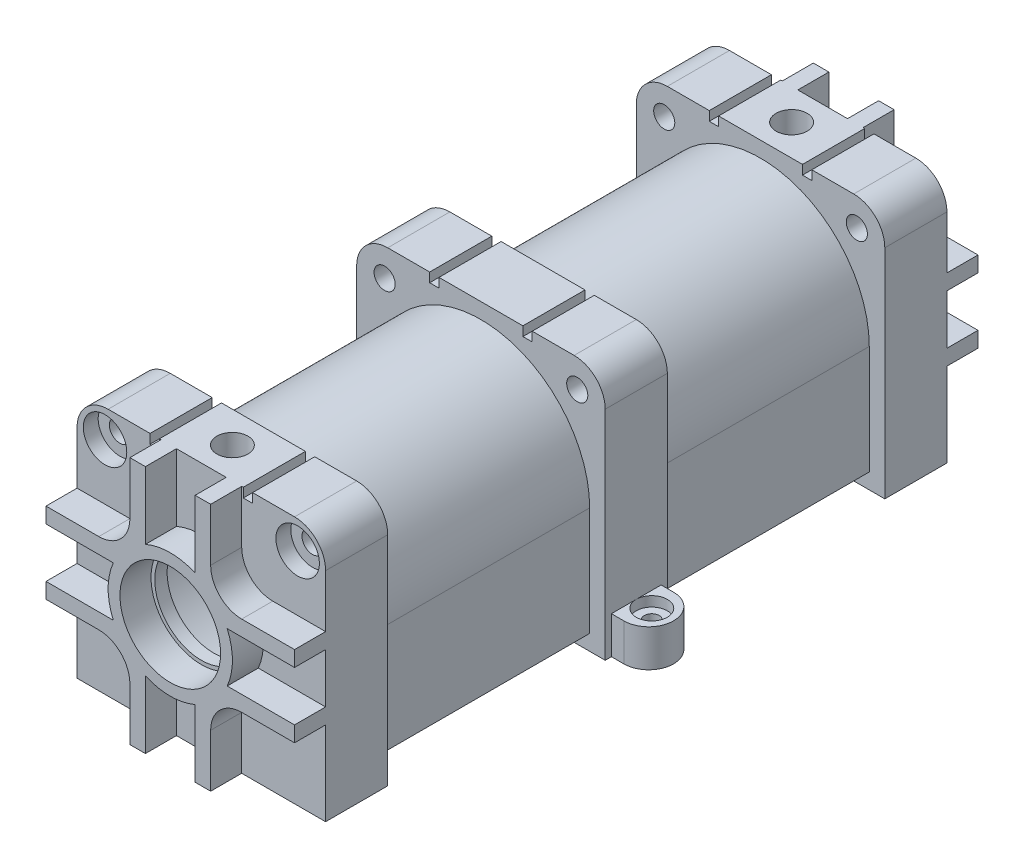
ISO-10303-21;
HEADER;
FILE_DESCRIPTION(('STEP AP214'),'2;1');
FILE_NAME('part.step','',(''),(''),'','','');
FILE_SCHEMA(('AUTOMOTIVE_DESIGN { 1 0 10303 214 1 1 1 1 }'));
ENDSEC;
DATA;
#1=APPLICATION_CONTEXT('core data for automotive mechanical design processes');
#2=APPLICATION_PROTOCOL_DEFINITION('international standard','automotive_design',2000,#1);
#3=PRODUCT_CONTEXT('',#1,'mechanical');
#4=PRODUCT('Part','Part','',(#3));
#5=PRODUCT_RELATED_PRODUCT_CATEGORY('part','',(#4));
#6=PRODUCT_DEFINITION_FORMATION('','',#4);
#7=PRODUCT_DEFINITION_CONTEXT('part definition',#1,'design');
#8=PRODUCT_DEFINITION('design','',#6,#7);
#9=PRODUCT_DEFINITION_SHAPE('','',#8);
#10=(LENGTH_UNIT() NAMED_UNIT(*) SI_UNIT(.MILLI.,.METRE.));
#11=(NAMED_UNIT(*) PLANE_ANGLE_UNIT() SI_UNIT($,.RADIAN.));
#12=(NAMED_UNIT(*) SI_UNIT($,.STERADIAN.) SOLID_ANGLE_UNIT());
#13=UNCERTAINTY_MEASURE_WITH_UNIT(LENGTH_MEASURE(1.E-05),#10,'distance_accuracy_value','');
#14=(GEOMETRIC_REPRESENTATION_CONTEXT(3) GLOBAL_UNCERTAINTY_ASSIGNED_CONTEXT((#13)) GLOBAL_UNIT_ASSIGNED_CONTEXT((#10,
#11,#12)) REPRESENTATION_CONTEXT('',''));
#15=CARTESIAN_POINT('',(0.,0.,0.));
#16=DIRECTION('',(0.,0.,1.));
#17=DIRECTION('',(1.,0.,0.));
#18=AXIS2_PLACEMENT_3D('',#15,#16,#17);
#19=CARTESIAN_POINT('',(20.,20.,50.));
#20=DIRECTION('',(0.,0.,-1.));
#21=DIRECTION('',(-1.,0.,0.));
#22=AXIS2_PLACEMENT_3D('',#19,#20,#21);
#23=PLANE('',#22);
#24=CARTESIAN_POINT('',(-15.5,15.5,50.));
#25=DIRECTION('',(0.,0.,1.));
#26=DIRECTION('',(1.,0.,0.));
#27=AXIS2_PLACEMENT_3D('',#24,#25,#26);
#28=CIRCLE('',#27,3.5);
#29=CARTESIAN_POINT('',(-12.,15.5,50.));
#30=VERTEX_POINT('',#29);
#31=EDGE_CURVE('E1407',#30,#30,#28,.T.);
#32=ORIENTED_EDGE('',*,*,#31,.F.);
#33=EDGE_LOOP('',(#32));
#34=FACE_BOUND('',#33,.T.);
#35=CARTESIAN_POINT('',(-11.5,11.5,50.));
#36=DIRECTION('',(0.,0.,1.));
#37=DIRECTION('',(-1.,0.,0.));
#38=AXIS2_PLACEMENT_3D('',#35,#36,#37);
#39=CIRCLE('',#38,5.);
#40=CARTESIAN_POINT('',(-11.5,6.5,50.));
#41=VERTEX_POINT('',#40);
#42=CARTESIAN_POINT('',(-6.50000000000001,11.5,50.));
#43=VERTEX_POINT('',#42);
#44=EDGE_CURVE('E52',#41,#43,#39,.T.);
#45=ORIENTED_EDGE('',*,*,#44,.T.);
#46=DIRECTION('',(0.,1.,0.));
#47=VECTOR('',#46,1.);
#48=CARTESIAN_POINT('',(-6.50000000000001,20.,50.));
#49=LINE('',#48,#47);
#50=CARTESIAN_POINT('',(-6.50000000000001,20.,50.));
#51=VERTEX_POINT('',#50);
#52=EDGE_CURVE('E910',#43,#51,#49,.T.);
#53=ORIENTED_EDGE('',*,*,#52,.T.);
#54=DIRECTION('',(1.,0.,0.));
#55=VECTOR('',#54,1.);
#56=CARTESIAN_POINT('',(20.,20.,50.));
#57=LINE('',#56,#55);
#58=CARTESIAN_POINT('',(-6.74999999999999,20.,50.));
#59=VERTEX_POINT('',#58);
#60=EDGE_CURVE('E800',#59,#51,#57,.T.);
#61=ORIENTED_EDGE('',*,*,#60,.F.);
#62=DIRECTION('',(0.,-1.,0.));
#63=VECTOR('',#62,1.);
#64=CARTESIAN_POINT('',(-6.74999999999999,21.5,50.));
#65=LINE('',#64,#63);
#66=CARTESIAN_POINT('',(-6.74999999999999,18.5,50.));
#67=VERTEX_POINT('',#66);
#68=EDGE_CURVE('E1260',#59,#67,#65,.T.);
#69=ORIENTED_EDGE('',*,*,#68,.T.);
#70=DIRECTION('',(-1.,0.,0.));
#71=VECTOR('',#70,1.);
#72=CARTESIAN_POINT('',(-8.24999999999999,18.5,50.));
#73=LINE('',#72,#71);
#74=CARTESIAN_POINT('',(-8.24999999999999,18.5,50.));
#75=VERTEX_POINT('',#74);
#76=EDGE_CURVE('E1263',#67,#75,#73,.T.);
#77=ORIENTED_EDGE('',*,*,#76,.T.);
#78=DIRECTION('',(0.,1.,0.));
#79=VECTOR('',#78,1.);
#80=CARTESIAN_POINT('',(-8.24999999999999,21.5,50.));
#81=LINE('',#80,#79);
#82=CARTESIAN_POINT('',(-8.24999999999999,20.,50.));
#83=VERTEX_POINT('',#82);
#84=EDGE_CURVE('E1267',#75,#83,#81,.T.);
#85=ORIENTED_EDGE('',*,*,#84,.T.);
#86=CARTESIAN_POINT('',(-15.,20.,50.));
#87=VERTEX_POINT('',#86);
#88=EDGE_CURVE('E1646',#87,#83,#57,.T.);
#89=ORIENTED_EDGE('',*,*,#88,.F.);
#90=CARTESIAN_POINT('',(-15.,15.,50.));
#91=DIRECTION('',(0.,0.,-1.));
#92=DIRECTION('',(-1.,0.,0.));
#93=AXIS2_PLACEMENT_3D('',#90,#91,#92);
#94=CIRCLE('',#93,5.);
#95=CARTESIAN_POINT('',(-20.,15.,50.));
#96=VERTEX_POINT('',#95);
#97=EDGE_CURVE('E1713',#87,#96,#94,.F.);
#98=ORIENTED_EDGE('',*,*,#97,.T.);
#99=DIRECTION('',(0.,-1.,0.));
#100=VECTOR('',#99,1.);
#101=CARTESIAN_POINT('',(-20.,20.,50.));
#102=LINE('',#101,#100);
#103=CARTESIAN_POINT('',(-20.,6.5,50.));
#104=VERTEX_POINT('',#103);
#105=EDGE_CURVE('E1693',#96,#104,#102,.T.);
#106=ORIENTED_EDGE('',*,*,#105,.T.);
#107=DIRECTION('',(1.,0.,0.));
#108=VECTOR('',#107,1.);
#109=CARTESIAN_POINT('',(-11.5,6.49999999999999,50.));
#110=LINE('',#109,#108);
#111=EDGE_CURVE('E57',#104,#41,#110,.T.);
#112=ORIENTED_EDGE('',*,*,#111,.T.);
#113=EDGE_LOOP('',(#45,#53,#61,#69,#77,#85,#89,#98,#106,#112));
#114=FACE_BOUND('',#113,.T.);
#115=ADVANCED_FACE('F37',(#34,#114),#23,.F.);
#116=CARTESIAN_POINT('',(0.,0.,50.));
#117=DIRECTION('',(0.,0.,-1.));
#118=DIRECTION('',(-1.,0.,0.));
#119=AXIS2_PLACEMENT_3D('',#116,#117,#118);
#120=CIRCLE('',#119,10.);
#121=CARTESIAN_POINT('',(-9.16515138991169,-3.99999999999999,50.));
#122=VERTEX_POINT('',#121);
#123=CARTESIAN_POINT('',(-9.16515138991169,3.99999999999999,50.));
#124=VERTEX_POINT('',#123);
#125=EDGE_CURVE('E917',#122,#124,#120,.T.);
#126=ORIENTED_EDGE('',*,*,#125,.T.);
#127=DIRECTION('',(-1.,0.,0.));
#128=VECTOR('',#127,1.);
#129=CARTESIAN_POINT('',(-9.16515138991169,3.99999999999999,50.));
#130=LINE('',#129,#128);
#131=CARTESIAN_POINT('',(-20.,4.,50.));
#132=VERTEX_POINT('',#131);
#133=EDGE_CURVE('E915',#124,#132,#130,.T.);
#134=ORIENTED_EDGE('',*,*,#133,.T.);
#135=CARTESIAN_POINT('',(-20.,-4.,50.));
#136=VERTEX_POINT('',#135);
#137=EDGE_CURVE('E1696',#132,#136,#102,.T.);
#138=ORIENTED_EDGE('',*,*,#137,.T.);
#139=DIRECTION('',(1.,0.,0.));
#140=VECTOR('',#139,1.);
#141=CARTESIAN_POINT('',(-9.16515138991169,-3.99999999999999,50.));
#142=LINE('',#141,#140);
#143=EDGE_CURVE('E919',#136,#122,#142,.T.);
#144=ORIENTED_EDGE('',*,*,#143,.T.);
#145=EDGE_LOOP('',(#126,#134,#138,#144));
#146=FACE_BOUND('',#145,.T.);
#147=ADVANCED_FACE('F2001',(#146),#23,.F.);
#148=CARTESIAN_POINT('',(-11.5,-11.5,50.));
#149=DIRECTION('',(0.,0.,1.));
#150=DIRECTION('',(1.,0.,0.));
#151=AXIS2_PLACEMENT_3D('',#148,#149,#150);
#152=CIRCLE('',#151,5.);
#153=CARTESIAN_POINT('',(-6.50000000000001,-11.5,50.));
#154=VERTEX_POINT('',#153);
#155=CARTESIAN_POINT('',(-11.5,-6.49999999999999,50.));
#156=VERTEX_POINT('',#155);
#157=EDGE_CURVE('E924',#154,#156,#152,.T.);
#158=ORIENTED_EDGE('',*,*,#157,.T.);
#159=DIRECTION('',(-1.,0.,0.));
#160=VECTOR('',#159,1.);
#161=CARTESIAN_POINT('',(-11.5,-6.49999999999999,50.));
#162=LINE('',#161,#160);
#163=CARTESIAN_POINT('',(-20.,-6.5,50.));
#164=VERTEX_POINT('',#163);
#165=EDGE_CURVE('E921',#156,#164,#162,.T.);
#166=ORIENTED_EDGE('',*,*,#165,.T.);
#167=CARTESIAN_POINT('',(-20.,-20.,50.));
#168=VERTEX_POINT('',#167);
#169=EDGE_CURVE('E1691',#164,#168,#102,.T.);
#170=ORIENTED_EDGE('',*,*,#169,.T.);
#171=DIRECTION('',(1.,0.,0.));
#172=VECTOR('',#171,1.);
#173=CARTESIAN_POINT('',(20.,-20.,50.));
#174=LINE('',#173,#172);
#175=CARTESIAN_POINT('',(-6.50000000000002,-20.,50.));
#176=VERTEX_POINT('',#175);
#177=EDGE_CURVE('E1663',#168,#176,#174,.T.);
#178=ORIENTED_EDGE('',*,*,#177,.T.);
#179=DIRECTION('',(0.,1.,0.));
#180=VECTOR('',#179,1.);
#181=CARTESIAN_POINT('',(-6.50000000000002,-20.,50.));
#182=LINE('',#181,#180);
#183=EDGE_CURVE('E926',#176,#154,#182,.T.);
#184=ORIENTED_EDGE('',*,*,#183,.T.);
#185=EDGE_LOOP('',(#158,#166,#170,#178,#184));
#186=FACE_BOUND('',#185,.T.);
#187=ADVANCED_FACE('F2009',(#186),#23,.F.);
#188=CARTESIAN_POINT('',(0.,0.,50.));
#189=DIRECTION('',(0.,0.,-1.));
#190=DIRECTION('',(-1.,0.,0.));
#191=AXIS2_PLACEMENT_3D('',#188,#189,#190);
#192=CIRCLE('',#191,9.99999999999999);
#193=CARTESIAN_POINT('',(3.99999999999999,-9.16515138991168,50.));
#194=VERTEX_POINT('',#193);
#195=CARTESIAN_POINT('',(-4.00000000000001,-9.16515138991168,50.));
#196=VERTEX_POINT('',#195);
#197=EDGE_CURVE('E930',#194,#196,#192,.T.);
#198=ORIENTED_EDGE('',*,*,#197,.T.);
#199=DIRECTION('',(0.,-1.,0.));
#200=VECTOR('',#199,1.);
#201=CARTESIAN_POINT('',(-4.00000000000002,-20.,50.));
#202=LINE('',#201,#200);
#203=CARTESIAN_POINT('',(-4.00000000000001,-20.,50.));
#204=VERTEX_POINT('',#203);
#205=EDGE_CURVE('E928',#196,#204,#202,.T.);
#206=ORIENTED_EDGE('',*,*,#205,.T.);
#207=CARTESIAN_POINT('',(3.99999999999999,-20.,50.));
#208=VERTEX_POINT('',#207);
#209=EDGE_CURVE('E1666',#204,#208,#174,.T.);
#210=ORIENTED_EDGE('',*,*,#209,.T.);
#211=DIRECTION('',(0.,1.,0.));
#212=VECTOR('',#211,1.);
#213=CARTESIAN_POINT('',(3.99999999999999,-20.,50.));
#214=LINE('',#213,#212);
#215=EDGE_CURVE('E932',#208,#194,#214,.T.);
#216=ORIENTED_EDGE('',*,*,#215,.T.);
#217=EDGE_LOOP('',(#198,#206,#210,#216));
#218=FACE_BOUND('',#217,.T.);
#219=ADVANCED_FACE('F3250',(#218),#23,.F.);
#220=CARTESIAN_POINT('',(11.5,-11.5,50.));
#221=DIRECTION('',(0.,0.,1.));
#222=DIRECTION('',(-1.,0.,0.));
#223=AXIS2_PLACEMENT_3D('',#220,#221,#222);
#224=CIRCLE('',#223,5.);
#225=CARTESIAN_POINT('',(11.5,-6.5,50.));
#226=VERTEX_POINT('',#225);
#227=CARTESIAN_POINT('',(6.49999999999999,-11.5,50.));
#228=VERTEX_POINT('',#227);
#229=EDGE_CURVE('E936',#226,#228,#224,.T.);
#230=ORIENTED_EDGE('',*,*,#229,.T.);
#231=DIRECTION('',(0.,-1.,0.));
#232=VECTOR('',#231,1.);
#233=CARTESIAN_POINT('',(6.49999999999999,-20.,50.));
#234=LINE('',#233,#232);
#235=CARTESIAN_POINT('',(6.49999999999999,-20.,50.));
#236=VERTEX_POINT('',#235);
#237=EDGE_CURVE('E934',#228,#236,#234,.T.);
#238=ORIENTED_EDGE('',*,*,#237,.T.);
#239=CARTESIAN_POINT('',(20.,-20.,50.));
#240=VERTEX_POINT('',#239);
#241=EDGE_CURVE('E1660',#236,#240,#174,.T.);
#242=ORIENTED_EDGE('',*,*,#241,.T.);
#243=DIRECTION('',(0.,-1.,0.));
#244=VECTOR('',#243,1.);
#245=CARTESIAN_POINT('',(20.,20.,50.));
#246=LINE('',#245,#244);
#247=CARTESIAN_POINT('',(20.,-6.50000000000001,50.));
#248=VERTEX_POINT('',#247);
#249=EDGE_CURVE('E1686',#248,#240,#246,.T.);
#250=ORIENTED_EDGE('',*,*,#249,.F.);
#251=DIRECTION('',(-1.,0.,0.));
#252=VECTOR('',#251,1.);
#253=CARTESIAN_POINT('',(11.5,-6.5,50.));
#254=LINE('',#253,#252);
#255=EDGE_CURVE('E938',#248,#226,#254,.T.);
#256=ORIENTED_EDGE('',*,*,#255,.T.);
#257=EDGE_LOOP('',(#230,#238,#242,#250,#256));
#258=FACE_BOUND('',#257,.T.);
#259=ADVANCED_FACE('F2041',(#258),#23,.F.);
#260=CARTESIAN_POINT('',(0.,0.,50.));
#261=DIRECTION('',(0.,0.,-1.));
#262=DIRECTION('',(-1.,0.,0.));
#263=AXIS2_PLACEMENT_3D('',#260,#261,#262);
#264=CIRCLE('',#263,10.);
#265=CARTESIAN_POINT('',(9.16515138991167,4.,50.));
#266=VERTEX_POINT('',#265);
#267=CARTESIAN_POINT('',(9.16515138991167,-4.,50.));
#268=VERTEX_POINT('',#267);
#269=EDGE_CURVE('E942',#266,#268,#264,.T.);
#270=ORIENTED_EDGE('',*,*,#269,.T.);
#271=DIRECTION('',(1.,0.,0.));
#272=VECTOR('',#271,1.);
#273=CARTESIAN_POINT('',(9.16515138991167,-4.,50.));
#274=LINE('',#273,#272);
#275=CARTESIAN_POINT('',(20.,-4.,50.));
#276=VERTEX_POINT('',#275);
#277=EDGE_CURVE('E940',#268,#276,#274,.T.);
#278=ORIENTED_EDGE('',*,*,#277,.T.);
#279=CARTESIAN_POINT('',(20.,3.99999999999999,50.));
#280=VERTEX_POINT('',#279);
#281=EDGE_CURVE('E1692',#280,#276,#246,.T.);
#282=ORIENTED_EDGE('',*,*,#281,.F.);
#283=DIRECTION('',(-1.,0.,0.));
#284=VECTOR('',#283,1.);
#285=CARTESIAN_POINT('',(9.16515138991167,4.,50.));
#286=LINE('',#285,#284);
#287=EDGE_CURVE('E944',#280,#266,#286,.T.);
#288=ORIENTED_EDGE('',*,*,#287,.T.);
#289=EDGE_LOOP('',(#270,#278,#282,#288));
#290=FACE_BOUND('',#289,.T.);
#291=ADVANCED_FACE('F2032',(#290),#23,.F.);
#292=CARTESIAN_POINT('',(15.5,15.5,50.));
#293=DIRECTION('',(0.,0.,1.));
#294=DIRECTION('',(1.,0.,0.));
#295=AXIS2_PLACEMENT_3D('',#292,#293,#294);
#296=CIRCLE('',#295,3.49999999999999);
#297=CARTESIAN_POINT('',(19.,15.5,50.));
#298=VERTEX_POINT('',#297);
#299=EDGE_CURVE('E1426',#298,#298,#296,.T.);
#300=ORIENTED_EDGE('',*,*,#299,.F.);
#301=EDGE_LOOP('',(#300));
#302=FACE_BOUND('',#301,.T.);
#303=CARTESIAN_POINT('',(11.5,11.5,50.));
#304=DIRECTION('',(0.,0.,1.));
#305=DIRECTION('',(1.,0.,0.));
#306=AXIS2_PLACEMENT_3D('',#303,#304,#305);
#307=CIRCLE('',#306,5.);
#308=CARTESIAN_POINT('',(6.5,11.5,50.));
#309=VERTEX_POINT('',#308);
#310=CARTESIAN_POINT('',(11.5,6.5,50.));
#311=VERTEX_POINT('',#310);
#312=EDGE_CURVE('E948',#309,#311,#307,.T.);
#313=ORIENTED_EDGE('',*,*,#312,.T.);
#314=DIRECTION('',(1.,0.,0.));
#315=VECTOR('',#314,1.);
#316=CARTESIAN_POINT('',(11.5,6.5,50.));
#317=LINE('',#316,#315);
#318=CARTESIAN_POINT('',(20.,6.5,50.));
#319=VERTEX_POINT('',#318);
#320=EDGE_CURVE('E946',#311,#319,#317,.T.);
#321=ORIENTED_EDGE('',*,*,#320,.T.);
#322=CARTESIAN_POINT('',(20.,15.,50.));
#323=VERTEX_POINT('',#322);
#324=EDGE_CURVE('E1688',#323,#319,#246,.T.);
#325=ORIENTED_EDGE('',*,*,#324,.F.);
#326=CARTESIAN_POINT('',(15.,15.,50.));
#327=DIRECTION('',(0.,0.,-1.));
#328=DIRECTION('',(-1.,0.,0.));
#329=AXIS2_PLACEMENT_3D('',#326,#327,#328);
#330=CIRCLE('',#329,5.);
#331=CARTESIAN_POINT('',(15.,20.,50.));
#332=VERTEX_POINT('',#331);
#333=EDGE_CURVE('E1715',#323,#332,#330,.F.);
#334=ORIENTED_EDGE('',*,*,#333,.T.);
#335=CARTESIAN_POINT('',(8.25000000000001,20.,50.));
#336=VERTEX_POINT('',#335);
#337=EDGE_CURVE('E1676',#336,#332,#57,.T.);
#338=ORIENTED_EDGE('',*,*,#337,.F.);
#339=DIRECTION('',(0.,-1.,0.));
#340=VECTOR('',#339,1.);
#341=CARTESIAN_POINT('',(8.25000000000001,21.5,50.));
#342=LINE('',#341,#340);
#343=CARTESIAN_POINT('',(8.25000000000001,18.5,50.));
#344=VERTEX_POINT('',#343);
#345=EDGE_CURVE('E1289',#336,#344,#342,.T.);
#346=ORIENTED_EDGE('',*,*,#345,.T.);
#347=DIRECTION('',(-1.,0.,0.));
#348=VECTOR('',#347,1.);
#349=CARTESIAN_POINT('',(6.75000000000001,18.5,50.));
#350=LINE('',#349,#348);
#351=CARTESIAN_POINT('',(6.75000000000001,18.5,50.));
#352=VERTEX_POINT('',#351);
#353=EDGE_CURVE('E1292',#344,#352,#350,.T.);
#354=ORIENTED_EDGE('',*,*,#353,.T.);
#355=DIRECTION('',(0.,1.,0.));
#356=VECTOR('',#355,1.);
#357=CARTESIAN_POINT('',(6.75000000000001,21.5,50.));
#358=LINE('',#357,#356);
#359=CARTESIAN_POINT('',(6.75000000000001,20.,50.));
#360=VERTEX_POINT('',#359);
#361=EDGE_CURVE('E1296',#352,#360,#358,.T.);
#362=ORIENTED_EDGE('',*,*,#361,.T.);
#363=CARTESIAN_POINT('',(6.5,20.,50.));
#364=VERTEX_POINT('',#363);
#365=EDGE_CURVE('E1650',#364,#360,#57,.T.);
#366=ORIENTED_EDGE('',*,*,#365,.F.);
#367=DIRECTION('',(0.,-1.,0.));
#368=VECTOR('',#367,1.);
#369=CARTESIAN_POINT('',(6.5,20.,50.));
#370=LINE('',#369,#368);
#371=EDGE_CURVE('E950',#364,#309,#370,.T.);
#372=ORIENTED_EDGE('',*,*,#371,.T.);
#373=EDGE_LOOP('',(#313,#321,#325,#334,#338,#346,#354,#362,#366,#372));
#374=FACE_BOUND('',#373,.T.);
#375=ADVANCED_FACE('F2018',(#302,#374),#23,.F.);
#376=CARTESIAN_POINT('',(0.,0.,-40.));
#377=DIRECTION('',(0.,0.,1.));
#378=DIRECTION('',(1.,0.,0.));
#379=AXIS2_PLACEMENT_3D('',#376,#377,#378);
#380=CYLINDRICAL_SURFACE('',#379,16.);
#381=CARTESIAN_POINT('',(0.,0.,-40.));
#382=DIRECTION('',(0.,0.,1.));
#383=DIRECTION('',(1.,0.,0.));
#384=AXIS2_PLACEMENT_3D('',#381,#382,#383);
#385=CIRCLE('',#384,16.);
#386=CARTESIAN_POINT('',(16.,0.,-40.));
#387=VERTEX_POINT('',#386);
#388=EDGE_CURVE('E1630',#387,#387,#385,.T.);
#389=ORIENTED_EDGE('',*,*,#388,.F.);
#390=EDGE_LOOP('',(#389));
#391=FACE_BOUND('',#390,.T.);
#392=CARTESIAN_POINT('',(0.,16.,47.5005939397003));
#393=CARTESIAN_POINT('',(0.139547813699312,15.9999977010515,47.5005882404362));
#394=CARTESIAN_POINT('',(0.279174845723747,15.9981552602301,47.4888731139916));
#395=CARTESIAN_POINT('',(0.554521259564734,15.9909827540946,47.4423367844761));
#396=CARTESIAN_POINT('',(0.690236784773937,15.9856493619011,47.4074935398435));
#397=CARTESIAN_POINT('',(0.953735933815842,15.9720938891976,47.3157716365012));
#398=CARTESIAN_POINT('',(1.08152564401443,15.9638740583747,47.2589101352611));
#399=CARTESIAN_POINT('',(1.32573171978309,15.9454523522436,47.1248088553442));
#400=CARTESIAN_POINT('',(1.44214955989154,15.9352507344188,47.0475717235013));
#401=CARTESIAN_POINT('',(1.66130950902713,15.9139022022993,46.8742165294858));
#402=CARTESIAN_POINT('',(1.76394156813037,15.9027487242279,46.7779601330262));
#403=CARTESIAN_POINT('',(1.95166669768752,15.8808044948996,46.5695965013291));
#404=CARTESIAN_POINT('',(2.03675872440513,15.8700137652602,46.4574883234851));
#405=CARTESIAN_POINT('',(2.18742142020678,15.8499531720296,46.2198579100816));
#406=CARTESIAN_POINT('',(2.25288474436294,15.840691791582,46.0942668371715));
#407=CARTESIAN_POINT('',(2.36174561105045,15.8248286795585,45.8337027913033));
#408=CARTESIAN_POINT('',(2.40514446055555,15.8182267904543,45.698730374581));
#409=CARTESIAN_POINT('',(2.4683008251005,15.808494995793,45.4243958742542));
#410=CARTESIAN_POINT('',(2.4882473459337,15.8053373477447,45.285078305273));
#411=CARTESIAN_POINT('',(2.50451854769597,15.8027674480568,45.0050405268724));
#412=CARTESIAN_POINT('',(2.50084469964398,15.8033549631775,44.8643204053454));
#413=CARTESIAN_POINT('',(2.47013372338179,15.8081836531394,44.5868123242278));
#414=CARTESIAN_POINT('',(2.44330776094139,15.8123918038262,44.4500003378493));
#415=CARTESIAN_POINT('',(2.36738490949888,15.8239359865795,44.1828434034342));
#416=CARTESIAN_POINT('',(2.31828734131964,15.8312721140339,44.0524986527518));
#417=CARTESIAN_POINT('',(2.19899738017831,15.848281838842,43.8013374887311));
#418=CARTESIAN_POINT('',(2.12871618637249,15.8579652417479,43.6805639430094));
#419=CARTESIAN_POINT('',(1.96911716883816,15.8785714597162,43.452444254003));
#420=CARTESIAN_POINT('',(1.87979799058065,15.8894943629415,43.3450990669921));
#421=CARTESIAN_POINT('',(1.68350246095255,15.9114944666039,43.1456599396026));
#422=CARTESIAN_POINT('',(1.57634469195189,15.9225720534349,43.053744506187));
#423=CARTESIAN_POINT('',(1.34803037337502,15.9435232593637,42.8891739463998));
#424=CARTESIAN_POINT('',(1.22687375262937,15.95339687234,42.8165189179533));
#425=CARTESIAN_POINT('',(0.973841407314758,15.9708392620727,42.6925198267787));
#426=CARTESIAN_POINT('',(0.841958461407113,15.9784064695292,42.6411902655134));
#427=CARTESIAN_POINT('',(0.571299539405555,15.9903705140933,42.5614581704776));
#428=CARTESIAN_POINT('',(0.432524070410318,15.994767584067,42.5330539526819));
#429=CARTESIAN_POINT('',(0.153559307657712,15.9998649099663,42.5002178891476));
#430=CARTESIAN_POINT('',(0.0133995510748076,16.0006029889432,42.4955407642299));
#431=CARTESIAN_POINT('',(-0.265702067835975,15.9984023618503,42.5096395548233));
#432=CARTESIAN_POINT('',(-0.404643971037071,15.9954637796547,42.5284146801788));
#433=CARTESIAN_POINT('',(-0.67661751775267,15.9862634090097,42.5886810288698));
#434=CARTESIAN_POINT('',(-0.809676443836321,15.980019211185,42.6300520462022));
#435=CARTESIAN_POINT('',(-1.06696958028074,15.9649052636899,42.7342085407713));
#436=CARTESIAN_POINT('',(-1.19120334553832,15.9560353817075,42.7969950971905));
#437=CARTESIAN_POINT('',(-1.42839338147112,15.9365611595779,42.9427708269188));
#438=CARTESIAN_POINT('',(-1.54125346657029,15.9259437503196,43.0259147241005));
#439=CARTESIAN_POINT('',(-1.75150621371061,15.9041950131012,43.2098305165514));
#440=CARTESIAN_POINT('',(-1.84889789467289,15.8930636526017,43.3106035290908));
#441=CARTESIAN_POINT('',(-2.02634785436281,15.8714207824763,43.5280119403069));
#442=CARTESIAN_POINT('',(-2.10624122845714,15.8609157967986,43.6447826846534));
#443=CARTESIAN_POINT('',(-2.24527847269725,15.8418329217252,43.8902312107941));
#444=CARTESIAN_POINT('',(-2.30442294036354,15.8332549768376,44.0189086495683));
#445=CARTESIAN_POINT('',(-2.40003114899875,15.8190452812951,44.2840373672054));
#446=CARTESIAN_POINT('',(-2.43657994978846,15.8134024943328,44.4204573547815));
#447=CARTESIAN_POINT('',(-2.48622899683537,15.80567326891,44.6975946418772));
#448=CARTESIAN_POINT('',(-2.49933101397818,15.8035865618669,44.838311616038));
#449=CARTESIAN_POINT('',(-2.50166978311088,15.8032163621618,45.1184037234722));
#450=CARTESIAN_POINT('',(-2.49116591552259,15.8048915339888,45.2577767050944));
#451=CARTESIAN_POINT('',(-2.44714875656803,15.811766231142,45.5327474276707));
#452=CARTESIAN_POINT('',(-2.41363551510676,15.8169657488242,45.6683451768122));
#453=CARTESIAN_POINT('',(-2.32464547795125,15.8302883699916,45.9318340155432));
#454=CARTESIAN_POINT('',(-2.26918835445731,15.8384088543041,46.0597318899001));
#455=CARTESIAN_POINT('',(-2.1379108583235,15.8566613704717,46.3044501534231));
#456=CARTESIAN_POINT('',(-2.06208967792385,15.8667934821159,46.4212701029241));
#457=CARTESIAN_POINT('',(-1.89130002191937,15.8880598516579,46.6418316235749));
#458=CARTESIAN_POINT('',(-1.79613988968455,15.8992034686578,46.7454239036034));
#459=CARTESIAN_POINT('',(-1.58977854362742,15.9211603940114,46.9352603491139));
#460=CARTESIAN_POINT('',(-1.47857361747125,15.9319736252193,47.021500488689));
#461=CARTESIAN_POINT('',(-1.24249029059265,15.9521260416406,47.1746515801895));
#462=CARTESIAN_POINT('',(-1.11753377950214,15.9614559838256,47.2414433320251));
#463=CARTESIAN_POINT('',(-0.858085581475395,15.977500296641,47.352988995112));
#464=CARTESIAN_POINT('',(-0.723603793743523,15.9842173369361,47.3977654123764));
#465=CARTESIAN_POINT('',(-0.490456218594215,15.9927702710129,47.4540110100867));
#466=CARTESIAN_POINT('',(-0.393219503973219,15.9954672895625,47.4714524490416));
#467=CARTESIAN_POINT('',(-0.197335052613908,15.9990829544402,47.4947458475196));
#468=CARTESIAN_POINT('',(-0.0986873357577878,16.0000016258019,47.5005979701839));
#469=CARTESIAN_POINT('',(0.,16.,47.5005939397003));
#470=B_SPLINE_CURVE_WITH_KNOTS('',3,(#392,#393,#394,#395,#396,#397,#398,#399,#400,#401,#402,
#403,#404,#405,#406,#407,#408,#409,#410,#411,#412,#413,#414,#415,#416,#417,#418,#419,#420,#421,
#422,#423,#424,#425,#426,#427,#428,#429,#430,#431,#432,#433,#434,#435,#436,#437,#438,#439,#440,
#441,#442,#443,#444,#445,#446,#447,#448,#449,#450,#451,#452,#453,#454,#455,#456,#457,#458,#459,
#460,#461,#462,#463,#464,#465,#466,#467,#468,#469),.UNSPECIFIED.,.T.,.F.,(4,2,2,2,2,2,2,2,2,2,2,
2,2,2,2,2,2,2,2,2,2,2,2,2,2,2,2,2,2,2,2,2,2,2,2,2,2,2,4),(0.,0.418282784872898,
0.836964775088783,1.25532116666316,1.67362323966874,2.09508788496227,2.51657760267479,
2.94033198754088,3.36406126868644,3.78435172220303,4.20461600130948,4.62108716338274,
5.03757102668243,5.45582564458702,5.8741100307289,6.29694217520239,6.71977646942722,
7.14289782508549,7.56598809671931,7.9846956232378,8.40338904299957,8.81987648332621,
9.23638491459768,9.65616298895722,10.0759676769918,10.4995729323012,10.9231659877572,
11.3451545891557,11.7671113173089,12.1844542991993,12.6017963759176,13.0187651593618,
13.4357504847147,13.857089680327,14.2785265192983,14.7024944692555,15.1260280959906,
15.4218392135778,15.7176461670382),.UNSPECIFIED.);
#471=CARTESIAN_POINT('',(0.,16.,47.5005939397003));
#472=VERTEX_POINT('',#471);
#473=EDGE_CURVE('E1254',#472,#472,#470,.T.);
#474=ORIENTED_EDGE('',*,*,#473,.T.);
#475=EDGE_LOOP('',(#474));
#476=FACE_BOUND('',#475,.T.);
#477=CARTESIAN_POINT('',(0.,0.,48.));
#478=DIRECTION('',(0.,0.,1.));
#479=DIRECTION('',(1.,0.,0.));
#480=AXIS2_PLACEMENT_3D('',#477,#478,#479);
#481=CIRCLE('',#480,16.);
#482=CARTESIAN_POINT('',(16.,0.,48.));
#483=VERTEX_POINT('',#482);
#484=EDGE_CURVE('E11',#483,#483,#481,.F.);
#485=ORIENTED_EDGE('',*,*,#484,.F.);
#486=EDGE_LOOP('',(#485));
#487=FACE_BOUND('',#486,.T.);
#488=ADVANCED_FACE('F1781',(#391,#476,#487),#380,.F.);
#489=CARTESIAN_POINT('',(0.,0.,-55.));
#490=DIRECTION('',(0.,0.,1.));
#491=DIRECTION('',(1.,0.,0.));
#492=AXIS2_PLACEMENT_3D('',#489,#490,#491);
#493=CYLINDRICAL_SURFACE('',#492,10.);
#494=DIRECTION('',(0.,0.,1.));
#495=VECTOR('',#494,1.);
#496=CARTESIAN_POINT('',(-4.00000000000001,-9.16515138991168,-55.));
#497=LINE('',#496,#495);
#498=CARTESIAN_POINT('',(-4.00000000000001,-9.16515138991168,-55.));
#499=VERTEX_POINT('',#498);
#500=CARTESIAN_POINT('',(-4.00000000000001,-9.16515138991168,-50.));
#501=VERTEX_POINT('',#500);
#502=EDGE_CURVE('E1198',#499,#501,#497,.T.);
#503=ORIENTED_EDGE('',*,*,#502,.F.);
#504=CARTESIAN_POINT('',(0.,0.,-55.));
#505=DIRECTION('',(0.,0.,-1.));
#506=DIRECTION('',(-1.,0.,0.));
#507=AXIS2_PLACEMENT_3D('',#504,#505,#506);
#508=CIRCLE('',#507,10.);
#509=CARTESIAN_POINT('',(4.,-9.16515138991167,-55.));
#510=VERTEX_POINT('',#509);
#511=EDGE_CURVE('E45',#499,#510,#508,.F.);
#512=ORIENTED_EDGE('',*,*,#511,.T.);
#513=DIRECTION('',(0.,0.,1.));
#514=VECTOR('',#513,1.);
#515=CARTESIAN_POINT('',(4.,-9.16515138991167,-55.));
#516=LINE('',#515,#514);
#517=CARTESIAN_POINT('',(4.,-9.16515138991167,-50.));
#518=VERTEX_POINT('',#517);
#519=EDGE_CURVE('E1201',#510,#518,#516,.T.);
#520=ORIENTED_EDGE('',*,*,#519,.T.);
#521=CARTESIAN_POINT('',(0.,0.,-50.));
#522=DIRECTION('',(0.,0.,-1.));
#523=DIRECTION('',(-1.,0.,0.));
#524=AXIS2_PLACEMENT_3D('',#521,#522,#523);
#525=CIRCLE('',#524,9.99999999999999);
#526=EDGE_CURVE('E1142',#518,#501,#525,.T.);
#527=ORIENTED_EDGE('',*,*,#526,.T.);
#528=EDGE_LOOP('',(#503,#512,#520,#527));
#529=FACE_BOUND('',#528,.T.);
#530=ADVANCED_FACE('F2039',(#529),#493,.T.);
#531=DIRECTION('',(0.,0.,1.));
#532=VECTOR('',#531,1.);
#533=CARTESIAN_POINT('',(9.16515138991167,-4.,-55.));
#534=LINE('',#533,#532);
#535=CARTESIAN_POINT('',(9.16515138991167,-4.,-55.));
#536=VERTEX_POINT('',#535);
#537=CARTESIAN_POINT('',(9.16515138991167,-4.,-50.));
#538=VERTEX_POINT('',#537);
#539=EDGE_CURVE('E1220',#536,#538,#534,.T.);
#540=ORIENTED_EDGE('',*,*,#539,.F.);
#541=CARTESIAN_POINT('',(0.,0.,-55.));
#542=DIRECTION('',(0.,0.,-1.));
#543=DIRECTION('',(-1.,0.,0.));
#544=AXIS2_PLACEMENT_3D('',#541,#542,#543);
#545=CIRCLE('',#544,10.);
#546=CARTESIAN_POINT('',(9.16515138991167,4.,-55.));
#547=VERTEX_POINT('',#546);
#548=EDGE_CURVE('E2265',#536,#547,#545,.F.);
#549=ORIENTED_EDGE('',*,*,#548,.T.);
#550=DIRECTION('',(0.,0.,1.));
#551=VECTOR('',#550,1.);
#552=CARTESIAN_POINT('',(9.16515138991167,4.,-55.));
#553=LINE('',#552,#551);
#554=CARTESIAN_POINT('',(9.16515138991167,4.,-50.));
#555=VERTEX_POINT('',#554);
#556=EDGE_CURVE('E1223',#547,#555,#553,.T.);
#557=ORIENTED_EDGE('',*,*,#556,.T.);
#558=CARTESIAN_POINT('',(0.,0.,-50.));
#559=DIRECTION('',(0.,0.,-1.));
#560=DIRECTION('',(-1.,0.,0.));
#561=AXIS2_PLACEMENT_3D('',#558,#559,#560);
#562=CIRCLE('',#561,10.);
#563=EDGE_CURVE('E1130',#555,#538,#562,.T.);
#564=ORIENTED_EDGE('',*,*,#563,.T.);
#565=EDGE_LOOP('',(#540,#549,#557,#564));
#566=FACE_BOUND('',#565,.T.);
#567=ADVANCED_FACE('F2242',(#566),#493,.T.);
#568=DIRECTION('',(0.,0.,1.));
#569=VECTOR('',#568,1.);
#570=CARTESIAN_POINT('',(3.99999999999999,9.16515138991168,-55.));
#571=LINE('',#570,#569);
#572=CARTESIAN_POINT('',(3.99999999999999,9.16515138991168,-55.));
#573=VERTEX_POINT('',#572);
#574=CARTESIAN_POINT('',(3.99999999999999,9.16515138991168,-50.));
#575=VERTEX_POINT('',#574);
#576=EDGE_CURVE('E1242',#573,#575,#571,.T.);
#577=ORIENTED_EDGE('',*,*,#576,.F.);
#578=CARTESIAN_POINT('',(0.,0.,-55.));
#579=DIRECTION('',(0.,0.,-1.));
#580=DIRECTION('',(-1.,0.,0.));
#581=AXIS2_PLACEMENT_3D('',#578,#579,#580);
#582=CIRCLE('',#581,10.);
#583=CARTESIAN_POINT('',(-4.00000000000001,9.16515138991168,-55.));
#584=VERTEX_POINT('',#583);
#585=EDGE_CURVE('E2253',#573,#584,#582,.F.);
#586=ORIENTED_EDGE('',*,*,#585,.T.);
#587=DIRECTION('',(0.,0.,1.));
#588=VECTOR('',#587,1.);
#589=CARTESIAN_POINT('',(-4.00000000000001,9.16515138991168,-55.));
#590=LINE('',#589,#588);
#591=CARTESIAN_POINT('',(-4.00000000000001,9.16515138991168,-50.));
#592=VERTEX_POINT('',#591);
#593=EDGE_CURVE('E1245',#584,#592,#590,.T.);
#594=ORIENTED_EDGE('',*,*,#593,.T.);
#595=CARTESIAN_POINT('',(0.,0.,-50.));
#596=DIRECTION('',(0.,0.,-1.));
#597=DIRECTION('',(-1.,0.,0.));
#598=AXIS2_PLACEMENT_3D('',#595,#596,#597);
#599=CIRCLE('',#598,10.);
#600=EDGE_CURVE('E1118',#592,#575,#599,.T.);
#601=ORIENTED_EDGE('',*,*,#600,.T.);
#602=EDGE_LOOP('',(#577,#586,#594,#601));
#603=FACE_BOUND('',#602,.T.);
#604=ADVANCED_FACE('F2157',(#603),#493,.T.);
#605=CARTESIAN_POINT('',(0.,0.,-55.));
#606=DIRECTION('',(0.,0.,-1.));
#607=DIRECTION('',(-1.,0.,0.));
#608=AXIS2_PLACEMENT_3D('',#605,#606,#607);
#609=PLANE('',#608);
#610=DIRECTION('',(1.,0.,0.));
#611=VECTOR('',#610,1.);
#612=CARTESIAN_POINT('',(-9.16515138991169,-3.99999999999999,-55.));
#613=LINE('',#612,#611);
#614=CARTESIAN_POINT('',(-20.,-4.,-55.));
#615=VERTEX_POINT('',#614);
#616=CARTESIAN_POINT('',(-9.16515138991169,-4.,-55.));
#617=VERTEX_POINT('',#616);
#618=EDGE_CURVE('E1103',#615,#617,#613,.T.);
#619=ORIENTED_EDGE('',*,*,#618,.T.);
#620=CARTESIAN_POINT('',(0.,0.,-55.));
#621=DIRECTION('',(0.,0.,-1.));
#622=DIRECTION('',(-1.,0.,0.));
#623=AXIS2_PLACEMENT_3D('',#620,#621,#622);
#624=CIRCLE('',#623,10.);
#625=EDGE_CURVE('E1779',#617,#499,#624,.F.);
#626=ORIENTED_EDGE('',*,*,#625,.T.);
#627=DIRECTION('',(0.,-1.,0.));
#628=VECTOR('',#627,1.);
#629=CARTESIAN_POINT('',(-4.00000000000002,-20.,-55.));
#630=LINE('',#629,#628);
#631=CARTESIAN_POINT('',(-4.00000000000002,-20.,-55.));
#632=VERTEX_POINT('',#631);
#633=EDGE_CURVE('E1091',#499,#632,#630,.T.);
#634=ORIENTED_EDGE('',*,*,#633,.T.);
#635=DIRECTION('',(-1.,0.,0.));
#636=VECTOR('',#635,1.);
#637=CARTESIAN_POINT('',(-6.50000000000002,-20.,-55.));
#638=LINE('',#637,#636);
#639=CARTESIAN_POINT('',(-6.50000000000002,-20.,-55.));
#640=VERTEX_POINT('',#639);
#641=EDGE_CURVE('E1093',#632,#640,#638,.T.);
#642=ORIENTED_EDGE('',*,*,#641,.T.);
#643=DIRECTION('',(0.,1.,0.));
#644=VECTOR('',#643,1.);
#645=CARTESIAN_POINT('',(-6.50000000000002,-20.,-55.));
#646=LINE('',#645,#644);
#647=CARTESIAN_POINT('',(-6.50000000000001,-11.5,-55.));
#648=VERTEX_POINT('',#647);
#649=EDGE_CURVE('E1095',#640,#648,#646,.T.);
#650=ORIENTED_EDGE('',*,*,#649,.T.);
#651=CARTESIAN_POINT('',(-11.5,-11.5,-55.));
#652=DIRECTION('',(0.,0.,1.));
#653=DIRECTION('',(1.,0.,0.));
#654=AXIS2_PLACEMENT_3D('',#651,#652,#653);
#655=CIRCLE('',#654,5.);
#656=CARTESIAN_POINT('',(-11.5,-6.49999999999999,-55.));
#657=VERTEX_POINT('',#656);
#658=EDGE_CURVE('E1097',#648,#657,#655,.T.);
#659=ORIENTED_EDGE('',*,*,#658,.T.);
#660=DIRECTION('',(-1.,0.,0.));
#661=VECTOR('',#660,1.);
#662=CARTESIAN_POINT('',(-11.5,-6.49999999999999,-55.));
#663=LINE('',#662,#661);
#664=CARTESIAN_POINT('',(-20.,-6.5,-55.));
#665=VERTEX_POINT('',#664);
#666=EDGE_CURVE('E1099',#657,#665,#663,.T.);
#667=ORIENTED_EDGE('',*,*,#666,.T.);
#668=DIRECTION('',(0.,1.,0.));
#669=VECTOR('',#668,1.);
#670=CARTESIAN_POINT('',(-20.,-4.,-55.));
#671=LINE('',#670,#669);
#672=EDGE_CURVE('E1101',#665,#615,#671,.T.);
#673=ORIENTED_EDGE('',*,*,#672,.T.);
#674=EDGE_LOOP('',(#619,#626,#634,#642,#650,#659,#667,#673));
#675=FACE_BOUND('',#674,.T.);
#676=ADVANCED_FACE('F2153',(#675),#609,.T.);
#677=DIRECTION('',(0.,1.,0.));
#678=VECTOR('',#677,1.);
#679=CARTESIAN_POINT('',(3.99999999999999,-20.,-55.));
#680=LINE('',#679,#678);
#681=CARTESIAN_POINT('',(3.99999999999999,-20.,-55.));
#682=VERTEX_POINT('',#681);
#683=EDGE_CURVE('E1088',#682,#510,#680,.T.);
#684=ORIENTED_EDGE('',*,*,#683,.T.);
#685=EDGE_CURVE('E2280',#510,#536,#624,.F.);
#686=ORIENTED_EDGE('',*,*,#685,.T.);
#687=DIRECTION('',(1.,0.,0.));
#688=VECTOR('',#687,1.);
#689=CARTESIAN_POINT('',(9.16515138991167,-4.,-55.));
#690=LINE('',#689,#688);
#691=CARTESIAN_POINT('',(20.,-4.,-55.));
#692=VERTEX_POINT('',#691);
#693=EDGE_CURVE('E1076',#536,#692,#690,.T.);
#694=ORIENTED_EDGE('',*,*,#693,.T.);
#695=DIRECTION('',(0.,-1.,0.));
#696=VECTOR('',#695,1.);
#697=CARTESIAN_POINT('',(20.,-4.,-55.));
#698=LINE('',#697,#696);
#699=CARTESIAN_POINT('',(20.,-6.50000000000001,-55.));
#700=VERTEX_POINT('',#699);
#701=EDGE_CURVE('E1078',#692,#700,#698,.T.);
#702=ORIENTED_EDGE('',*,*,#701,.T.);
#703=DIRECTION('',(-1.,0.,0.));
#704=VECTOR('',#703,1.);
#705=CARTESIAN_POINT('',(11.5,-6.5,-55.));
#706=LINE('',#705,#704);
#707=CARTESIAN_POINT('',(11.5,-6.5,-55.));
#708=VERTEX_POINT('',#707);
#709=EDGE_CURVE('E1080',#700,#708,#706,.T.);
#710=ORIENTED_EDGE('',*,*,#709,.T.);
#711=CARTESIAN_POINT('',(11.5,-11.5,-55.));
#712=DIRECTION('',(0.,0.,1.));
#713=DIRECTION('',(-1.,0.,0.));
#714=AXIS2_PLACEMENT_3D('',#711,#712,#713);
#715=CIRCLE('',#714,5.);
#716=CARTESIAN_POINT('',(6.5,-11.5,-55.));
#717=VERTEX_POINT('',#716);
#718=EDGE_CURVE('E1082',#708,#717,#715,.T.);
#719=ORIENTED_EDGE('',*,*,#718,.T.);
#720=DIRECTION('',(0.,-1.,0.));
#721=VECTOR('',#720,1.);
#722=CARTESIAN_POINT('',(6.49999999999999,-20.,-55.));
#723=LINE('',#722,#721);
#724=CARTESIAN_POINT('',(6.49999999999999,-20.,-55.));
#725=VERTEX_POINT('',#724);
#726=EDGE_CURVE('E1084',#717,#725,#723,.T.);
#727=ORIENTED_EDGE('',*,*,#726,.T.);
#728=DIRECTION('',(-1.,0.,0.));
#729=VECTOR('',#728,1.);
#730=CARTESIAN_POINT('',(6.49999999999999,-20.,-55.));
#731=LINE('',#730,#729);
#732=EDGE_CURVE('E1086',#725,#682,#731,.T.);
#733=ORIENTED_EDGE('',*,*,#732,.T.);
#734=EDGE_LOOP('',(#684,#686,#694,#702,#710,#719,#727,#733));
#735=FACE_BOUND('',#734,.T.);
#736=ADVANCED_FACE('F2156',(#735),#609,.T.);
#737=DIRECTION('',(-1.,0.,0.));
#738=VECTOR('',#737,1.);
#739=CARTESIAN_POINT('',(9.16515138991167,4.,-55.));
#740=LINE('',#739,#738);
#741=CARTESIAN_POINT('',(20.,3.99999999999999,-55.));
#742=VERTEX_POINT('',#741);
#743=EDGE_CURVE('E1073',#742,#547,#740,.T.);
#744=ORIENTED_EDGE('',*,*,#743,.T.);
#745=EDGE_CURVE('E1771',#547,#573,#624,.F.);
#746=ORIENTED_EDGE('',*,*,#745,.T.);
#747=DIRECTION('',(0.,1.,0.));
#748=VECTOR('',#747,1.);
#749=CARTESIAN_POINT('',(3.99999999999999,20.,-55.));
#750=LINE('',#749,#748);
#751=CARTESIAN_POINT('',(3.99999999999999,20.,-55.));
#752=VERTEX_POINT('',#751);
#753=EDGE_CURVE('E1061',#573,#752,#750,.T.);
#754=ORIENTED_EDGE('',*,*,#753,.T.);
#755=DIRECTION('',(1.,0.,0.));
#756=VECTOR('',#755,1.);
#757=CARTESIAN_POINT('',(6.49999999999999,20.,-55.));
#758=LINE('',#757,#756);
#759=CARTESIAN_POINT('',(6.49999999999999,20.,-55.));
#760=VERTEX_POINT('',#759);
#761=EDGE_CURVE('E1063',#752,#760,#758,.T.);
#762=ORIENTED_EDGE('',*,*,#761,.T.);
#763=DIRECTION('',(0.,-1.,0.));
#764=VECTOR('',#763,1.);
#765=CARTESIAN_POINT('',(6.49999999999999,20.,-55.));
#766=LINE('',#765,#764);
#767=CARTESIAN_POINT('',(6.5,11.5,-55.));
#768=VERTEX_POINT('',#767);
#769=EDGE_CURVE('E1065',#760,#768,#766,.T.);
#770=ORIENTED_EDGE('',*,*,#769,.T.);
#771=CARTESIAN_POINT('',(11.5,11.5,-55.));
#772=DIRECTION('',(0.,0.,1.));
#773=DIRECTION('',(1.,0.,0.));
#774=AXIS2_PLACEMENT_3D('',#771,#772,#773);
#775=CIRCLE('',#774,5.);
#776=CARTESIAN_POINT('',(11.5,6.5,-55.));
#777=VERTEX_POINT('',#776);
#778=EDGE_CURVE('E1067',#768,#777,#775,.T.);
#779=ORIENTED_EDGE('',*,*,#778,.T.);
#780=DIRECTION('',(1.,0.,0.));
#781=VECTOR('',#780,1.);
#782=CARTESIAN_POINT('',(11.5,6.5,-55.));
#783=LINE('',#782,#781);
#784=CARTESIAN_POINT('',(20.,6.49999999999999,-55.));
#785=VERTEX_POINT('',#784);
#786=EDGE_CURVE('E1069',#777,#785,#783,.T.);
#787=ORIENTED_EDGE('',*,*,#786,.T.);
#788=DIRECTION('',(0.,-1.,0.));
#789=VECTOR('',#788,1.);
#790=CARTESIAN_POINT('',(20.,3.99999999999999,-55.));
#791=LINE('',#790,#789);
#792=EDGE_CURVE('E1071',#785,#742,#791,.T.);
#793=ORIENTED_EDGE('',*,*,#792,.T.);
#794=EDGE_LOOP('',(#744,#746,#754,#762,#770,#779,#787,#793));
#795=FACE_BOUND('',#794,.T.);
#796=ADVANCED_FACE('F2285',(#795),#609,.T.);
#797=DIRECTION('',(0.,-1.,0.));
#798=VECTOR('',#797,1.);
#799=CARTESIAN_POINT('',(-4.00000000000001,20.,-55.));
#800=LINE('',#799,#798);
#801=CARTESIAN_POINT('',(-4.00000000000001,20.,-55.));
#802=VERTEX_POINT('',#801);
#803=EDGE_CURVE('E1057',#802,#584,#800,.T.);
#804=ORIENTED_EDGE('',*,*,#803,.T.);
#805=CARTESIAN_POINT('',(0.,0.,-55.));
#806=DIRECTION('',(0.,0.,-1.));
#807=DIRECTION('',(-1.,0.,0.));
#808=AXIS2_PLACEMENT_3D('',#805,#806,#807);
#809=CIRCLE('',#808,10.);
#810=CARTESIAN_POINT('',(-9.16515138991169,3.99999999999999,-55.));
#811=VERTEX_POINT('',#810);
#812=EDGE_CURVE('E1050',#811,#584,#809,.T.);
#813=ORIENTED_EDGE('',*,*,#812,.F.);
#814=DIRECTION('',(-1.,0.,0.));
#815=VECTOR('',#814,1.);
#816=CARTESIAN_POINT('',(-9.16515138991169,3.99999999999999,-55.));
#817=LINE('',#816,#815);
#818=CARTESIAN_POINT('',(-20.,4.,-55.));
#819=VERTEX_POINT('',#818);
#820=EDGE_CURVE('E1106',#811,#819,#817,.T.);
#821=ORIENTED_EDGE('',*,*,#820,.T.);
#822=DIRECTION('',(0.,1.,0.));
#823=VECTOR('',#822,1.);
#824=CARTESIAN_POINT('',(-20.,4.,-55.));
#825=LINE('',#824,#823);
#826=CARTESIAN_POINT('',(-20.,6.5,-55.));
#827=VERTEX_POINT('',#826);
#828=EDGE_CURVE('E1108',#819,#827,#825,.T.);
#829=ORIENTED_EDGE('',*,*,#828,.T.);
#830=DIRECTION('',(1.,0.,0.));
#831=VECTOR('',#830,1.);
#832=CARTESIAN_POINT('',(-11.5,6.49999999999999,-55.));
#833=LINE('',#832,#831);
#834=CARTESIAN_POINT('',(-11.5,6.49999999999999,-55.));
#835=VERTEX_POINT('',#834);
#836=EDGE_CURVE('E1110',#827,#835,#833,.T.);
#837=ORIENTED_EDGE('',*,*,#836,.T.);
#838=CARTESIAN_POINT('',(-11.5,11.5,-55.));
#839=DIRECTION('',(0.,0.,1.));
#840=DIRECTION('',(-1.,0.,0.));
#841=AXIS2_PLACEMENT_3D('',#838,#839,#840);
#842=CIRCLE('',#841,5.);
#843=CARTESIAN_POINT('',(-6.50000000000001,11.5,-55.));
#844=VERTEX_POINT('',#843);
#845=EDGE_CURVE('E1112',#835,#844,#842,.T.);
#846=ORIENTED_EDGE('',*,*,#845,.T.);
#847=DIRECTION('',(0.,1.,0.));
#848=VECTOR('',#847,1.);
#849=CARTESIAN_POINT('',(-6.50000000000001,20.,-55.));
#850=LINE('',#849,#848);
#851=CARTESIAN_POINT('',(-6.50000000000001,20.,-55.));
#852=VERTEX_POINT('',#851);
#853=EDGE_CURVE('E1114',#844,#852,#850,.T.);
#854=ORIENTED_EDGE('',*,*,#853,.T.);
#855=DIRECTION('',(1.,0.,0.));
#856=VECTOR('',#855,1.);
#857=CARTESIAN_POINT('',(-6.50000000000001,20.,-55.));
#858=LINE('',#857,#856);
#859=EDGE_CURVE('E1054',#852,#802,#858,.T.);
#860=ORIENTED_EDGE('',*,*,#859,.T.);
#861=EDGE_LOOP('',(#804,#813,#821,#829,#837,#846,#854,#860));
#862=FACE_BOUND('',#861,.T.);
#863=ADVANCED_FACE('F2159',(#862),#609,.T.);
#864=CARTESIAN_POINT('',(20.,20.,-50.));
#865=DIRECTION('',(0.,0.,1.));
#866=DIRECTION('',(1.,0.,0.));
#867=AXIS2_PLACEMENT_3D('',#864,#865,#866);
#868=PLANE('',#867);
#869=DIRECTION('',(0.,-1.,0.));
#870=VECTOR('',#869,1.);
#871=CARTESIAN_POINT('',(-4.00000000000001,20.,-50.));
#872=LINE('',#871,#870);
#873=CARTESIAN_POINT('',(-4.00000000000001,20.,-50.));
#874=VERTEX_POINT('',#873);
#875=EDGE_CURVE('E1053',#874,#592,#872,.T.);
#876=ORIENTED_EDGE('',*,*,#875,.F.);
#877=DIRECTION('',(-1.,0.,0.));
#878=VECTOR('',#877,1.);
#879=CARTESIAN_POINT('',(20.,20.,-50.));
#880=LINE('',#879,#878);
#881=CARTESIAN_POINT('',(3.99999999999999,20.,-50.));
#882=VERTEX_POINT('',#881);
#883=EDGE_CURVE('E2339',#882,#874,#880,.T.);
#884=ORIENTED_EDGE('',*,*,#883,.F.);
#885=DIRECTION('',(0.,1.,0.));
#886=VECTOR('',#885,1.);
#887=CARTESIAN_POINT('',(3.99999999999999,20.,-50.));
#888=LINE('',#887,#886);
#889=EDGE_CURVE('E1120',#575,#882,#888,.T.);
#890=ORIENTED_EDGE('',*,*,#889,.F.);
#891=ORIENTED_EDGE('',*,*,#600,.F.);
#892=EDGE_LOOP('',(#876,#884,#890,#891));
#893=FACE_BOUND('',#892,.T.);
#894=ADVANCED_FACE('F2336',(#893),#868,.F.);
#895=CARTESIAN_POINT('',(15.5,15.5,-50.));
#896=DIRECTION('',(0.,0.,-1.));
#897=DIRECTION('',(-1.,0.,0.));
#898=AXIS2_PLACEMENT_3D('',#895,#896,#897);
#899=CIRCLE('',#898,3.49999999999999);
#900=CARTESIAN_POINT('',(12.,15.5,-50.));
#901=VERTEX_POINT('',#900);
#902=EDGE_CURVE('E1389',#901,#901,#899,.T.);
#903=ORIENTED_EDGE('',*,*,#902,.F.);
#904=EDGE_LOOP('',(#903));
#905=FACE_BOUND('',#904,.T.);
#906=DIRECTION('',(0.,-1.,0.));
#907=VECTOR('',#906,1.);
#908=CARTESIAN_POINT('',(6.5,20.,-50.));
#909=LINE('',#908,#907);
#910=CARTESIAN_POINT('',(6.5,20.,-50.));
#911=VERTEX_POINT('',#910);
#912=CARTESIAN_POINT('',(6.5,11.5,-50.));
#913=VERTEX_POINT('',#912);
#914=EDGE_CURVE('E1122',#911,#913,#909,.T.);
#915=ORIENTED_EDGE('',*,*,#914,.F.);
#916=CARTESIAN_POINT('',(6.74999999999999,20.,-50.));
#917=VERTEX_POINT('',#916);
#918=EDGE_CURVE('E1655',#917,#911,#880,.T.);
#919=ORIENTED_EDGE('',*,*,#918,.F.);
#920=DIRECTION('',(0.,1.,0.));
#921=VECTOR('',#920,1.);
#922=CARTESIAN_POINT('',(6.74999999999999,21.5,-50.));
#923=LINE('',#922,#921);
#924=CARTESIAN_POINT('',(6.74999999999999,18.5,-50.));
#925=VERTEX_POINT('',#924);
#926=EDGE_CURVE('E1293',#925,#917,#923,.T.);
#927=ORIENTED_EDGE('',*,*,#926,.F.);
#928=DIRECTION('',(-1.,0.,0.));
#929=VECTOR('',#928,1.);
#930=CARTESIAN_POINT('',(6.74999999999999,18.5,-50.));
#931=LINE('',#930,#929);
#932=CARTESIAN_POINT('',(8.24999999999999,18.5,-50.));
#933=VERTEX_POINT('',#932);
#934=EDGE_CURVE('E1303',#933,#925,#931,.T.);
#935=ORIENTED_EDGE('',*,*,#934,.F.);
#936=DIRECTION('',(0.,-1.,0.));
#937=VECTOR('',#936,1.);
#938=CARTESIAN_POINT('',(8.24999999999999,21.5,-50.));
#939=LINE('',#938,#937);
#940=CARTESIAN_POINT('',(8.24999999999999,20.,-50.));
#941=VERTEX_POINT('',#940);
#942=EDGE_CURVE('E1300',#941,#933,#939,.T.);
#943=ORIENTED_EDGE('',*,*,#942,.F.);
#944=CARTESIAN_POINT('',(15.,20.,-50.));
#945=VERTEX_POINT('',#944);
#946=EDGE_CURVE('E1651',#945,#941,#880,.T.);
#947=ORIENTED_EDGE('',*,*,#946,.F.);
#948=CARTESIAN_POINT('',(15.,15.,-50.));
#949=DIRECTION('',(0.,0.,1.));
#950=DIRECTION('',(1.,0.,0.));
#951=AXIS2_PLACEMENT_3D('',#948,#949,#950);
#952=CIRCLE('',#951,5.);
#953=CARTESIAN_POINT('',(20.,15.,-50.));
#954=VERTEX_POINT('',#953);
#955=EDGE_CURVE('E1748',#945,#954,#952,.F.);
#956=ORIENTED_EDGE('',*,*,#955,.T.);
#957=DIRECTION('',(0.,-1.,0.));
#958=VECTOR('',#957,1.);
#959=CARTESIAN_POINT('',(20.,20.,-50.));
#960=LINE('',#959,#958);
#961=CARTESIAN_POINT('',(20.,6.49999999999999,-50.));
#962=VERTEX_POINT('',#961);
#963=EDGE_CURVE('E1683',#954,#962,#960,.T.);
#964=ORIENTED_EDGE('',*,*,#963,.T.);
#965=DIRECTION('',(1.,0.,0.));
#966=VECTOR('',#965,1.);
#967=CARTESIAN_POINT('',(11.5,6.5,-50.));
#968=LINE('',#967,#966);
#969=CARTESIAN_POINT('',(11.5,6.5,-50.));
#970=VERTEX_POINT('',#969);
#971=EDGE_CURVE('E1126',#970,#962,#968,.T.);
#972=ORIENTED_EDGE('',*,*,#971,.F.);
#973=CARTESIAN_POINT('',(11.5,11.5,-50.));
#974=DIRECTION('',(0.,0.,1.));
#975=DIRECTION('',(1.,0.,0.));
#976=AXIS2_PLACEMENT_3D('',#973,#974,#975);
#977=CIRCLE('',#976,5.);
#978=EDGE_CURVE('E1124',#913,#970,#977,.T.);
#979=ORIENTED_EDGE('',*,*,#978,.F.);
#980=EDGE_LOOP('',(#915,#919,#927,#935,#943,#947,#956,#964,#972,#979));
#981=FACE_BOUND('',#980,.T.);
#982=ADVANCED_FACE('F2356',(#905,#981),#868,.F.);
#983=DIRECTION('',(-1.,0.,0.));
#984=VECTOR('',#983,1.);
#985=CARTESIAN_POINT('',(9.16515138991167,4.,-50.));
#986=LINE('',#985,#984);
#987=CARTESIAN_POINT('',(20.,3.99999999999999,-50.));
#988=VERTEX_POINT('',#987);
#989=EDGE_CURVE('E1128',#988,#555,#986,.T.);
#990=ORIENTED_EDGE('',*,*,#989,.F.);
#991=CARTESIAN_POINT('',(20.,-4.,-50.));
#992=VERTEX_POINT('',#991);
#993=EDGE_CURVE('E1687',#988,#992,#960,.T.);
#994=ORIENTED_EDGE('',*,*,#993,.T.);
#995=DIRECTION('',(1.,0.,0.));
#996=VECTOR('',#995,1.);
#997=CARTESIAN_POINT('',(9.16515138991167,-4.,-50.));
#998=LINE('',#997,#996);
#999=EDGE_CURVE('E1132',#538,#992,#998,.T.);
#1000=ORIENTED_EDGE('',*,*,#999,.F.);
#1001=ORIENTED_EDGE('',*,*,#563,.F.);
#1002=EDGE_LOOP('',(#990,#994,#1000,#1001));
#1003=FACE_BOUND('',#1002,.T.);
#1004=ADVANCED_FACE('F2294',(#1003),#868,.F.);
#1005=DIRECTION('',(-1.,0.,0.));
#1006=VECTOR('',#1005,1.);
#1007=CARTESIAN_POINT('',(11.5,-6.5,-50.));
#1008=LINE('',#1007,#1006);
#1009=CARTESIAN_POINT('',(20.,-6.50000000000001,-50.));
#1010=VERTEX_POINT('',#1009);
#1011=CARTESIAN_POINT('',(11.5,-6.5,-50.));
#1012=VERTEX_POINT('',#1011);
#1013=EDGE_CURVE('E1134',#1010,#1012,#1008,.T.);
#1014=ORIENTED_EDGE('',*,*,#1013,.F.);
#1015=CARTESIAN_POINT('',(20.,-20.,-50.));
#1016=VERTEX_POINT('',#1015);
#1017=EDGE_CURVE('E1681',#1010,#1016,#960,.T.);
#1018=ORIENTED_EDGE('',*,*,#1017,.T.);
#1019=DIRECTION('',(-1.,0.,0.));
#1020=VECTOR('',#1019,1.);
#1021=CARTESIAN_POINT('',(20.,-20.,-50.));
#1022=LINE('',#1021,#1020);
#1023=CARTESIAN_POINT('',(6.49999999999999,-20.,-50.));
#1024=VERTEX_POINT('',#1023);
#1025=EDGE_CURVE('E1673',#1016,#1024,#1022,.T.);
#1026=ORIENTED_EDGE('',*,*,#1025,.T.);
#1027=DIRECTION('',(0.,-1.,0.));
#1028=VECTOR('',#1027,1.);
#1029=CARTESIAN_POINT('',(6.49999999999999,-20.,-50.));
#1030=LINE('',#1029,#1028);
#1031=CARTESIAN_POINT('',(6.5,-11.5,-50.));
#1032=VERTEX_POINT('',#1031);
#1033=EDGE_CURVE('E1138',#1032,#1024,#1030,.T.);
#1034=ORIENTED_EDGE('',*,*,#1033,.F.);
#1035=CARTESIAN_POINT('',(11.5,-11.5,-50.));
#1036=DIRECTION('',(0.,0.,1.));
#1037=DIRECTION('',(-1.,0.,0.));
#1038=AXIS2_PLACEMENT_3D('',#1035,#1036,#1037);
#1039=CIRCLE('',#1038,5.);
#1040=EDGE_CURVE('E1136',#1012,#1032,#1039,.T.);
#1041=ORIENTED_EDGE('',*,*,#1040,.F.);
#1042=EDGE_LOOP('',(#1014,#1018,#1026,#1034,#1041));
#1043=FACE_BOUND('',#1042,.T.);
#1044=ADVANCED_FACE('F3581',(#1043),#868,.F.);
#1045=DIRECTION('',(0.,1.,0.));
#1046=VECTOR('',#1045,1.);
#1047=CARTESIAN_POINT('',(3.99999999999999,-20.,-50.));
#1048=LINE('',#1047,#1046);
#1049=CARTESIAN_POINT('',(3.99999999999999,-20.,-50.));
#1050=VERTEX_POINT('',#1049);
#1051=EDGE_CURVE('E1140',#1050,#518,#1048,.T.);
#1052=ORIENTED_EDGE('',*,*,#1051,.F.);
#1053=CARTESIAN_POINT('',(-4.00000000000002,-20.,-50.));
#1054=VERTEX_POINT('',#1053);
#1055=EDGE_CURVE('E1677',#1050,#1054,#1022,.T.);
#1056=ORIENTED_EDGE('',*,*,#1055,.T.);
#1057=DIRECTION('',(0.,-1.,0.));
#1058=VECTOR('',#1057,1.);
#1059=CARTESIAN_POINT('',(-4.00000000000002,-20.,-50.));
#1060=LINE('',#1059,#1058);
#1061=EDGE_CURVE('E1144',#501,#1054,#1060,.T.);
#1062=ORIENTED_EDGE('',*,*,#1061,.F.);
#1063=ORIENTED_EDGE('',*,*,#526,.F.);
#1064=EDGE_LOOP('',(#1052,#1056,#1062,#1063));
#1065=FACE_BOUND('',#1064,.T.);
#1066=ADVANCED_FACE('F2320',(#1065),#868,.F.);
#1067=DIRECTION('',(0.,1.,0.));
#1068=VECTOR('',#1067,1.);
#1069=CARTESIAN_POINT('',(-6.50000000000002,-20.,-50.));
#1070=LINE('',#1069,#1068);
#1071=CARTESIAN_POINT('',(-6.50000000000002,-20.,-50.));
#1072=VERTEX_POINT('',#1071);
#1073=CARTESIAN_POINT('',(-6.50000000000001,-11.5,-50.));
#1074=VERTEX_POINT('',#1073);
#1075=EDGE_CURVE('E1146',#1072,#1074,#1070,.T.);
#1076=ORIENTED_EDGE('',*,*,#1075,.F.);
#1077=CARTESIAN_POINT('',(-20.,-20.,-50.));
#1078=VERTEX_POINT('',#1077);
#1079=EDGE_CURVE('E1670',#1072,#1078,#1022,.T.);
#1080=ORIENTED_EDGE('',*,*,#1079,.T.);
#1081=DIRECTION('',(0.,-1.,0.));
#1082=VECTOR('',#1081,1.);
#1083=CARTESIAN_POINT('',(-20.,20.,-50.));
#1084=LINE('',#1083,#1082);
#1085=CARTESIAN_POINT('',(-20.,-6.5,-50.));
#1086=VERTEX_POINT('',#1085);
#1087=EDGE_CURVE('E1654',#1086,#1078,#1084,.T.);
#1088=ORIENTED_EDGE('',*,*,#1087,.F.);
#1089=DIRECTION('',(-1.,0.,0.));
#1090=VECTOR('',#1089,1.);
#1091=CARTESIAN_POINT('',(-11.5,-6.49999999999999,-50.));
#1092=LINE('',#1091,#1090);
#1093=CARTESIAN_POINT('',(-11.5,-6.49999999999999,-50.));
#1094=VERTEX_POINT('',#1093);
#1095=EDGE_CURVE('E1150',#1094,#1086,#1092,.T.);
#1096=ORIENTED_EDGE('',*,*,#1095,.F.);
#1097=CARTESIAN_POINT('',(-11.5,-11.5,-50.));
#1098=DIRECTION('',(0.,0.,1.));
#1099=DIRECTION('',(1.,0.,0.));
#1100=AXIS2_PLACEMENT_3D('',#1097,#1098,#1099);
#1101=CIRCLE('',#1100,5.);
#1102=EDGE_CURVE('E1148',#1074,#1094,#1101,.T.);
#1103=ORIENTED_EDGE('',*,*,#1102,.F.);
#1104=EDGE_LOOP('',(#1076,#1080,#1088,#1096,#1103));
#1105=FACE_BOUND('',#1104,.T.);
#1106=ADVANCED_FACE('F3537',(#1105),#868,.F.);
#1107=DIRECTION('',(1.,0.,0.));
#1108=VECTOR('',#1107,1.);
#1109=CARTESIAN_POINT('',(-9.16515138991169,-3.99999999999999,-50.));
#1110=LINE('',#1109,#1108);
#1111=CARTESIAN_POINT('',(-20.,-4.,-50.));
#1112=VERTEX_POINT('',#1111);
#1113=CARTESIAN_POINT('',(-9.16515138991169,-4.,-50.));
#1114=VERTEX_POINT('',#1113);
#1115=EDGE_CURVE('E1152',#1112,#1114,#1110,.T.);
#1116=ORIENTED_EDGE('',*,*,#1115,.F.);
#1117=CARTESIAN_POINT('',(-20.,4.,-50.));
#1118=VERTEX_POINT('',#1117);
#1119=EDGE_CURVE('E1682',#1118,#1112,#1084,.T.);
#1120=ORIENTED_EDGE('',*,*,#1119,.F.);
#1121=DIRECTION('',(-1.,0.,0.));
#1122=VECTOR('',#1121,1.);
#1123=CARTESIAN_POINT('',(-9.16515138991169,3.99999999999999,-50.));
#1124=LINE('',#1123,#1122);
#1125=CARTESIAN_POINT('',(-9.16515138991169,3.99999999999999,-50.));
#1126=VERTEX_POINT('',#1125);
#1127=EDGE_CURVE('E1156',#1126,#1118,#1124,.T.);
#1128=ORIENTED_EDGE('',*,*,#1127,.F.);
#1129=CARTESIAN_POINT('',(0.,0.,-50.));
#1130=DIRECTION('',(0.,0.,-1.));
#1131=DIRECTION('',(-1.,0.,0.));
#1132=AXIS2_PLACEMENT_3D('',#1129,#1130,#1131);
#1133=CIRCLE('',#1132,10.);
#1134=EDGE_CURVE('E1154',#1114,#1126,#1133,.T.);
#1135=ORIENTED_EDGE('',*,*,#1134,.F.);
#1136=EDGE_LOOP('',(#1116,#1120,#1128,#1135));
#1137=FACE_BOUND('',#1136,.T.);
#1138=ADVANCED_FACE('F3535',(#1137),#868,.F.);
#1139=CARTESIAN_POINT('',(-15.5,15.5,-50.));
#1140=DIRECTION('',(0.,0.,-1.));
#1141=DIRECTION('',(-1.,0.,0.));
#1142=AXIS2_PLACEMENT_3D('',#1139,#1140,#1141);
#1143=CIRCLE('',#1142,3.5);
#1144=CARTESIAN_POINT('',(-19.,15.5,-50.));
#1145=VERTEX_POINT('',#1144);
#1146=EDGE_CURVE('E1398',#1145,#1145,#1143,.T.);
#1147=ORIENTED_EDGE('',*,*,#1146,.F.);
#1148=EDGE_LOOP('',(#1147));
#1149=FACE_BOUND('',#1148,.T.);
#1150=DIRECTION('',(1.,0.,0.));
#1151=VECTOR('',#1150,1.);
#1152=CARTESIAN_POINT('',(-11.5,6.49999999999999,-50.));
#1153=LINE('',#1152,#1151);
#1154=CARTESIAN_POINT('',(-20.,6.5,-50.));
#1155=VERTEX_POINT('',#1154);
#1156=CARTESIAN_POINT('',(-11.5,6.49999999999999,-50.));
#1157=VERTEX_POINT('',#1156);
#1158=EDGE_CURVE('E1159',#1155,#1157,#1153,.T.);
#1159=ORIENTED_EDGE('',*,*,#1158,.F.);
#1160=CARTESIAN_POINT('',(-20.,15.,-50.));
#1161=VERTEX_POINT('',#1160);
#1162=EDGE_CURVE('E1678',#1161,#1155,#1084,.T.);
#1163=ORIENTED_EDGE('',*,*,#1162,.F.);
#1164=CARTESIAN_POINT('',(-15.,15.,-50.));
#1165=DIRECTION('',(0.,0.,1.));
#1166=DIRECTION('',(1.,0.,0.));
#1167=AXIS2_PLACEMENT_3D('',#1164,#1165,#1166);
#1168=CIRCLE('',#1167,5.);
#1169=CARTESIAN_POINT('',(-15.,20.,-50.));
#1170=VERTEX_POINT('',#1169);
#1171=EDGE_CURVE('E1745',#1161,#1170,#1168,.F.);
#1172=ORIENTED_EDGE('',*,*,#1171,.T.);
#1173=CARTESIAN_POINT('',(-8.25000000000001,20.,-50.));
#1174=VERTEX_POINT('',#1173);
#1175=EDGE_CURVE('E1649',#1174,#1170,#880,.T.);
#1176=ORIENTED_EDGE('',*,*,#1175,.F.);
#1177=DIRECTION('',(0.,1.,0.));
#1178=VECTOR('',#1177,1.);
#1179=CARTESIAN_POINT('',(-8.25000000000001,21.5,-50.));
#1180=LINE('',#1179,#1178);
#1181=CARTESIAN_POINT('',(-8.25000000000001,18.5,-50.));
#1182=VERTEX_POINT('',#1181);
#1183=EDGE_CURVE('E1264',#1182,#1174,#1180,.T.);
#1184=ORIENTED_EDGE('',*,*,#1183,.F.);
#1185=DIRECTION('',(-1.,0.,0.));
#1186=VECTOR('',#1185,1.);
#1187=CARTESIAN_POINT('',(-8.25000000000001,18.5,-50.));
#1188=LINE('',#1187,#1186);
#1189=CARTESIAN_POINT('',(-6.75000000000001,18.5,-50.));
#1190=VERTEX_POINT('',#1189);
#1191=EDGE_CURVE('E1274',#1190,#1182,#1188,.T.);
#1192=ORIENTED_EDGE('',*,*,#1191,.F.);
#1193=DIRECTION('',(0.,-1.,0.));
#1194=VECTOR('',#1193,1.);
#1195=CARTESIAN_POINT('',(-6.75000000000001,21.5,-50.));
#1196=LINE('',#1195,#1194);
#1197=CARTESIAN_POINT('',(-6.75000000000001,20.,-50.));
#1198=VERTEX_POINT('',#1197);
#1199=EDGE_CURVE('E1271',#1198,#1190,#1196,.T.);
#1200=ORIENTED_EDGE('',*,*,#1199,.F.);
#1201=CARTESIAN_POINT('',(-6.50000000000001,20.,-50.));
#1202=VERTEX_POINT('',#1201);
#1203=EDGE_CURVE('E1656',#1202,#1198,#880,.T.);
#1204=ORIENTED_EDGE('',*,*,#1203,.F.);
#1205=DIRECTION('',(0.,1.,0.));
#1206=VECTOR('',#1205,1.);
#1207=CARTESIAN_POINT('',(-6.50000000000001,20.,-50.));
#1208=LINE('',#1207,#1206);
#1209=CARTESIAN_POINT('',(-6.50000000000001,11.5,-50.));
#1210=VERTEX_POINT('',#1209);
#1211=EDGE_CURVE('E1058',#1210,#1202,#1208,.T.);
#1212=ORIENTED_EDGE('',*,*,#1211,.F.);
#1213=CARTESIAN_POINT('',(-11.5,11.5,-50.));
#1214=DIRECTION('',(0.,0.,1.));
#1215=DIRECTION('',(-1.,0.,0.));
#1216=AXIS2_PLACEMENT_3D('',#1213,#1214,#1215);
#1217=CIRCLE('',#1216,5.);
#1218=EDGE_CURVE('E1161',#1157,#1210,#1217,.T.);
#1219=ORIENTED_EDGE('',*,*,#1218,.F.);
#1220=EDGE_LOOP('',(#1159,#1163,#1172,#1176,#1184,#1192,#1200,#1204,#1212,#1219));
#1221=FACE_BOUND('',#1220,.T.);
#1222=ADVANCED_FACE('F2441',(#1149,#1221),#868,.F.);
#1223=CARTESIAN_POINT('',(0.,20.,0.));
#1224=DIRECTION('',(0.,1.,0.));
#1225=DIRECTION('',(0.,0.,1.));
#1226=AXIS2_PLACEMENT_3D('',#1223,#1224,#1225);
#1227=PLANE('',#1226);
#1228=DIRECTION('',(0.,0.,-1.));
#1229=VECTOR('',#1228,1.);
#1230=CARTESIAN_POINT('',(-6.75,20.,0.));
#1231=LINE('',#1230,#1229);
#1232=CARTESIAN_POINT('',(-6.75,20.,5.));
#1233=VERTEX_POINT('',#1232);
#1234=CARTESIAN_POINT('',(-6.75,20.,-5.));
#1235=VERTEX_POINT('',#1234);
#1236=EDGE_CURVE('E1363',#1233,#1235,#1231,.T.);
#1237=ORIENTED_EDGE('',*,*,#1236,.F.);
#1238=DIRECTION('',(-1.,0.,0.));
#1239=VECTOR('',#1238,1.);
#1240=CARTESIAN_POINT('',(20.,20.,5.));
#1241=LINE('',#1240,#1239);
#1242=CARTESIAN_POINT('',(6.75,20.,5.));
#1243=VERTEX_POINT('',#1242);
#1244=EDGE_CURVE('E1585',#1243,#1233,#1241,.T.);
#1245=ORIENTED_EDGE('',*,*,#1244,.F.);
#1246=DIRECTION('',(0.,0.,1.));
#1247=VECTOR('',#1246,1.);
#1248=CARTESIAN_POINT('',(6.75,20.,0.));
#1249=LINE('',#1248,#1247);
#1250=CARTESIAN_POINT('',(6.75,20.,-5.));
#1251=VERTEX_POINT('',#1250);
#1252=EDGE_CURVE('E1320',#1251,#1243,#1249,.T.);
#1253=ORIENTED_EDGE('',*,*,#1252,.F.);
#1254=DIRECTION('',(-1.,0.,0.));
#1255=VECTOR('',#1254,1.);
#1256=CARTESIAN_POINT('',(20.,20.,-5.));
#1257=LINE('',#1256,#1255);
#1258=EDGE_CURVE('E1642',#1251,#1235,#1257,.T.);
#1259=ORIENTED_EDGE('',*,*,#1258,.T.);
#1260=EDGE_LOOP('',(#1237,#1245,#1253,#1259));
#1261=FACE_BOUND('',#1260,.T.);
#1262=ADVANCED_FACE('F1999',(#1261),#1227,.T.);
#1263=DIRECTION('',(0.,0.,-1.));
#1264=VECTOR('',#1263,1.);
#1265=CARTESIAN_POINT('',(8.25,20.,0.));
#1266=LINE('',#1265,#1264);
#1267=CARTESIAN_POINT('',(8.25,20.,5.));
#1268=VERTEX_POINT('',#1267);
#1269=CARTESIAN_POINT('',(8.25,20.,-5.));
#1270=VERTEX_POINT('',#1269);
#1271=EDGE_CURVE('E1334',#1268,#1270,#1266,.T.);
#1272=ORIENTED_EDGE('',*,*,#1271,.F.);
#1273=CARTESIAN_POINT('',(15.,20.,5.));
#1274=VERTEX_POINT('',#1273);
#1275=EDGE_CURVE('E1564',#1274,#1268,#1241,.T.);
#1276=ORIENTED_EDGE('',*,*,#1275,.F.);
#1277=DIRECTION('',(0.,0.,-1.));
#1278=VECTOR('',#1277,1.);
#1279=CARTESIAN_POINT('',(15.,20.,-5.));
#1280=LINE('',#1279,#1278);
#1281=CARTESIAN_POINT('',(15.,20.,-5.));
#1282=VERTEX_POINT('',#1281);
#1283=EDGE_CURVE('E1723',#1274,#1282,#1280,.T.);
#1284=ORIENTED_EDGE('',*,*,#1283,.T.);
#1285=EDGE_CURVE('E1621',#1282,#1270,#1257,.T.);
#1286=ORIENTED_EDGE('',*,*,#1285,.T.);
#1287=EDGE_LOOP('',(#1272,#1276,#1284,#1286));
#1288=FACE_BOUND('',#1287,.T.);
#1289=ADVANCED_FACE('F2410',(#1288),#1227,.T.);
#1290=CARTESIAN_POINT('',(0.,20.,-45.));
#1291=DIRECTION('',(0.,1.,0.));
#1292=DIRECTION('',(0.,0.,1.));
#1293=AXIS2_PLACEMENT_3D('',#1290,#1291,#1292);
#1294=CIRCLE('',#1293,2.50059393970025);
#1295=CARTESIAN_POINT('',(0.,20.,-42.4994060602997));
#1296=VERTEX_POINT('',#1295);
#1297=EDGE_CURVE('E1250',#1296,#1296,#1294,.T.);
#1298=ORIENTED_EDGE('',*,*,#1297,.F.);
#1299=EDGE_LOOP('',(#1298));
#1300=FACE_BOUND('',#1299,.T.);
#1301=DIRECTION('',(0.,0.,-1.));
#1302=VECTOR('',#1301,1.);
#1303=CARTESIAN_POINT('',(-6.75,20.,0.));
#1304=LINE('',#1303,#1302);
#1305=CARTESIAN_POINT('',(-6.75000000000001,20.,-40.));
#1306=VERTEX_POINT('',#1305);
#1307=EDGE_CURVE('E1368',#1306,#1198,#1304,.T.);
#1308=ORIENTED_EDGE('',*,*,#1307,.F.);
#1309=DIRECTION('',(-1.,0.,0.));
#1310=VECTOR('',#1309,1.);
#1311=CARTESIAN_POINT('',(20.,20.,-40.));
#1312=LINE('',#1311,#1310);
#1313=CARTESIAN_POINT('',(6.74999999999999,20.,-40.));
#1314=VERTEX_POINT('',#1313);
#1315=EDGE_CURVE('E1631',#1314,#1306,#1312,.T.);
#1316=ORIENTED_EDGE('',*,*,#1315,.F.);
#1317=DIRECTION('',(0.,0.,1.));
#1318=VECTOR('',#1317,1.);
#1319=CARTESIAN_POINT('',(6.75,20.,0.));
#1320=LINE('',#1319,#1318);
#1321=EDGE_CURVE('E1325',#917,#1314,#1320,.T.);
#1322=ORIENTED_EDGE('',*,*,#1321,.F.);
#1323=ORIENTED_EDGE('',*,*,#918,.T.);
#1324=DIRECTION('',(0.,0.,1.));
#1325=VECTOR('',#1324,1.);
#1326=CARTESIAN_POINT('',(6.49999999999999,20.,-55.));
#1327=LINE('',#1326,#1325);
#1328=EDGE_CURVE('E1237',#760,#911,#1327,.T.);
#1329=ORIENTED_EDGE('',*,*,#1328,.F.);
#1330=ORIENTED_EDGE('',*,*,#761,.F.);
#1331=DIRECTION('',(0.,0.,1.));
#1332=VECTOR('',#1331,1.);
#1333=CARTESIAN_POINT('',(3.99999999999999,20.,-55.));
#1334=LINE('',#1333,#1332);
#1335=EDGE_CURVE('E1239',#752,#882,#1334,.T.);
#1336=ORIENTED_EDGE('',*,*,#1335,.T.);
#1337=ORIENTED_EDGE('',*,*,#883,.T.);
#1338=DIRECTION('',(0.,0.,1.));
#1339=VECTOR('',#1338,1.);
#1340=CARTESIAN_POINT('',(-4.00000000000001,20.,-55.));
#1341=LINE('',#1340,#1339);
#1342=EDGE_CURVE('E1248',#802,#874,#1341,.T.);
#1343=ORIENTED_EDGE('',*,*,#1342,.F.);
#1344=ORIENTED_EDGE('',*,*,#859,.F.);
#1345=DIRECTION('',(0.,0.,1.));
#1346=VECTOR('',#1345,1.);
#1347=CARTESIAN_POINT('',(-6.50000000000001,20.,-55.));
#1348=LINE('',#1347,#1346);
#1349=EDGE_CURVE('E1116',#852,#1202,#1348,.T.);
#1350=ORIENTED_EDGE('',*,*,#1349,.T.);
#1351=ORIENTED_EDGE('',*,*,#1203,.T.);
#1352=EDGE_LOOP('',(#1308,#1316,#1322,#1323,#1329,#1330,#1336,#1337,#1343,#1344,#1350,#1351));
#1353=FACE_BOUND('',#1352,.T.);
#1354=ADVANCED_FACE('F2342',(#1300,#1353),#1227,.T.);
#1355=DIRECTION('',(0.,0.,-1.));
#1356=VECTOR('',#1355,1.);
#1357=CARTESIAN_POINT('',(8.25,20.,0.));
#1358=LINE('',#1357,#1356);
#1359=CARTESIAN_POINT('',(8.24999999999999,20.,-40.));
#1360=VERTEX_POINT('',#1359);
#1361=EDGE_CURVE('E1339',#1360,#941,#1358,.T.);
#1362=ORIENTED_EDGE('',*,*,#1361,.F.);
#1363=CARTESIAN_POINT('',(15.,20.,-40.));
#1364=VERTEX_POINT('',#1363);
#1365=EDGE_CURVE('E1627',#1364,#1360,#1312,.T.);
#1366=ORIENTED_EDGE('',*,*,#1365,.F.);
#1367=DIRECTION('',(0.,0.,-1.));
#1368=VECTOR('',#1367,1.);
#1369=CARTESIAN_POINT('',(15.,20.,-50.));
#1370=LINE('',#1369,#1368);
#1371=EDGE_CURVE('E1742',#1364,#945,#1370,.T.);
#1372=ORIENTED_EDGE('',*,*,#1371,.T.);
#1373=ORIENTED_EDGE('',*,*,#946,.T.);
#1374=EDGE_LOOP('',(#1362,#1366,#1372,#1373));
#1375=FACE_BOUND('',#1374,.T.);
#1376=ADVANCED_FACE('F2366',(#1375),#1227,.T.);
#1377=CARTESIAN_POINT('',(0.,20.,45.));
#1378=DIRECTION('',(0.,1.,0.));
#1379=DIRECTION('',(0.,0.,1.));
#1380=AXIS2_PLACEMENT_3D('',#1377,#1378,#1379);
#1381=CIRCLE('',#1380,2.50059393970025);
#1382=CARTESIAN_POINT('',(0.,20.,47.5005939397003));
#1383=VERTEX_POINT('',#1382);
#1384=EDGE_CURVE('E1251',#1383,#1383,#1381,.T.);
#1385=ORIENTED_EDGE('',*,*,#1384,.F.);
#1386=EDGE_LOOP('',(#1385));
#1387=FACE_BOUND('',#1386,.T.);
#1388=DIRECTION('',(0.,0.,-1.));
#1389=VECTOR('',#1388,1.);
#1390=CARTESIAN_POINT('',(-6.75,20.,0.));
#1391=LINE('',#1390,#1389);
#1392=CARTESIAN_POINT('',(-6.74999999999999,20.,40.));
#1393=VERTEX_POINT('',#1392);
#1394=EDGE_CURVE('E1765',#59,#1393,#1391,.T.);
#1395=ORIENTED_EDGE('',*,*,#1394,.F.);
#1396=ORIENTED_EDGE('',*,*,#60,.T.);
#1397=DIRECTION('',(0.,0.,-1.));
#1398=VECTOR('',#1397,1.);
#1399=CARTESIAN_POINT('',(-6.50000000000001,20.,55.));
#1400=LINE('',#1399,#1398);
#1401=CARTESIAN_POINT('',(-6.50000000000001,20.,55.));
#1402=VERTEX_POINT('',#1401);
#1403=EDGE_CURVE('E792',#1402,#51,#1400,.T.);
#1404=ORIENTED_EDGE('',*,*,#1403,.F.);
#1405=DIRECTION('',(1.,0.,0.));
#1406=VECTOR('',#1405,1.);
#1407=CARTESIAN_POINT('',(-6.50000000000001,20.,55.));
#1408=LINE('',#1407,#1406);
#1409=CARTESIAN_POINT('',(-4.00000000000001,20.,55.));
#1410=VERTEX_POINT('',#1409);
#1411=EDGE_CURVE('E797',#1402,#1410,#1408,.T.);
#1412=ORIENTED_EDGE('',*,*,#1411,.T.);
#1413=DIRECTION('',(0.,0.,-1.));
#1414=VECTOR('',#1413,1.);
#1415=CARTESIAN_POINT('',(-4.00000000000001,20.,55.));
#1416=LINE('',#1415,#1414);
#1417=CARTESIAN_POINT('',(-4.00000000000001,20.,50.));
#1418=VERTEX_POINT('',#1417);
#1419=EDGE_CURVE('E909',#1410,#1418,#1416,.T.);
#1420=ORIENTED_EDGE('',*,*,#1419,.T.);
#1421=CARTESIAN_POINT('',(3.99999999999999,20.,50.));
#1422=VERTEX_POINT('',#1421);
#1423=EDGE_CURVE('E2479',#1418,#1422,#57,.T.);
#1424=ORIENTED_EDGE('',*,*,#1423,.T.);
#1425=DIRECTION('',(0.,0.,-1.));
#1426=VECTOR('',#1425,1.);
#1427=CARTESIAN_POINT('',(3.99999999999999,20.,55.));
#1428=LINE('',#1427,#1426);
#1429=CARTESIAN_POINT('',(3.99999999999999,20.,55.));
#1430=VERTEX_POINT('',#1429);
#1431=EDGE_CURVE('E964',#1430,#1422,#1428,.T.);
#1432=ORIENTED_EDGE('',*,*,#1431,.F.);
#1433=DIRECTION('',(1.,0.,0.));
#1434=VECTOR('',#1433,1.);
#1435=CARTESIAN_POINT('',(6.49999999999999,20.,55.));
#1436=LINE('',#1435,#1434);
#1437=CARTESIAN_POINT('',(6.49999999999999,20.,55.));
#1438=VERTEX_POINT('',#1437);
#1439=EDGE_CURVE('E899',#1430,#1438,#1436,.T.);
#1440=ORIENTED_EDGE('',*,*,#1439,.T.);
#1441=DIRECTION('',(0.,0.,-1.));
#1442=VECTOR('',#1441,1.);
#1443=CARTESIAN_POINT('',(6.49999999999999,20.,55.));
#1444=LINE('',#1443,#1442);
#1445=EDGE_CURVE('E967',#1438,#364,#1444,.T.);
#1446=ORIENTED_EDGE('',*,*,#1445,.T.);
#1447=ORIENTED_EDGE('',*,*,#365,.T.);
#1448=DIRECTION('',(0.,0.,1.));
#1449=VECTOR('',#1448,1.);
#1450=CARTESIAN_POINT('',(6.75,20.,0.));
#1451=LINE('',#1450,#1449);
#1452=CARTESIAN_POINT('',(6.75000000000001,20.,40.));
#1453=VERTEX_POINT('',#1452);
#1454=EDGE_CURVE('E1758',#1453,#360,#1451,.T.);
#1455=ORIENTED_EDGE('',*,*,#1454,.F.);
#1456=DIRECTION('',(-1.,0.,0.));
#1457=VECTOR('',#1456,1.);
#1458=CARTESIAN_POINT('',(20.,20.,40.));
#1459=LINE('',#1458,#1457);
#1460=EDGE_CURVE('E1575',#1453,#1393,#1459,.T.);
#1461=ORIENTED_EDGE('',*,*,#1460,.T.);
#1462=EDGE_LOOP('',(#1395,#1396,#1404,#1412,#1420,#1424,#1432,#1440,#1446,#1447,#1455,#1461));
#1463=FACE_BOUND('',#1462,.T.);
#1464=ADVANCED_FACE('F795',(#1387,#1463),#1227,.T.);
#1465=DIRECTION('',(0.,0.,-1.));
#1466=VECTOR('',#1465,1.);
#1467=CARTESIAN_POINT('',(8.25,20.,0.));
#1468=LINE('',#1467,#1466);
#1469=CARTESIAN_POINT('',(8.25000000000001,20.,40.));
#1470=VERTEX_POINT('',#1469);
#1471=EDGE_CURVE('E1761',#336,#1470,#1468,.T.);
#1472=ORIENTED_EDGE('',*,*,#1471,.F.);
#1473=ORIENTED_EDGE('',*,*,#337,.T.);
#1474=DIRECTION('',(0.,0.,-1.));
#1475=VECTOR('',#1474,1.);
#1476=CARTESIAN_POINT('',(15.,20.,40.));
#1477=LINE('',#1476,#1475);
#1478=CARTESIAN_POINT('',(15.,20.,40.));
#1479=VERTEX_POINT('',#1478);
#1480=EDGE_CURVE('E1703',#332,#1479,#1477,.T.);
#1481=ORIENTED_EDGE('',*,*,#1480,.T.);
#1482=EDGE_CURVE('E1571',#1479,#1470,#1459,.T.);
#1483=ORIENTED_EDGE('',*,*,#1482,.T.);
#1484=EDGE_LOOP('',(#1472,#1473,#1481,#1483));
#1485=FACE_BOUND('',#1484,.T.);
#1486=ADVANCED_FACE('F2016',(#1485),#1227,.T.);
#1487=CARTESIAN_POINT('',(0.,0.,50.));
#1488=DIRECTION('',(0.,0.,-1.));
#1489=DIRECTION('',(-1.,0.,0.));
#1490=AXIS2_PLACEMENT_3D('',#1487,#1488,#1489);
#1491=CIRCLE('',#1490,10.);
#1492=CARTESIAN_POINT('',(-4.00000000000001,9.16515138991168,50.));
#1493=VERTEX_POINT('',#1492);
#1494=CARTESIAN_POINT('',(3.99999999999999,9.16515138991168,50.));
#1495=VERTEX_POINT('',#1494);
#1496=EDGE_CURVE('E954',#1493,#1495,#1491,.T.);
#1497=ORIENTED_EDGE('',*,*,#1496,.T.);
#1498=DIRECTION('',(0.,1.,0.));
#1499=VECTOR('',#1498,1.);
#1500=CARTESIAN_POINT('',(3.99999999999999,20.,50.));
#1501=LINE('',#1500,#1499);
#1502=EDGE_CURVE('E952',#1495,#1422,#1501,.T.);
#1503=ORIENTED_EDGE('',*,*,#1502,.T.);
#1504=ORIENTED_EDGE('',*,*,#1423,.F.);
#1505=DIRECTION('',(0.,-1.,0.));
#1506=VECTOR('',#1505,1.);
#1507=CARTESIAN_POINT('',(-4.00000000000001,20.,50.));
#1508=LINE('',#1507,#1506);
#1509=EDGE_CURVE('E816',#1418,#1493,#1508,.T.);
#1510=ORIENTED_EDGE('',*,*,#1509,.T.);
#1511=EDGE_LOOP('',(#1497,#1503,#1504,#1510));
#1512=FACE_BOUND('',#1511,.T.);
#1513=ADVANCED_FACE('F2004',(#1512),#23,.F.);
#1514=CARTESIAN_POINT('',(20.,20.,50.));
#1515=DIRECTION('',(-1.,0.,0.));
#1516=DIRECTION('',(0.,0.,1.));
#1517=AXIS2_PLACEMENT_3D('',#1514,#1515,#1516);
#1518=PLANE('',#1517);
#1519=DIRECTION('',(0.,1.,0.));
#1520=VECTOR('',#1519,1.);
#1521=CARTESIAN_POINT('',(20.,-20.,-5.));
#1522=LINE('',#1521,#1520);
#1523=CARTESIAN_POINT('',(20.,-20.,-5.));
#1524=VERTEX_POINT('',#1523);
#1525=CARTESIAN_POINT('',(20.,15.,-5.));
#1526=VERTEX_POINT('',#1525);
#1527=EDGE_CURVE('E1636',#1524,#1526,#1522,.T.);
#1528=ORIENTED_EDGE('',*,*,#1527,.T.);
#1529=DIRECTION('',(0.,0.,-1.));
#1530=VECTOR('',#1529,1.);
#1531=CARTESIAN_POINT('',(20.,15.,5.));
#1532=LINE('',#1531,#1530);
#1533=CARTESIAN_POINT('',(20.,15.,5.));
#1534=VERTEX_POINT('',#1533);
#1535=EDGE_CURVE('E1731',#1526,#1534,#1532,.F.);
#1536=ORIENTED_EDGE('',*,*,#1535,.T.);
#1537=DIRECTION('',(0.,1.,0.));
#1538=VECTOR('',#1537,1.);
#1539=CARTESIAN_POINT('',(20.,-20.,5.));
#1540=LINE('',#1539,#1538);
#1541=CARTESIAN_POINT('',(20.,-20.,5.));
#1542=VERTEX_POINT('',#1541);
#1543=EDGE_CURVE('E1579',#1542,#1534,#1540,.T.);
#1544=ORIENTED_EDGE('',*,*,#1543,.F.);
#1545=DIRECTION('',(0.,0.,-1.));
#1546=VECTOR('',#1545,1.);
#1547=CARTESIAN_POINT('',(20.,-20.,50.));
#1548=LINE('',#1547,#1546);
#1549=CARTESIAN_POINT('',(20.,-20.,4.));
#1550=VERTEX_POINT('',#1549);
#1551=EDGE_CURVE('E1671',#1542,#1550,#1548,.T.);
#1552=ORIENTED_EDGE('',*,*,#1551,.T.);
#1553=DIRECTION('',(0.,-1.,0.));
#1554=VECTOR('',#1553,1.);
#1555=CARTESIAN_POINT('',(20.,-14.,4.));
#1556=LINE('',#1555,#1554);
#1557=CARTESIAN_POINT('',(20.,-14.,4.));
#1558=VERTEX_POINT('',#1557);
#1559=EDGE_CURVE('E1496',#1558,#1550,#1556,.T.);
#1560=ORIENTED_EDGE('',*,*,#1559,.F.);
#1561=DIRECTION('',(0.,0.,-1.));
#1562=VECTOR('',#1561,1.);
#1563=CARTESIAN_POINT('',(20.,-14.,4.));
#1564=LINE('',#1563,#1562);
#1565=CARTESIAN_POINT('',(20.,-14.,0.));
#1566=VERTEX_POINT('',#1565);
#1567=EDGE_CURVE('E1476',#1558,#1566,#1564,.T.);
#1568=ORIENTED_EDGE('',*,*,#1567,.T.);
#1569=CARTESIAN_POINT('',(20.,-14.,-4.));
#1570=VERTEX_POINT('',#1569);
#1571=EDGE_CURVE('E1475',#1566,#1570,#1564,.T.);
#1572=ORIENTED_EDGE('',*,*,#1571,.T.);
#1573=DIRECTION('',(0.,-1.,0.));
#1574=VECTOR('',#1573,1.);
#1575=CARTESIAN_POINT('',(20.,-14.,-4.));
#1576=LINE('',#1575,#1574);
#1577=CARTESIAN_POINT('',(20.,-20.,-4.));
#1578=VERTEX_POINT('',#1577);
#1579=EDGE_CURVE('E1493',#1570,#1578,#1576,.T.);
#1580=ORIENTED_EDGE('',*,*,#1579,.T.);
#1581=EDGE_CURVE('E1672',#1578,#1524,#1548,.T.);
#1582=ORIENTED_EDGE('',*,*,#1581,.T.);
#1583=EDGE_LOOP('',(#1528,#1536,#1544,#1552,#1560,#1568,#1572,#1580,#1582));
#1584=FACE_BOUND('',#1583,.T.);
#1585=ADVANCED_FACE('F2015',(#1584),#1518,.F.);
#1586=CARTESIAN_POINT('',(-20.,20.,50.));
#1587=DIRECTION('',(1.,0.,0.));
#1588=DIRECTION('',(0.,0.,-1.));
#1589=AXIS2_PLACEMENT_3D('',#1586,#1587,#1588);
#1590=PLANE('',#1589);
#1591=DIRECTION('',(0.,-1.,0.));
#1592=VECTOR('',#1591,1.);
#1593=CARTESIAN_POINT('',(-20.,20.,5.));
#1594=LINE('',#1593,#1592);
#1595=CARTESIAN_POINT('',(-20.,15.,5.));
#1596=VERTEX_POINT('',#1595);
#1597=CARTESIAN_POINT('',(-20.,-20.,5.));
#1598=VERTEX_POINT('',#1597);
#1599=EDGE_CURVE('E1560',#1596,#1598,#1594,.T.);
#1600=ORIENTED_EDGE('',*,*,#1599,.F.);
#1601=DIRECTION('',(0.,0.,1.));
#1602=VECTOR('',#1601,1.);
#1603=CARTESIAN_POINT('',(-20.,15.,-5.));
#1604=LINE('',#1603,#1602);
#1605=CARTESIAN_POINT('',(-20.,15.,-5.));
#1606=VERTEX_POINT('',#1605);
#1607=EDGE_CURVE('E1737',#1596,#1606,#1604,.F.);
#1608=ORIENTED_EDGE('',*,*,#1607,.T.);
#1609=DIRECTION('',(0.,-1.,0.));
#1610=VECTOR('',#1609,1.);
#1611=CARTESIAN_POINT('',(-20.,20.,-5.));
#1612=LINE('',#1611,#1610);
#1613=CARTESIAN_POINT('',(-20.,-20.,-5.));
#1614=VERTEX_POINT('',#1613);
#1615=EDGE_CURVE('E1611',#1606,#1614,#1612,.T.);
#1616=ORIENTED_EDGE('',*,*,#1615,.T.);
#1617=DIRECTION('',(0.,0.,1.));
#1618=VECTOR('',#1617,1.);
#1619=CARTESIAN_POINT('',(-20.,-20.,50.));
#1620=LINE('',#1619,#1618);
#1621=CARTESIAN_POINT('',(-20.,-20.,-4.));
#1622=VERTEX_POINT('',#1621);
#1623=EDGE_CURVE('E1661',#1614,#1622,#1620,.T.);
#1624=ORIENTED_EDGE('',*,*,#1623,.T.);
#1625=DIRECTION('',(0.,-1.,0.));
#1626=VECTOR('',#1625,1.);
#1627=CARTESIAN_POINT('',(-20.,-14.,-4.));
#1628=LINE('',#1627,#1626);
#1629=CARTESIAN_POINT('',(-20.,-14.,-4.));
#1630=VERTEX_POINT('',#1629);
#1631=EDGE_CURVE('E1521',#1630,#1622,#1628,.T.);
#1632=ORIENTED_EDGE('',*,*,#1631,.F.);
#1633=DIRECTION('',(0.,0.,1.));
#1634=VECTOR('',#1633,1.);
#1635=CARTESIAN_POINT('',(-20.,-14.,4.));
#1636=LINE('',#1635,#1634);
#1637=CARTESIAN_POINT('',(-20.,-14.,0.));
#1638=VERTEX_POINT('',#1637);
#1639=EDGE_CURVE('E1499',#1630,#1638,#1636,.T.);
#1640=ORIENTED_EDGE('',*,*,#1639,.T.);
#1641=CARTESIAN_POINT('',(-20.,-14.,4.));
#1642=VERTEX_POINT('',#1641);
#1643=EDGE_CURVE('E1503',#1638,#1642,#1636,.T.);
#1644=ORIENTED_EDGE('',*,*,#1643,.T.);
#1645=DIRECTION('',(0.,-1.,0.));
#1646=VECTOR('',#1645,1.);
#1647=CARTESIAN_POINT('',(-20.,-14.,4.));
#1648=LINE('',#1647,#1646);
#1649=CARTESIAN_POINT('',(-20.,-20.,4.));
#1650=VERTEX_POINT('',#1649);
#1651=EDGE_CURVE('E1512',#1642,#1650,#1648,.T.);
#1652=ORIENTED_EDGE('',*,*,#1651,.T.);
#1653=EDGE_CURVE('E1662',#1650,#1598,#1620,.T.);
#1654=ORIENTED_EDGE('',*,*,#1653,.T.);
#1655=EDGE_LOOP('',(#1600,#1608,#1616,#1624,#1632,#1640,#1644,#1652,#1654));
#1656=FACE_BOUND('',#1655,.T.);
#1657=ADVANCED_FACE('F2024',(#1656),#1590,.F.);
#1658=DIRECTION('',(0.,0.,1.));
#1659=VECTOR('',#1658,1.);
#1660=CARTESIAN_POINT('',(-8.25,20.,0.));
#1661=LINE('',#1660,#1659);
#1662=CARTESIAN_POINT('',(-8.25,20.,-5.));
#1663=VERTEX_POINT('',#1662);
#1664=CARTESIAN_POINT('',(-8.25,20.,5.));
#1665=VERTEX_POINT('',#1664);
#1666=EDGE_CURVE('E1349',#1663,#1665,#1661,.T.);
#1667=ORIENTED_EDGE('',*,*,#1666,.F.);
#1668=CARTESIAN_POINT('',(-15.,20.,-5.));
#1669=VERTEX_POINT('',#1668);
#1670=EDGE_CURVE('E1639',#1663,#1669,#1257,.T.);
#1671=ORIENTED_EDGE('',*,*,#1670,.T.);
#1672=DIRECTION('',(0.,0.,1.));
#1673=VECTOR('',#1672,1.);
#1674=CARTESIAN_POINT('',(-15.,20.,5.));
#1675=LINE('',#1674,#1673);
#1676=CARTESIAN_POINT('',(-15.,20.,5.));
#1677=VERTEX_POINT('',#1676);
#1678=EDGE_CURVE('E1720',#1669,#1677,#1675,.T.);
#1679=ORIENTED_EDGE('',*,*,#1678,.T.);
#1680=EDGE_CURVE('E1582',#1665,#1677,#1241,.T.);
#1681=ORIENTED_EDGE('',*,*,#1680,.F.);
#1682=EDGE_LOOP('',(#1667,#1671,#1679,#1681));
#1683=FACE_BOUND('',#1682,.T.);
#1684=ADVANCED_FACE('F2030',(#1683),#1227,.T.);
#1685=CARTESIAN_POINT('',(0.,-20.,0.));
#1686=DIRECTION('',(0.,1.,0.));
#1687=DIRECTION('',(0.,0.,1.));
#1688=AXIS2_PLACEMENT_3D('',#1685,#1686,#1687);
#1689=PLANE('',#1688);
#1690=CARTESIAN_POINT('',(22.5,-20.,0.));
#1691=DIRECTION('',(0.,1.,0.));
#1692=DIRECTION('',(0.,0.,1.));
#1693=AXIS2_PLACEMENT_3D('',#1690,#1691,#1692);
#1694=CIRCLE('',#1693,1.2);
#1695=CARTESIAN_POINT('',(22.5,-20.,1.2));
#1696=VERTEX_POINT('',#1695);
#1697=EDGE_CURVE('E1453',#1696,#1696,#1694,.T.);
#1698=ORIENTED_EDGE('',*,*,#1697,.T.);
#1699=EDGE_LOOP('',(#1698));
#1700=FACE_BOUND('',#1699,.T.);
#1701=CARTESIAN_POINT('',(-22.5,-20.,0.));
#1702=DIRECTION('',(0.,1.,0.));
#1703=DIRECTION('',(0.,0.,1.));
#1704=AXIS2_PLACEMENT_3D('',#1701,#1702,#1703);
#1705=CIRCLE('',#1704,1.2);
#1706=CARTESIAN_POINT('',(-22.5,-20.,1.2));
#1707=VERTEX_POINT('',#1706);
#1708=EDGE_CURVE('E1464',#1707,#1707,#1705,.T.);
#1709=ORIENTED_EDGE('',*,*,#1708,.T.);
#1710=EDGE_LOOP('',(#1709));
#1711=FACE_BOUND('',#1710,.T.);
#1712=DIRECTION('',(1.,0.,0.));
#1713=VECTOR('',#1712,1.);
#1714=CARTESIAN_POINT('',(-20.,-20.,5.));
#1715=LINE('',#1714,#1713);
#1716=EDGE_CURVE('E1577',#1598,#1542,#1715,.T.);
#1717=ORIENTED_EDGE('',*,*,#1716,.F.);
#1718=ORIENTED_EDGE('',*,*,#1653,.F.);
#1719=DIRECTION('',(-1.,0.,0.));
#1720=VECTOR('',#1719,1.);
#1721=CARTESIAN_POINT('',(-22.,-20.,4.));
#1722=LINE('',#1721,#1720);
#1723=CARTESIAN_POINT('',(-22.,-20.,4.));
#1724=VERTEX_POINT('',#1723);
#1725=EDGE_CURVE('E1492',#1650,#1724,#1722,.T.);
#1726=ORIENTED_EDGE('',*,*,#1725,.T.);
#1727=CARTESIAN_POINT('',(-22.,-20.,0.));
#1728=DIRECTION('',(0.,-1.,0.));
#1729=DIRECTION('',(0.,0.,1.));
#1730=AXIS2_PLACEMENT_3D('',#1727,#1728,#1729);
#1731=CIRCLE('',#1730,4.);
#1732=CARTESIAN_POINT('',(-22.,-20.,-4.));
#1733=VERTEX_POINT('',#1732);
#1734=EDGE_CURVE('E1515',#1724,#1733,#1731,.T.);
#1735=ORIENTED_EDGE('',*,*,#1734,.T.);
#1736=DIRECTION('',(1.,0.,0.));
#1737=VECTOR('',#1736,1.);
#1738=CARTESIAN_POINT('',(-20.,-20.,-4.));
#1739=LINE('',#1738,#1737);
#1740=EDGE_CURVE('E1518',#1733,#1622,#1739,.T.);
#1741=ORIENTED_EDGE('',*,*,#1740,.T.);
#1742=ORIENTED_EDGE('',*,*,#1623,.F.);
#1743=DIRECTION('',(1.,0.,0.));
#1744=VECTOR('',#1743,1.);
#1745=CARTESIAN_POINT('',(-20.,-20.,-5.));
#1746=LINE('',#1745,#1744);
#1747=EDGE_CURVE('E1633',#1614,#1524,#1746,.T.);
#1748=ORIENTED_EDGE('',*,*,#1747,.T.);
#1749=ORIENTED_EDGE('',*,*,#1581,.F.);
#1750=DIRECTION('',(1.,0.,0.));
#1751=VECTOR('',#1750,1.);
#1752=CARTESIAN_POINT('',(20.,-20.,-4.));
#1753=LINE('',#1752,#1751);
#1754=CARTESIAN_POINT('',(22.,-20.,-4.));
#1755=VERTEX_POINT('',#1754);
#1756=EDGE_CURVE('E1472',#1578,#1755,#1753,.T.);
#1757=ORIENTED_EDGE('',*,*,#1756,.T.);
#1758=CARTESIAN_POINT('',(22.,-20.,0.));
#1759=DIRECTION('',(0.,-1.,0.));
#1760=DIRECTION('',(0.,0.,-1.));
#1761=AXIS2_PLACEMENT_3D('',#1758,#1759,#1760);
#1762=CIRCLE('',#1761,4.);
#1763=CARTESIAN_POINT('',(22.,-20.,4.));
#1764=VERTEX_POINT('',#1763);
#1765=EDGE_CURVE('E1467',#1755,#1764,#1762,.T.);
#1766=ORIENTED_EDGE('',*,*,#1765,.T.);
#1767=DIRECTION('',(-1.,0.,0.));
#1768=VECTOR('',#1767,1.);
#1769=CARTESIAN_POINT('',(22.,-20.,4.));
#1770=LINE('',#1769,#1768);
#1771=EDGE_CURVE('E1485',#1764,#1550,#1770,.T.);
#1772=ORIENTED_EDGE('',*,*,#1771,.T.);
#1773=ORIENTED_EDGE('',*,*,#1551,.F.);
#1774=EDGE_LOOP('',(#1717,#1718,#1726,#1735,#1741,#1742,#1748,#1749,#1757,#1766,#1772,#1773));
#1775=FACE_BOUND('',#1774,.T.);
#1776=ADVANCED_FACE('F1987',(#1700,#1711,#1775),#1689,.F.);
#1777=CARTESIAN_POINT('',(0.,0.,-40.));
#1778=DIRECTION('',(0.,0.,1.));
#1779=DIRECTION('',(1.,0.,0.));
#1780=AXIS2_PLACEMENT_3D('',#1777,#1778,#1779);
#1781=PLANE('',#1780);
#1782=DIRECTION('',(0.,1.,0.));
#1783=VECTOR('',#1782,1.);
#1784=CARTESIAN_POINT('',(-6.75000000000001,0.,-40.));
#1785=LINE('',#1784,#1783);
#1786=CARTESIAN_POINT('',(-6.75000000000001,18.5,-40.));
#1787=VERTEX_POINT('',#1786);
#1788=EDGE_CURVE('E1371',#1787,#1306,#1785,.T.);
#1789=ORIENTED_EDGE('',*,*,#1788,.F.);
#1790=DIRECTION('',(1.,0.,0.));
#1791=VECTOR('',#1790,1.);
#1792=CARTESIAN_POINT('',(0.,18.5,-40.));
#1793=LINE('',#1792,#1791);
#1794=CARTESIAN_POINT('',(-8.25000000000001,18.5,-40.));
#1795=VERTEX_POINT('',#1794);
#1796=EDGE_CURVE('E1387',#1795,#1787,#1793,.T.);
#1797=ORIENTED_EDGE('',*,*,#1796,.F.);
#1798=DIRECTION('',(0.,-1.,0.));
#1799=VECTOR('',#1798,1.);
#1800=CARTESIAN_POINT('',(-8.25000000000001,0.,-40.));
#1801=LINE('',#1800,#1799);
#1802=CARTESIAN_POINT('',(-8.25000000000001,20.,-40.));
#1803=VERTEX_POINT('',#1802);
#1804=EDGE_CURVE('E1356',#1803,#1795,#1801,.T.);
#1805=ORIENTED_EDGE('',*,*,#1804,.F.);
#1806=CARTESIAN_POINT('',(-15.,20.,-40.));
#1807=VERTEX_POINT('',#1806);
#1808=EDGE_CURVE('E1626',#1803,#1807,#1312,.T.);
#1809=ORIENTED_EDGE('',*,*,#1808,.T.);
#1810=CARTESIAN_POINT('',(-15.,15.,-40.));
#1811=DIRECTION('',(0.,0.,1.));
#1812=DIRECTION('',(1.,0.,0.));
#1813=AXIS2_PLACEMENT_3D('',#1810,#1811,#1812);
#1814=CIRCLE('',#1813,5.);
#1815=CARTESIAN_POINT('',(-20.,15.,-40.));
#1816=VERTEX_POINT('',#1815);
#1817=EDGE_CURVE('E1752',#1807,#1816,#1814,.T.);
#1818=ORIENTED_EDGE('',*,*,#1817,.T.);
#1819=DIRECTION('',(0.,-1.,0.));
#1820=VECTOR('',#1819,1.);
#1821=CARTESIAN_POINT('',(-20.,20.,-40.));
#1822=LINE('',#1821,#1820);
#1823=CARTESIAN_POINT('',(-20.,-20.,-40.));
#1824=VERTEX_POINT('',#1823);
#1825=EDGE_CURVE('E1618',#1816,#1824,#1822,.T.);
#1826=ORIENTED_EDGE('',*,*,#1825,.T.);
#1827=DIRECTION('',(1.,0.,0.));
#1828=VECTOR('',#1827,1.);
#1829=CARTESIAN_POINT('',(-20.,-20.,-40.));
#1830=LINE('',#1829,#1828);
#1831=CARTESIAN_POINT('',(20.,-20.,-40.));
#1832=VERTEX_POINT('',#1831);
#1833=EDGE_CURVE('E1620',#1824,#1832,#1830,.T.);
#1834=ORIENTED_EDGE('',*,*,#1833,.T.);
#1835=DIRECTION('',(0.,1.,0.));
#1836=VECTOR('',#1835,1.);
#1837=CARTESIAN_POINT('',(20.,-20.,-40.));
#1838=LINE('',#1837,#1836);
#1839=CARTESIAN_POINT('',(20.,15.,-40.));
#1840=VERTEX_POINT('',#1839);
#1841=EDGE_CURVE('E1623',#1832,#1840,#1838,.T.);
#1842=ORIENTED_EDGE('',*,*,#1841,.T.);
#1843=CARTESIAN_POINT('',(15.,15.,-40.));
#1844=DIRECTION('',(0.,0.,1.));
#1845=DIRECTION('',(1.,0.,0.));
#1846=AXIS2_PLACEMENT_3D('',#1843,#1844,#1845);
#1847=CIRCLE('',#1846,5.);
#1848=EDGE_CURVE('E1754',#1840,#1364,#1847,.T.);
#1849=ORIENTED_EDGE('',*,*,#1848,.T.);
#1850=ORIENTED_EDGE('',*,*,#1365,.T.);
#1851=DIRECTION('',(0.,1.,0.));
#1852=VECTOR('',#1851,1.);
#1853=CARTESIAN_POINT('',(8.24999999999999,0.,-40.));
#1854=LINE('',#1853,#1852);
#1855=CARTESIAN_POINT('',(8.24999999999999,18.5,-40.));
#1856=VERTEX_POINT('',#1855);
#1857=EDGE_CURVE('E1341',#1856,#1360,#1854,.T.);
#1858=ORIENTED_EDGE('',*,*,#1857,.F.);
#1859=DIRECTION('',(1.,0.,0.));
#1860=VECTOR('',#1859,1.);
#1861=CARTESIAN_POINT('',(0.,18.5,-40.));
#1862=LINE('',#1861,#1860);
#1863=CARTESIAN_POINT('',(6.74999999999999,18.5,-40.));
#1864=VERTEX_POINT('',#1863);
#1865=EDGE_CURVE('E1379',#1864,#1856,#1862,.T.);
#1866=ORIENTED_EDGE('',*,*,#1865,.F.);
#1867=DIRECTION('',(0.,-1.,0.));
#1868=VECTOR('',#1867,1.);
#1869=CARTESIAN_POINT('',(6.74999999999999,0.,-40.));
#1870=LINE('',#1869,#1868);
#1871=EDGE_CURVE('E1327',#1314,#1864,#1870,.T.);
#1872=ORIENTED_EDGE('',*,*,#1871,.F.);
#1873=ORIENTED_EDGE('',*,*,#1315,.T.);
#1874=EDGE_LOOP('',(#1789,#1797,#1805,#1809,#1818,#1826,#1834,#1842,#1849,#1850,#1858,#1866,
#1872,#1873));
#1875=FACE_BOUND('',#1874,.T.);
#1876=CARTESIAN_POINT('',(-15.5,15.5,-40.));
#1877=DIRECTION('',(0.,0.,1.));
#1878=DIRECTION('',(1.,0.,0.));
#1879=AXIS2_PLACEMENT_3D('',#1876,#1877,#1878);
#1880=CIRCLE('',#1879,1.69999999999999);
#1881=CARTESIAN_POINT('',(-13.8,15.5,-40.));
#1882=VERTEX_POINT('',#1881);
#1883=EDGE_CURVE('E1423',#1882,#1882,#1880,.T.);
#1884=ORIENTED_EDGE('',*,*,#1883,.F.);
#1885=EDGE_LOOP('',(#1884));
#1886=FACE_BOUND('',#1885,.T.);
#1887=CARTESIAN_POINT('',(15.5,15.5,-40.));
#1888=DIRECTION('',(0.,0.,1.));
#1889=DIRECTION('',(1.,0.,0.));
#1890=AXIS2_PLACEMENT_3D('',#1887,#1888,#1889);
#1891=CIRCLE('',#1890,1.69999999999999);
#1892=CARTESIAN_POINT('',(17.2,15.5,-40.));
#1893=VERTEX_POINT('',#1892);
#1894=EDGE_CURVE('E1442',#1893,#1893,#1891,.T.);
#1895=ORIENTED_EDGE('',*,*,#1894,.F.);
#1896=EDGE_LOOP('',(#1895));
#1897=FACE_BOUND('',#1896,.T.);
#1898=DIRECTION('',(1.,0.,0.));
#1899=VECTOR('',#1898,1.);
#1900=CARTESIAN_POINT('',(17.5,-17.5,-40.));
#1901=LINE('',#1900,#1899);
#1902=CARTESIAN_POINT('',(-17.5,-17.5,-40.));
#1903=VERTEX_POINT('',#1902);
#1904=CARTESIAN_POINT('',(17.5,-17.5,-40.));
#1905=VERTEX_POINT('',#1904);
#1906=EDGE_CURVE('E1596',#1903,#1905,#1901,.T.);
#1907=ORIENTED_EDGE('',*,*,#1906,.F.);
#1908=DIRECTION('',(0.,-1.,0.));
#1909=VECTOR('',#1908,1.);
#1910=CARTESIAN_POINT('',(-17.5,-17.5,-40.));
#1911=LINE('',#1910,#1909);
#1912=CARTESIAN_POINT('',(-17.5,0.,-40.));
#1913=VERTEX_POINT('',#1912);
#1914=EDGE_CURVE('E1593',#1913,#1903,#1911,.T.);
#1915=ORIENTED_EDGE('',*,*,#1914,.F.);
#1916=CARTESIAN_POINT('',(0.,0.,-40.));
#1917=DIRECTION('',(0.,0.,1.));
#1918=DIRECTION('',(1.,0.,0.));
#1919=AXIS2_PLACEMENT_3D('',#1916,#1917,#1918);
#1920=CIRCLE('',#1919,17.5);
#1921=CARTESIAN_POINT('',(17.5,0.,-40.));
#1922=VERTEX_POINT('',#1921);
#1923=EDGE_CURVE('E1589',#1922,#1913,#1920,.T.);
#1924=ORIENTED_EDGE('',*,*,#1923,.F.);
#1925=DIRECTION('',(0.,1.,0.));
#1926=VECTOR('',#1925,1.);
#1927=CARTESIAN_POINT('',(17.5,-17.5,-40.));
#1928=LINE('',#1927,#1926);
#1929=EDGE_CURVE('E1586',#1905,#1922,#1928,.T.);
#1930=ORIENTED_EDGE('',*,*,#1929,.F.);
#1931=EDGE_LOOP('',(#1907,#1915,#1924,#1930));
#1932=FACE_BOUND('',#1931,.T.);
#1933=ADVANCED_FACE('F1984',(#1875,#1886,#1897,#1932),#1781,.T.);
#1934=CARTESIAN_POINT('',(0.,0.,-5.));
#1935=DIRECTION('',(0.,0.,1.));
#1936=DIRECTION('',(1.,0.,0.));
#1937=AXIS2_PLACEMENT_3D('',#1934,#1935,#1936);
#1938=PLANE('',#1937);
#1939=CARTESIAN_POINT('',(-15.5,15.5,-5.));
#1940=DIRECTION('',(0.,0.,1.));
#1941=DIRECTION('',(1.,0.,0.));
#1942=AXIS2_PLACEMENT_3D('',#1939,#1940,#1941);
#1943=CIRCLE('',#1942,1.69999999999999);
#1944=CARTESIAN_POINT('',(-13.8,15.5,-5.));
#1945=VERTEX_POINT('',#1944);
#1946=EDGE_CURVE('E1420',#1945,#1945,#1943,.T.);
#1947=ORIENTED_EDGE('',*,*,#1946,.T.);
#1948=EDGE_LOOP('',(#1947));
#1949=FACE_BOUND('',#1948,.T.);
#1950=CARTESIAN_POINT('',(15.5,15.5,-5.));
#1951=DIRECTION('',(0.,0.,1.));
#1952=DIRECTION('',(1.,0.,0.));
#1953=AXIS2_PLACEMENT_3D('',#1950,#1951,#1952);
#1954=CIRCLE('',#1953,1.69999999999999);
#1955=CARTESIAN_POINT('',(17.2,15.5,-5.));
#1956=VERTEX_POINT('',#1955);
#1957=EDGE_CURVE('E1439',#1956,#1956,#1954,.T.);
#1958=ORIENTED_EDGE('',*,*,#1957,.T.);
#1959=EDGE_LOOP('',(#1958));
#1960=FACE_BOUND('',#1959,.T.);
#1961=DIRECTION('',(0.,1.,0.));
#1962=VECTOR('',#1961,1.);
#1963=CARTESIAN_POINT('',(17.5,-17.5,-5.));
#1964=LINE('',#1963,#1962);
#1965=CARTESIAN_POINT('',(17.5,-17.5,-5.));
#1966=VERTEX_POINT('',#1965);
#1967=CARTESIAN_POINT('',(17.5,0.,-5.));
#1968=VERTEX_POINT('',#1967);
#1969=EDGE_CURVE('E1574',#1966,#1968,#1964,.T.);
#1970=ORIENTED_EDGE('',*,*,#1969,.T.);
#1971=CARTESIAN_POINT('',(0.,0.,-5.));
#1972=DIRECTION('',(0.,0.,1.));
#1973=DIRECTION('',(1.,0.,0.));
#1974=AXIS2_PLACEMENT_3D('',#1971,#1972,#1973);
#1975=CIRCLE('',#1974,17.5);
#1976=CARTESIAN_POINT('',(-17.5,0.,-5.));
#1977=VERTEX_POINT('',#1976);
#1978=EDGE_CURVE('E1601',#1968,#1977,#1975,.T.);
#1979=ORIENTED_EDGE('',*,*,#1978,.T.);
#1980=DIRECTION('',(0.,-1.,0.));
#1981=VECTOR('',#1980,1.);
#1982=CARTESIAN_POINT('',(-17.5,-17.5,-5.));
#1983=LINE('',#1982,#1981);
#1984=CARTESIAN_POINT('',(-17.5,-17.5,-5.));
#1985=VERTEX_POINT('',#1984);
#1986=EDGE_CURVE('E1604',#1977,#1985,#1983,.T.);
#1987=ORIENTED_EDGE('',*,*,#1986,.T.);
#1988=DIRECTION('',(1.,0.,0.));
#1989=VECTOR('',#1988,1.);
#1990=CARTESIAN_POINT('',(17.5,-17.5,-5.));
#1991=LINE('',#1990,#1989);
#1992=EDGE_CURVE('E1590',#1985,#1966,#1991,.T.);
#1993=ORIENTED_EDGE('',*,*,#1992,.T.);
#1994=EDGE_LOOP('',(#1970,#1979,#1987,#1993));
#1995=FACE_BOUND('',#1994,.T.);
#1996=DIRECTION('',(1.,0.,0.));
#1997=VECTOR('',#1996,1.);
#1998=CARTESIAN_POINT('',(0.,18.5,-5.));
#1999=LINE('',#1998,#1997);
#2000=CARTESIAN_POINT('',(-8.25,18.5,-5.));
#2001=VERTEX_POINT('',#2000);
#2002=CARTESIAN_POINT('',(-6.75,18.5,-5.));
#2003=VERTEX_POINT('',#2002);
#2004=EDGE_CURVE('E1384',#2001,#2003,#1999,.T.);
#2005=ORIENTED_EDGE('',*,*,#2004,.T.);
#2006=DIRECTION('',(0.,1.,0.));
#2007=VECTOR('',#2006,1.);
#2008=CARTESIAN_POINT('',(-6.75,0.,-5.));
#2009=LINE('',#2008,#2007);
#2010=EDGE_CURVE('E1365',#2003,#1235,#2009,.T.);
#2011=ORIENTED_EDGE('',*,*,#2010,.T.);
#2012=ORIENTED_EDGE('',*,*,#1258,.F.);
#2013=DIRECTION('',(0.,-1.,0.));
#2014=VECTOR('',#2013,1.);
#2015=CARTESIAN_POINT('',(6.74999999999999,0.,-5.));
#2016=LINE('',#2015,#2014);
#2017=CARTESIAN_POINT('',(6.75,18.5,-5.));
#2018=VERTEX_POINT('',#2017);
#2019=EDGE_CURVE('E1322',#1251,#2018,#2016,.T.);
#2020=ORIENTED_EDGE('',*,*,#2019,.T.);
#2021=DIRECTION('',(1.,0.,0.));
#2022=VECTOR('',#2021,1.);
#2023=CARTESIAN_POINT('',(0.,18.5,-5.));
#2024=LINE('',#2023,#2022);
#2025=CARTESIAN_POINT('',(8.25,18.5,-5.));
#2026=VERTEX_POINT('',#2025);
#2027=EDGE_CURVE('E1376',#2018,#2026,#2024,.T.);
#2028=ORIENTED_EDGE('',*,*,#2027,.T.);
#2029=DIRECTION('',(0.,1.,0.));
#2030=VECTOR('',#2029,1.);
#2031=CARTESIAN_POINT('',(8.25,0.,-5.));
#2032=LINE('',#2031,#2030);
#2033=EDGE_CURVE('E1336',#2026,#1270,#2032,.T.);
#2034=ORIENTED_EDGE('',*,*,#2033,.T.);
#2035=ORIENTED_EDGE('',*,*,#1285,.F.);
#2036=CARTESIAN_POINT('',(15.,15.,-5.));
#2037=DIRECTION('',(0.,0.,1.));
#2038=DIRECTION('',(1.,0.,0.));
#2039=AXIS2_PLACEMENT_3D('',#2036,#2037,#2038);
#2040=CIRCLE('',#2039,5.);
#2041=EDGE_CURVE('E1729',#1282,#1526,#2040,.F.);
#2042=ORIENTED_EDGE('',*,*,#2041,.T.);
#2043=ORIENTED_EDGE('',*,*,#1527,.F.);
#2044=ORIENTED_EDGE('',*,*,#1747,.F.);
#2045=ORIENTED_EDGE('',*,*,#1615,.F.);
#2046=CARTESIAN_POINT('',(-15.,15.,-5.));
#2047=DIRECTION('',(0.,0.,1.));
#2048=DIRECTION('',(1.,0.,0.));
#2049=AXIS2_PLACEMENT_3D('',#2046,#2047,#2048);
#2050=CIRCLE('',#2049,5.);
#2051=EDGE_CURVE('E1726',#1606,#1669,#2050,.F.);
#2052=ORIENTED_EDGE('',*,*,#2051,.T.);
#2053=ORIENTED_EDGE('',*,*,#1670,.F.);
#2054=DIRECTION('',(0.,-1.,0.));
#2055=VECTOR('',#2054,1.);
#2056=CARTESIAN_POINT('',(-8.25,0.,-5.));
#2057=LINE('',#2056,#2055);
#2058=EDGE_CURVE('E1351',#1663,#2001,#2057,.T.);
#2059=ORIENTED_EDGE('',*,*,#2058,.T.);
#2060=EDGE_LOOP('',(#2005,#2011,#2012,#2020,#2028,#2034,#2035,#2042,#2043,#2044,#2045,#2052,
#2053,#2059));
#2061=FACE_BOUND('',#2060,.T.);
#2062=ADVANCED_FACE('F1982',(#1949,#1960,#1995,#2061),#1938,.F.);
#2063=CARTESIAN_POINT('',(17.5,-17.5,-40.));
#2064=DIRECTION('',(1.,0.,0.));
#2065=DIRECTION('',(0.,0.,-1.));
#2066=AXIS2_PLACEMENT_3D('',#2063,#2064,#2065);
#2067=PLANE('',#2066);
#2068=ORIENTED_EDGE('',*,*,#1969,.F.);
#2069=DIRECTION('',(0.,0.,1.));
#2070=VECTOR('',#2069,1.);
#2071=CARTESIAN_POINT('',(17.5,-17.5,-40.));
#2072=LINE('',#2071,#2070);
#2073=EDGE_CURVE('E1609',#1905,#1966,#2072,.T.);
#2074=ORIENTED_EDGE('',*,*,#2073,.F.);
#2075=ORIENTED_EDGE('',*,*,#1929,.T.);
#2076=DIRECTION('',(0.,0.,1.));
#2077=VECTOR('',#2076,1.);
#2078=CARTESIAN_POINT('',(17.5,0.,-40.));
#2079=LINE('',#2078,#2077);
#2080=EDGE_CURVE('E1599',#1922,#1968,#2079,.T.);
#2081=ORIENTED_EDGE('',*,*,#2080,.T.);
#2082=EDGE_LOOP('',(#2068,#2074,#2075,#2081));
#2083=FACE_BOUND('',#2082,.T.);
#2084=ADVANCED_FACE('F1970',(#2083),#2067,.T.);
#2085=CARTESIAN_POINT('',(17.5,-17.5,-40.));
#2086=DIRECTION('',(0.,-1.,0.));
#2087=DIRECTION('',(1.,0.,0.));
#2088=AXIS2_PLACEMENT_3D('',#2085,#2086,#2087);
#2089=PLANE('',#2088);
#2090=ORIENTED_EDGE('',*,*,#1992,.F.);
#2091=DIRECTION('',(0.,0.,1.));
#2092=VECTOR('',#2091,1.);
#2093=CARTESIAN_POINT('',(-17.5,-17.5,-40.));
#2094=LINE('',#2093,#2092);
#2095=EDGE_CURVE('E1612',#1903,#1985,#2094,.T.);
#2096=ORIENTED_EDGE('',*,*,#2095,.F.);
#2097=ORIENTED_EDGE('',*,*,#1906,.T.);
#2098=ORIENTED_EDGE('',*,*,#2073,.T.);
#2099=EDGE_LOOP('',(#2090,#2096,#2097,#2098));
#2100=FACE_BOUND('',#2099,.T.);
#2101=ADVANCED_FACE('F1966',(#2100),#2089,.T.);
#2102=CARTESIAN_POINT('',(-17.5,-17.5,-40.));
#2103=DIRECTION('',(-1.,0.,0.));
#2104=DIRECTION('',(0.,0.,1.));
#2105=AXIS2_PLACEMENT_3D('',#2102,#2103,#2104);
#2106=PLANE('',#2105);
#2107=ORIENTED_EDGE('',*,*,#1986,.F.);
#2108=DIRECTION('',(0.,0.,1.));
#2109=VECTOR('',#2108,1.);
#2110=CARTESIAN_POINT('',(-17.5,0.,-40.));
#2111=LINE('',#2110,#2109);
#2112=EDGE_CURVE('E1614',#1913,#1977,#2111,.T.);
#2113=ORIENTED_EDGE('',*,*,#2112,.F.);
#2114=ORIENTED_EDGE('',*,*,#1914,.T.);
#2115=ORIENTED_EDGE('',*,*,#2095,.T.);
#2116=EDGE_LOOP('',(#2107,#2113,#2114,#2115));
#2117=FACE_BOUND('',#2116,.T.);
#2118=ADVANCED_FACE('F1969',(#2117),#2106,.T.);
#2119=CARTESIAN_POINT('',(0.,0.,-40.));
#2120=DIRECTION('',(0.,0.,1.));
#2121=DIRECTION('',(1.,0.,0.));
#2122=AXIS2_PLACEMENT_3D('',#2119,#2120,#2121);
#2123=CYLINDRICAL_SURFACE('',#2122,17.5);
#2124=ORIENTED_EDGE('',*,*,#1978,.F.);
#2125=ORIENTED_EDGE('',*,*,#2080,.F.);
#2126=ORIENTED_EDGE('',*,*,#1923,.T.);
#2127=ORIENTED_EDGE('',*,*,#2112,.T.);
#2128=EDGE_LOOP('',(#2124,#2125,#2126,#2127));
#2129=FACE_BOUND('',#2128,.T.);
#2130=ADVANCED_FACE('F1974',(#2129),#2123,.T.);
#2131=DIRECTION('',(0.,0.,1.));
#2132=VECTOR('',#2131,1.);
#2133=CARTESIAN_POINT('',(-8.25,20.,0.));
#2134=LINE('',#2133,#2132);
#2135=EDGE_CURVE('E1354',#1174,#1803,#2134,.T.);
#2136=ORIENTED_EDGE('',*,*,#2135,.F.);
#2137=ORIENTED_EDGE('',*,*,#1175,.T.);
#2138=DIRECTION('',(0.,0.,1.));
#2139=VECTOR('',#2138,1.);
#2140=CARTESIAN_POINT('',(-15.,20.,-40.));
#2141=LINE('',#2140,#2139);
#2142=EDGE_CURVE('E1739',#1170,#1807,#2141,.T.);
#2143=ORIENTED_EDGE('',*,*,#2142,.T.);
#2144=ORIENTED_EDGE('',*,*,#1808,.F.);
#2145=EDGE_LOOP('',(#2136,#2137,#2143,#2144));
#2146=FACE_BOUND('',#2145,.T.);
#2147=ADVANCED_FACE('F1978',(#2146),#1227,.T.);
#2148=ORIENTED_EDGE('',*,*,#1833,.F.);
#2149=EDGE_CURVE('E1657',#1078,#1824,#1620,.T.);
#2150=ORIENTED_EDGE('',*,*,#2149,.F.);
#2151=ORIENTED_EDGE('',*,*,#1079,.F.);
#2152=DIRECTION('',(0.,0.,1.));
#2153=VECTOR('',#2152,1.);
#2154=CARTESIAN_POINT('',(-6.50000000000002,-20.,-55.));
#2155=LINE('',#2154,#2153);
#2156=EDGE_CURVE('E1193',#640,#1072,#2155,.T.);
#2157=ORIENTED_EDGE('',*,*,#2156,.F.);
#2158=ORIENTED_EDGE('',*,*,#641,.F.);
#2159=DIRECTION('',(0.,0.,1.));
#2160=VECTOR('',#2159,1.);
#2161=CARTESIAN_POINT('',(-4.00000000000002,-20.,-55.));
#2162=LINE('',#2161,#2160);
#2163=EDGE_CURVE('E1195',#632,#1054,#2162,.T.);
#2164=ORIENTED_EDGE('',*,*,#2163,.T.);
#2165=ORIENTED_EDGE('',*,*,#1055,.F.);
#2166=DIRECTION('',(0.,0.,1.));
#2167=VECTOR('',#2166,1.);
#2168=CARTESIAN_POINT('',(3.99999999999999,-20.,-55.));
#2169=LINE('',#2168,#2167);
#2170=EDGE_CURVE('E1204',#682,#1050,#2169,.T.);
#2171=ORIENTED_EDGE('',*,*,#2170,.F.);
#2172=ORIENTED_EDGE('',*,*,#732,.F.);
#2173=DIRECTION('',(0.,0.,1.));
#2174=VECTOR('',#2173,1.);
#2175=CARTESIAN_POINT('',(6.49999999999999,-20.,-55.));
#2176=LINE('',#2175,#2174);
#2177=EDGE_CURVE('E1206',#725,#1024,#2176,.T.);
#2178=ORIENTED_EDGE('',*,*,#2177,.T.);
#2179=ORIENTED_EDGE('',*,*,#1025,.F.);
#2180=EDGE_CURVE('E1665',#1832,#1016,#1548,.T.);
#2181=ORIENTED_EDGE('',*,*,#2180,.F.);
#2182=EDGE_LOOP('',(#2148,#2150,#2151,#2157,#2158,#2164,#2165,#2171,#2172,#2178,#2179,#2181));
#2183=FACE_BOUND('',#2182,.T.);
#2184=ADVANCED_FACE('F2316',(#2183),#1689,.F.);
#2185=ORIENTED_EDGE('',*,*,#963,.F.);
#2186=DIRECTION('',(0.,0.,-1.));
#2187=VECTOR('',#2186,1.);
#2188=CARTESIAN_POINT('',(20.,15.,-40.));
#2189=LINE('',#2188,#2187);
#2190=EDGE_CURVE('E1750',#954,#1840,#2189,.F.);
#2191=ORIENTED_EDGE('',*,*,#2190,.T.);
#2192=ORIENTED_EDGE('',*,*,#1841,.F.);
#2193=ORIENTED_EDGE('',*,*,#2180,.T.);
#2194=ORIENTED_EDGE('',*,*,#1017,.F.);
#2195=DIRECTION('',(0.,0.,1.));
#2196=VECTOR('',#2195,1.);
#2197=CARTESIAN_POINT('',(20.,-6.50000000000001,-55.));
#2198=LINE('',#2197,#2196);
#2199=EDGE_CURVE('E1215',#700,#1010,#2198,.T.);
#2200=ORIENTED_EDGE('',*,*,#2199,.F.);
#2201=ORIENTED_EDGE('',*,*,#701,.F.);
#2202=DIRECTION('',(0.,0.,1.));
#2203=VECTOR('',#2202,1.);
#2204=CARTESIAN_POINT('',(20.,-4.,-55.));
#2205=LINE('',#2204,#2203);
#2206=EDGE_CURVE('E1217',#692,#992,#2205,.T.);
#2207=ORIENTED_EDGE('',*,*,#2206,.T.);
#2208=ORIENTED_EDGE('',*,*,#993,.F.);
#2209=DIRECTION('',(0.,0.,1.));
#2210=VECTOR('',#2209,1.);
#2211=CARTESIAN_POINT('',(20.,3.99999999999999,-55.));
#2212=LINE('',#2211,#2210);
#2213=EDGE_CURVE('E1226',#742,#988,#2212,.T.);
#2214=ORIENTED_EDGE('',*,*,#2213,.F.);
#2215=ORIENTED_EDGE('',*,*,#792,.F.);
#2216=DIRECTION('',(0.,0.,1.));
#2217=VECTOR('',#2216,1.);
#2218=CARTESIAN_POINT('',(20.,6.49999999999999,-55.));
#2219=LINE('',#2218,#2217);
#2220=EDGE_CURVE('E1228',#785,#962,#2219,.T.);
#2221=ORIENTED_EDGE('',*,*,#2220,.T.);
#2222=EDGE_LOOP('',(#2185,#2191,#2192,#2193,#2194,#2200,#2201,#2207,#2208,#2214,#2215,#2221));
#2223=FACE_BOUND('',#2222,.T.);
#2224=ADVANCED_FACE('F2026',(#2223),#1518,.F.);
#2225=ORIENTED_EDGE('',*,*,#1825,.F.);
#2226=DIRECTION('',(0.,0.,1.));
#2227=VECTOR('',#2226,1.);
#2228=CARTESIAN_POINT('',(-20.,15.,-50.));
#2229=LINE('',#2228,#2227);
#2230=EDGE_CURVE('E1756',#1816,#1161,#2229,.F.);
#2231=ORIENTED_EDGE('',*,*,#2230,.T.);
#2232=ORIENTED_EDGE('',*,*,#1162,.T.);
#2233=DIRECTION('',(0.,0.,1.));
#2234=VECTOR('',#2233,1.);
#2235=CARTESIAN_POINT('',(-20.,6.5,-55.));
#2236=LINE('',#2235,#2234);
#2237=EDGE_CURVE('E1172',#827,#1155,#2236,.T.);
#2238=ORIENTED_EDGE('',*,*,#2237,.F.);
#2239=ORIENTED_EDGE('',*,*,#828,.F.);
#2240=DIRECTION('',(0.,0.,1.));
#2241=VECTOR('',#2240,1.);
#2242=CARTESIAN_POINT('',(-20.,4.,-55.));
#2243=LINE('',#2242,#2241);
#2244=EDGE_CURVE('E1174',#819,#1118,#2243,.T.);
#2245=ORIENTED_EDGE('',*,*,#2244,.T.);
#2246=ORIENTED_EDGE('',*,*,#1119,.T.);
#2247=DIRECTION('',(0.,0.,1.));
#2248=VECTOR('',#2247,1.);
#2249=CARTESIAN_POINT('',(-20.,-4.,-55.));
#2250=LINE('',#2249,#2248);
#2251=EDGE_CURVE('E1182',#615,#1112,#2250,.T.);
#2252=ORIENTED_EDGE('',*,*,#2251,.F.);
#2253=ORIENTED_EDGE('',*,*,#672,.F.);
#2254=DIRECTION('',(0.,0.,1.));
#2255=VECTOR('',#2254,1.);
#2256=CARTESIAN_POINT('',(-20.,-6.5,-55.));
#2257=LINE('',#2256,#2255);
#2258=EDGE_CURVE('E1184',#665,#1086,#2257,.T.);
#2259=ORIENTED_EDGE('',*,*,#2258,.T.);
#2260=ORIENTED_EDGE('',*,*,#1087,.T.);
#2261=ORIENTED_EDGE('',*,*,#2149,.T.);
#2262=EDGE_LOOP('',(#2225,#2231,#2232,#2238,#2239,#2245,#2246,#2252,#2253,#2259,#2260,#2261));
#2263=FACE_BOUND('',#2262,.T.);
#2264=ADVANCED_FACE('F1961',(#2263),#1590,.F.);
#2265=CARTESIAN_POINT('',(0.,0.,40.));
#2266=DIRECTION('',(0.,0.,1.));
#2267=DIRECTION('',(1.,0.,0.));
#2268=AXIS2_PLACEMENT_3D('',#2265,#2266,#2267);
#2269=PLANE('',#2268);
#2270=CARTESIAN_POINT('',(-15.5,15.5,40.));
#2271=DIRECTION('',(0.,0.,1.));
#2272=DIRECTION('',(1.,0.,0.));
#2273=AXIS2_PLACEMENT_3D('',#2270,#2271,#2272);
#2274=CIRCLE('',#2273,1.69999999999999);
#2275=CARTESIAN_POINT('',(-13.8,15.5,40.));
#2276=VERTEX_POINT('',#2275);
#2277=EDGE_CURVE('E1416',#2276,#2276,#2274,.T.);
#2278=ORIENTED_EDGE('',*,*,#2277,.T.);
#2279=EDGE_LOOP('',(#2278));
#2280=FACE_BOUND('',#2279,.T.);
#2281=CARTESIAN_POINT('',(15.5,15.5,40.));
#2282=DIRECTION('',(0.,0.,1.));
#2283=DIRECTION('',(1.,0.,0.));
#2284=AXIS2_PLACEMENT_3D('',#2281,#2282,#2283);
#2285=CIRCLE('',#2284,1.69999999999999);
#2286=CARTESIAN_POINT('',(17.2,15.5,40.));
#2287=VERTEX_POINT('',#2286);
#2288=EDGE_CURVE('E1435',#2287,#2287,#2285,.T.);
#2289=ORIENTED_EDGE('',*,*,#2288,.T.);
#2290=EDGE_LOOP('',(#2289));
#2291=FACE_BOUND('',#2290,.T.);
#2292=DIRECTION('',(1.,0.,0.));
#2293=VECTOR('',#2292,1.);
#2294=CARTESIAN_POINT('',(0.,18.5,40.));
#2295=LINE('',#2294,#2293);
#2296=CARTESIAN_POINT('',(-8.24999999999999,18.5,40.));
#2297=VERTEX_POINT('',#2296);
#2298=CARTESIAN_POINT('',(-6.74999999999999,18.5,40.));
#2299=VERTEX_POINT('',#2298);
#2300=EDGE_CURVE('E1381',#2297,#2299,#2295,.T.);
#2301=ORIENTED_EDGE('',*,*,#2300,.T.);
#2302=DIRECTION('',(0.,1.,0.));
#2303=VECTOR('',#2302,1.);
#2304=CARTESIAN_POINT('',(-6.74999999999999,0.,40.));
#2305=LINE('',#2304,#2303);
#2306=EDGE_CURVE('E1358',#2299,#1393,#2305,.T.);
#2307=ORIENTED_EDGE('',*,*,#2306,.T.);
#2308=ORIENTED_EDGE('',*,*,#1460,.F.);
#2309=DIRECTION('',(0.,-1.,0.));
#2310=VECTOR('',#2309,1.);
#2311=CARTESIAN_POINT('',(6.75,0.,40.));
#2312=LINE('',#2311,#2310);
#2313=CARTESIAN_POINT('',(6.75000000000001,18.5,40.));
#2314=VERTEX_POINT('',#2313);
#2315=EDGE_CURVE('E1282',#1453,#2314,#2312,.T.);
#2316=ORIENTED_EDGE('',*,*,#2315,.T.);
#2317=DIRECTION('',(1.,0.,0.));
#2318=VECTOR('',#2317,1.);
#2319=CARTESIAN_POINT('',(0.,18.5,40.));
#2320=LINE('',#2319,#2318);
#2321=CARTESIAN_POINT('',(8.25000000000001,18.5,40.));
#2322=VERTEX_POINT('',#2321);
#2323=EDGE_CURVE('E1373',#2314,#2322,#2320,.T.);
#2324=ORIENTED_EDGE('',*,*,#2323,.T.);
#2325=DIRECTION('',(0.,1.,0.));
#2326=VECTOR('',#2325,1.);
#2327=CARTESIAN_POINT('',(8.25000000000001,0.,40.));
#2328=LINE('',#2327,#2326);
#2329=EDGE_CURVE('E1329',#2322,#1470,#2328,.T.);
#2330=ORIENTED_EDGE('',*,*,#2329,.T.);
#2331=ORIENTED_EDGE('',*,*,#1482,.F.);
#2332=CARTESIAN_POINT('',(15.,15.,40.));
#2333=DIRECTION('',(0.,0.,1.));
#2334=DIRECTION('',(1.,0.,0.));
#2335=AXIS2_PLACEMENT_3D('',#2332,#2333,#2334);
#2336=CIRCLE('',#2335,5.);
#2337=CARTESIAN_POINT('',(20.,15.,40.));
#2338=VERTEX_POINT('',#2337);
#2339=EDGE_CURVE('E1709',#1479,#2338,#2336,.F.);
#2340=ORIENTED_EDGE('',*,*,#2339,.T.);
#2341=DIRECTION('',(0.,1.,0.));
#2342=VECTOR('',#2341,1.);
#2343=CARTESIAN_POINT('',(20.,-20.,40.));
#2344=LINE('',#2343,#2342);
#2345=CARTESIAN_POINT('',(20.,-20.,40.));
#2346=VERTEX_POINT('',#2345);
#2347=EDGE_CURVE('E1567',#2346,#2338,#2344,.T.);
#2348=ORIENTED_EDGE('',*,*,#2347,.F.);
#2349=DIRECTION('',(1.,0.,0.));
#2350=VECTOR('',#2349,1.);
#2351=CARTESIAN_POINT('',(-20.,-20.,40.));
#2352=LINE('',#2351,#2350);
#2353=CARTESIAN_POINT('',(-20.,-20.,40.));
#2354=VERTEX_POINT('',#2353);
#2355=EDGE_CURVE('E1563',#2354,#2346,#2352,.T.);
#2356=ORIENTED_EDGE('',*,*,#2355,.F.);
#2357=DIRECTION('',(0.,-1.,0.));
#2358=VECTOR('',#2357,1.);
#2359=CARTESIAN_POINT('',(-20.,20.,40.));
#2360=LINE('',#2359,#2358);
#2361=CARTESIAN_POINT('',(-20.,15.,40.));
#2362=VERTEX_POINT('',#2361);
#2363=EDGE_CURVE('E1561',#2362,#2354,#2360,.T.);
#2364=ORIENTED_EDGE('',*,*,#2363,.F.);
#2365=CARTESIAN_POINT('',(-15.,15.,40.));
#2366=DIRECTION('',(0.,0.,1.));
#2367=DIRECTION('',(1.,0.,0.));
#2368=AXIS2_PLACEMENT_3D('',#2365,#2366,#2367);
#2369=CIRCLE('',#2368,5.);
#2370=CARTESIAN_POINT('',(-15.,20.,40.));
#2371=VERTEX_POINT('',#2370);
#2372=EDGE_CURVE('E1706',#2362,#2371,#2369,.F.);
#2373=ORIENTED_EDGE('',*,*,#2372,.T.);
#2374=CARTESIAN_POINT('',(-8.24999999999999,20.,40.));
#2375=VERTEX_POINT('',#2374);
#2376=EDGE_CURVE('E1570',#2375,#2371,#1459,.T.);
#2377=ORIENTED_EDGE('',*,*,#2376,.F.);
#2378=DIRECTION('',(0.,-1.,0.));
#2379=VECTOR('',#2378,1.);
#2380=CARTESIAN_POINT('',(-8.24999999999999,0.,40.));
#2381=LINE('',#2380,#2379);
#2382=EDGE_CURVE('E1343',#2375,#2297,#2381,.T.);
#2383=ORIENTED_EDGE('',*,*,#2382,.T.);
#2384=EDGE_LOOP('',(#2301,#2307,#2308,#2316,#2324,#2330,#2331,#2340,#2348,#2356,#2364,#2373,
#2377,#2383));
#2385=FACE_BOUND('',#2384,.T.);
#2386=CARTESIAN_POINT('',(0.,0.,40.));
#2387=DIRECTION('',(0.,0.,1.));
#2388=DIRECTION('',(1.,0.,0.));
#2389=AXIS2_PLACEMENT_3D('',#2386,#2387,#2388);
#2390=CIRCLE('',#2389,17.5);
#2391=CARTESIAN_POINT('',(17.5,0.,40.));
#2392=VERTEX_POINT('',#2391);
#2393=CARTESIAN_POINT('',(-17.5,0.,40.));
#2394=VERTEX_POINT('',#2393);
#2395=EDGE_CURVE('E1532',#2392,#2394,#2390,.T.);
#2396=ORIENTED_EDGE('',*,*,#2395,.T.);
#2397=DIRECTION('',(0.,-1.,0.));
#2398=VECTOR('',#2397,1.);
#2399=CARTESIAN_POINT('',(-17.5,-17.5,40.));
#2400=LINE('',#2399,#2398);
#2401=CARTESIAN_POINT('',(-17.5,-17.5,40.));
#2402=VERTEX_POINT('',#2401);
#2403=EDGE_CURVE('E1535',#2394,#2402,#2400,.T.);
#2404=ORIENTED_EDGE('',*,*,#2403,.T.);
#2405=DIRECTION('',(1.,0.,0.));
#2406=VECTOR('',#2405,1.);
#2407=CARTESIAN_POINT('',(17.5,-17.5,40.));
#2408=LINE('',#2407,#2406);
#2409=CARTESIAN_POINT('',(17.5,-17.5,40.));
#2410=VERTEX_POINT('',#2409);
#2411=EDGE_CURVE('E1538',#2402,#2410,#2408,.T.);
#2412=ORIENTED_EDGE('',*,*,#2411,.T.);
#2413=DIRECTION('',(0.,1.,0.));
#2414=VECTOR('',#2413,1.);
#2415=CARTESIAN_POINT('',(17.5,-17.5,40.));
#2416=LINE('',#2415,#2414);
#2417=EDGE_CURVE('E1530',#2410,#2392,#2416,.T.);
#2418=ORIENTED_EDGE('',*,*,#2417,.T.);
#2419=EDGE_LOOP('',(#2396,#2404,#2412,#2418));
#2420=FACE_BOUND('',#2419,.T.);
#2421=ADVANCED_FACE('F1958',(#2280,#2291,#2385,#2420),#2269,.F.);
#2422=CARTESIAN_POINT('',(0.,0.,5.));
#2423=DIRECTION('',(0.,0.,1.));
#2424=DIRECTION('',(1.,0.,0.));
#2425=AXIS2_PLACEMENT_3D('',#2422,#2423,#2424);
#2426=PLANE('',#2425);
#2427=DIRECTION('',(0.,1.,0.));
#2428=VECTOR('',#2427,1.);
#2429=CARTESIAN_POINT('',(-6.75,0.,5.));
#2430=LINE('',#2429,#2428);
#2431=CARTESIAN_POINT('',(-6.75,18.5,5.));
#2432=VERTEX_POINT('',#2431);
#2433=EDGE_CURVE('E1361',#2432,#1233,#2430,.T.);
#2434=ORIENTED_EDGE('',*,*,#2433,.F.);
#2435=DIRECTION('',(1.,0.,0.));
#2436=VECTOR('',#2435,1.);
#2437=CARTESIAN_POINT('',(0.,18.5,5.));
#2438=LINE('',#2437,#2436);
#2439=CARTESIAN_POINT('',(-8.25000000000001,18.5,5.));
#2440=VERTEX_POINT('',#2439);
#2441=EDGE_CURVE('E1769',#2440,#2432,#2438,.T.);
#2442=ORIENTED_EDGE('',*,*,#2441,.F.);
#2443=DIRECTION('',(0.,-1.,0.));
#2444=VECTOR('',#2443,1.);
#2445=CARTESIAN_POINT('',(-8.25,0.,5.));
#2446=LINE('',#2445,#2444);
#2447=EDGE_CURVE('E1346',#1665,#2440,#2446,.T.);
#2448=ORIENTED_EDGE('',*,*,#2447,.F.);
#2449=ORIENTED_EDGE('',*,*,#1680,.T.);
#2450=CARTESIAN_POINT('',(-15.,15.,5.));
#2451=DIRECTION('',(0.,0.,1.));
#2452=DIRECTION('',(1.,0.,0.));
#2453=AXIS2_PLACEMENT_3D('',#2450,#2451,#2452);
#2454=CIRCLE('',#2453,5.);
#2455=EDGE_CURVE('E1733',#1677,#1596,#2454,.T.);
#2456=ORIENTED_EDGE('',*,*,#2455,.T.);
#2457=ORIENTED_EDGE('',*,*,#1599,.T.);
#2458=ORIENTED_EDGE('',*,*,#1716,.T.);
#2459=ORIENTED_EDGE('',*,*,#1543,.T.);
#2460=CARTESIAN_POINT('',(15.,15.,5.));
#2461=DIRECTION('',(0.,0.,1.));
#2462=DIRECTION('',(1.,0.,0.));
#2463=AXIS2_PLACEMENT_3D('',#2460,#2461,#2462);
#2464=CIRCLE('',#2463,5.);
#2465=EDGE_CURVE('E1735',#1534,#1274,#2464,.T.);
#2466=ORIENTED_EDGE('',*,*,#2465,.T.);
#2467=ORIENTED_EDGE('',*,*,#1275,.T.);
#2468=DIRECTION('',(0.,1.,0.));
#2469=VECTOR('',#2468,1.);
#2470=CARTESIAN_POINT('',(8.25,0.,5.));
#2471=LINE('',#2470,#2469);
#2472=CARTESIAN_POINT('',(8.25,18.5,5.));
#2473=VERTEX_POINT('',#2472);
#2474=EDGE_CURVE('E1332',#2473,#1268,#2471,.T.);
#2475=ORIENTED_EDGE('',*,*,#2474,.F.);
#2476=DIRECTION('',(1.,0.,0.));
#2477=VECTOR('',#2476,1.);
#2478=CARTESIAN_POINT('',(0.,18.5,5.));
#2479=LINE('',#2478,#2477);
#2480=CARTESIAN_POINT('',(6.74999999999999,18.5,5.));
#2481=VERTEX_POINT('',#2480);
#2482=EDGE_CURVE('E1767',#2481,#2473,#2479,.T.);
#2483=ORIENTED_EDGE('',*,*,#2482,.F.);
#2484=DIRECTION('',(0.,-1.,0.));
#2485=VECTOR('',#2484,1.);
#2486=CARTESIAN_POINT('',(6.74999999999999,0.,5.));
#2487=LINE('',#2486,#2485);
#2488=EDGE_CURVE('E1317',#1243,#2481,#2487,.T.);
#2489=ORIENTED_EDGE('',*,*,#2488,.F.);
#2490=ORIENTED_EDGE('',*,*,#1244,.T.);
#2491=EDGE_LOOP('',(#2434,#2442,#2448,#2449,#2456,#2457,#2458,#2459,#2466,#2467,#2475,#2483,
#2489,#2490));
#2492=FACE_BOUND('',#2491,.T.);
#2493=CARTESIAN_POINT('',(-15.5,15.5,5.));
#2494=DIRECTION('',(0.,0.,1.));
#2495=DIRECTION('',(1.,0.,0.));
#2496=AXIS2_PLACEMENT_3D('',#2493,#2494,#2495);
#2497=CIRCLE('',#2496,1.69999999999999);
#2498=CARTESIAN_POINT('',(-13.8,15.5,5.));
#2499=VERTEX_POINT('',#2498);
#2500=EDGE_CURVE('E1417',#2499,#2499,#2497,.T.);
#2501=ORIENTED_EDGE('',*,*,#2500,.F.);
#2502=EDGE_LOOP('',(#2501));
#2503=FACE_BOUND('',#2502,.T.);
#2504=CARTESIAN_POINT('',(15.5,15.5,5.));
#2505=DIRECTION('',(0.,0.,1.));
#2506=DIRECTION('',(1.,0.,0.));
#2507=AXIS2_PLACEMENT_3D('',#2504,#2505,#2506);
#2508=CIRCLE('',#2507,1.69999999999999);
#2509=CARTESIAN_POINT('',(17.2,15.5,5.));
#2510=VERTEX_POINT('',#2509);
#2511=EDGE_CURVE('E1436',#2510,#2510,#2508,.T.);
#2512=ORIENTED_EDGE('',*,*,#2511,.F.);
#2513=EDGE_LOOP('',(#2512));
#2514=FACE_BOUND('',#2513,.T.);
#2515=DIRECTION('',(0.,1.,0.));
#2516=VECTOR('',#2515,1.);
#2517=CARTESIAN_POINT('',(17.5,-17.5,5.));
#2518=LINE('',#2517,#2516);
#2519=CARTESIAN_POINT('',(17.5,-17.5,5.));
#2520=VERTEX_POINT('',#2519);
#2521=CARTESIAN_POINT('',(17.5,0.,5.));
#2522=VERTEX_POINT('',#2521);
#2523=EDGE_CURVE('E1523',#2520,#2522,#2518,.T.);
#2524=ORIENTED_EDGE('',*,*,#2523,.F.);
#2525=DIRECTION('',(1.,0.,0.));
#2526=VECTOR('',#2525,1.);
#2527=CARTESIAN_POINT('',(17.5,-17.5,5.));
#2528=LINE('',#2527,#2526);
#2529=CARTESIAN_POINT('',(-17.5,-17.5,5.));
#2530=VERTEX_POINT('',#2529);
#2531=EDGE_CURVE('E1533',#2530,#2520,#2528,.T.);
#2532=ORIENTED_EDGE('',*,*,#2531,.F.);
#2533=DIRECTION('',(0.,-1.,0.));
#2534=VECTOR('',#2533,1.);
#2535=CARTESIAN_POINT('',(-17.5,-17.5,5.));
#2536=LINE('',#2535,#2534);
#2537=CARTESIAN_POINT('',(-17.5,0.,5.));
#2538=VERTEX_POINT('',#2537);
#2539=EDGE_CURVE('E1546',#2538,#2530,#2536,.T.);
#2540=ORIENTED_EDGE('',*,*,#2539,.F.);
#2541=CARTESIAN_POINT('',(0.,0.,5.));
#2542=DIRECTION('',(0.,0.,1.));
#2543=DIRECTION('',(1.,0.,0.));
#2544=AXIS2_PLACEMENT_3D('',#2541,#2542,#2543);
#2545=CIRCLE('',#2544,17.5);
#2546=EDGE_CURVE('E1543',#2522,#2538,#2545,.T.);
#2547=ORIENTED_EDGE('',*,*,#2546,.F.);
#2548=EDGE_LOOP('',(#2524,#2532,#2540,#2547));
#2549=FACE_BOUND('',#2548,.T.);
#2550=ADVANCED_FACE('F1956',(#2492,#2503,#2514,#2549),#2426,.T.);
#2551=CARTESIAN_POINT('',(17.5,-17.5,40.));
#2552=DIRECTION('',(-1.,0.,0.));
#2553=DIRECTION('',(0.,0.,1.));
#2554=AXIS2_PLACEMENT_3D('',#2551,#2552,#2553);
#2555=PLANE('',#2554);
#2556=ORIENTED_EDGE('',*,*,#2523,.T.);
#2557=DIRECTION('',(0.,0.,-1.));
#2558=VECTOR('',#2557,1.);
#2559=CARTESIAN_POINT('',(17.5,0.,40.));
#2560=LINE('',#2559,#2558);
#2561=EDGE_CURVE('E1557',#2392,#2522,#2560,.T.);
#2562=ORIENTED_EDGE('',*,*,#2561,.F.);
#2563=ORIENTED_EDGE('',*,*,#2417,.F.);
#2564=DIRECTION('',(0.,0.,-1.));
#2565=VECTOR('',#2564,1.);
#2566=CARTESIAN_POINT('',(17.5,-17.5,40.));
#2567=LINE('',#2566,#2565);
#2568=EDGE_CURVE('E1540',#2410,#2520,#2567,.T.);
#2569=ORIENTED_EDGE('',*,*,#2568,.T.);
#2570=EDGE_LOOP('',(#2556,#2562,#2563,#2569));
#2571=FACE_BOUND('',#2570,.T.);
#2572=ADVANCED_FACE('F1952',(#2571),#2555,.F.);
#2573=CARTESIAN_POINT('',(0.,0.,40.));
#2574=DIRECTION('',(0.,0.,-1.));
#2575=DIRECTION('',(-1.,0.,0.));
#2576=AXIS2_PLACEMENT_3D('',#2573,#2574,#2575);
#2577=CYLINDRICAL_SURFACE('',#2576,17.5);
#2578=ORIENTED_EDGE('',*,*,#2546,.T.);
#2579=DIRECTION('',(0.,0.,-1.));
#2580=VECTOR('',#2579,1.);
#2581=CARTESIAN_POINT('',(-17.5,0.,40.));
#2582=LINE('',#2581,#2580);
#2583=EDGE_CURVE('E1555',#2394,#2538,#2582,.T.);
#2584=ORIENTED_EDGE('',*,*,#2583,.F.);
#2585=ORIENTED_EDGE('',*,*,#2395,.F.);
#2586=ORIENTED_EDGE('',*,*,#2561,.T.);
#2587=EDGE_LOOP('',(#2578,#2584,#2585,#2586));
#2588=FACE_BOUND('',#2587,.T.);
#2589=ADVANCED_FACE('F1948',(#2588),#2577,.T.);
#2590=CARTESIAN_POINT('',(-17.5,-17.5,40.));
#2591=DIRECTION('',(1.,0.,0.));
#2592=DIRECTION('',(0.,0.,-1.));
#2593=AXIS2_PLACEMENT_3D('',#2590,#2591,#2592);
#2594=PLANE('',#2593);
#2595=ORIENTED_EDGE('',*,*,#2539,.T.);
#2596=DIRECTION('',(0.,0.,-1.));
#2597=VECTOR('',#2596,1.);
#2598=CARTESIAN_POINT('',(-17.5,-17.5,40.));
#2599=LINE('',#2598,#2597);
#2600=EDGE_CURVE('E1553',#2402,#2530,#2599,.T.);
#2601=ORIENTED_EDGE('',*,*,#2600,.F.);
#2602=ORIENTED_EDGE('',*,*,#2403,.F.);
#2603=ORIENTED_EDGE('',*,*,#2583,.T.);
#2604=EDGE_LOOP('',(#2595,#2601,#2602,#2603));
#2605=FACE_BOUND('',#2604,.T.);
#2606=ADVANCED_FACE('F1944',(#2605),#2594,.F.);
#2607=CARTESIAN_POINT('',(17.5,-17.5,40.));
#2608=DIRECTION('',(0.,1.,0.));
#2609=DIRECTION('',(-1.,0.,0.));
#2610=AXIS2_PLACEMENT_3D('',#2607,#2608,#2609);
#2611=PLANE('',#2610);
#2612=ORIENTED_EDGE('',*,*,#2531,.T.);
#2613=ORIENTED_EDGE('',*,*,#2568,.F.);
#2614=ORIENTED_EDGE('',*,*,#2411,.F.);
#2615=ORIENTED_EDGE('',*,*,#2600,.T.);
#2616=EDGE_LOOP('',(#2612,#2613,#2614,#2615));
#2617=FACE_BOUND('',#2616,.T.);
#2618=ADVANCED_FACE('F1940',(#2617),#2611,.F.);
#2619=CARTESIAN_POINT('',(0.,0.,-40.));
#2620=DIRECTION('',(0.,0.,1.));
#2621=DIRECTION('',(1.,0.,0.));
#2622=AXIS2_PLACEMENT_3D('',#2619,#2620,#2621);
#2623=PLANE('',#2622);
#2624=ORIENTED_EDGE('',*,*,#388,.T.);
#2625=EDGE_LOOP('',(#2624));
#2626=FACE_BOUND('',#2625,.T.);
#2627=ADVANCED_FACE('F1943',(#2626),#2623,.T.);
#2628=DIRECTION('',(0.,0.,1.));
#2629=VECTOR('',#2628,1.);
#2630=CARTESIAN_POINT('',(-8.25,20.,0.));
#2631=LINE('',#2630,#2629);
#2632=EDGE_CURVE('E1763',#2375,#83,#2631,.T.);
#2633=ORIENTED_EDGE('',*,*,#2632,.F.);
#2634=ORIENTED_EDGE('',*,*,#2376,.T.);
#2635=DIRECTION('',(0.,0.,1.));
#2636=VECTOR('',#2635,1.);
#2637=CARTESIAN_POINT('',(-15.,20.,50.));
#2638=LINE('',#2637,#2636);
#2639=EDGE_CURVE('E1695',#2371,#87,#2638,.T.);
#2640=ORIENTED_EDGE('',*,*,#2639,.T.);
#2641=ORIENTED_EDGE('',*,*,#88,.T.);
#2642=EDGE_LOOP('',(#2633,#2634,#2640,#2641));
#2643=FACE_BOUND('',#2642,.T.);
#2644=ADVANCED_FACE('F1992',(#2643),#1227,.T.);
#2645=EDGE_CURVE('E1645',#2354,#168,#1620,.T.);
#2646=ORIENTED_EDGE('',*,*,#2645,.F.);
#2647=ORIENTED_EDGE('',*,*,#2355,.T.);
#2648=EDGE_CURVE('E1667',#240,#2346,#1548,.T.);
#2649=ORIENTED_EDGE('',*,*,#2648,.F.);
#2650=ORIENTED_EDGE('',*,*,#241,.F.);
#2651=DIRECTION('',(0.,0.,-1.));
#2652=VECTOR('',#2651,1.);
#2653=CARTESIAN_POINT('',(6.49999999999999,-20.,55.));
#2654=LINE('',#2653,#2652);
#2655=CARTESIAN_POINT('',(6.49999999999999,-20.,55.));
#2656=VERTEX_POINT('',#2655);
#2657=EDGE_CURVE('E1000',#2656,#236,#2654,.T.);
#2658=ORIENTED_EDGE('',*,*,#2657,.F.);
#2659=DIRECTION('',(-1.,0.,0.));
#2660=VECTOR('',#2659,1.);
#2661=CARTESIAN_POINT('',(6.49999999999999,-20.,55.));
#2662=LINE('',#2661,#2660);
#2663=CARTESIAN_POINT('',(3.99999999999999,-20.,55.));
#2664=VERTEX_POINT('',#2663);
#2665=EDGE_CURVE('E863',#2656,#2664,#2662,.T.);
#2666=ORIENTED_EDGE('',*,*,#2665,.T.);
#2667=DIRECTION('',(0.,0.,-1.));
#2668=VECTOR('',#2667,1.);
#2669=CARTESIAN_POINT('',(3.99999999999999,-20.,55.));
#2670=LINE('',#2669,#2668);
#2671=EDGE_CURVE('E1003',#2664,#208,#2670,.T.);
#2672=ORIENTED_EDGE('',*,*,#2671,.T.);
#2673=ORIENTED_EDGE('',*,*,#209,.F.);
#2674=DIRECTION('',(0.,0.,-1.));
#2675=VECTOR('',#2674,1.);
#2676=CARTESIAN_POINT('',(-4.00000000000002,-20.,55.));
#2677=LINE('',#2676,#2675);
#2678=CARTESIAN_POINT('',(-4.00000000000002,-20.,55.));
#2679=VERTEX_POINT('',#2678);
#2680=EDGE_CURVE('E1012',#2679,#204,#2677,.T.);
#2681=ORIENTED_EDGE('',*,*,#2680,.F.);
#2682=DIRECTION('',(-1.,0.,0.));
#2683=VECTOR('',#2682,1.);
#2684=CARTESIAN_POINT('',(-6.50000000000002,-20.,55.));
#2685=LINE('',#2684,#2683);
#2686=CARTESIAN_POINT('',(-6.50000000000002,-20.,55.));
#2687=VERTEX_POINT('',#2686);
#2688=EDGE_CURVE('E851',#2679,#2687,#2685,.T.);
#2689=ORIENTED_EDGE('',*,*,#2688,.T.);
#2690=DIRECTION('',(0.,0.,-1.));
#2691=VECTOR('',#2690,1.);
#2692=CARTESIAN_POINT('',(-6.50000000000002,-20.,55.));
#2693=LINE('',#2692,#2691);
#2694=EDGE_CURVE('E1015',#2687,#176,#2693,.T.);
#2695=ORIENTED_EDGE('',*,*,#2694,.T.);
#2696=ORIENTED_EDGE('',*,*,#177,.F.);
#2697=EDGE_LOOP('',(#2646,#2647,#2649,#2650,#2658,#2666,#2672,#2673,#2681,#2689,#2695,#2696));
#2698=FACE_BOUND('',#2697,.T.);
#2699=ADVANCED_FACE('F1997',(#2698),#1689,.F.);
#2700=ORIENTED_EDGE('',*,*,#2347,.T.);
#2701=DIRECTION('',(0.,0.,-1.));
#2702=VECTOR('',#2701,1.);
#2703=CARTESIAN_POINT('',(20.,15.,50.));
#2704=LINE('',#2703,#2702);
#2705=EDGE_CURVE('E1711',#2338,#323,#2704,.F.);
#2706=ORIENTED_EDGE('',*,*,#2705,.T.);
#2707=ORIENTED_EDGE('',*,*,#324,.T.);
#2708=DIRECTION('',(0.,0.,-1.));
#2709=VECTOR('',#2708,1.);
#2710=CARTESIAN_POINT('',(20.,6.49999999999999,55.));
#2711=LINE('',#2710,#2709);
#2712=CARTESIAN_POINT('',(20.,6.49999999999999,55.));
#2713=VERTEX_POINT('',#2712);
#2714=EDGE_CURVE('E976',#2713,#319,#2711,.T.);
#2715=ORIENTED_EDGE('',*,*,#2714,.F.);
#2716=DIRECTION('',(0.,-1.,0.));
#2717=VECTOR('',#2716,1.);
#2718=CARTESIAN_POINT('',(20.,3.99999999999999,55.));
#2719=LINE('',#2718,#2717);
#2720=CARTESIAN_POINT('',(20.,3.99999999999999,55.));
#2721=VERTEX_POINT('',#2720);
#2722=EDGE_CURVE('E887',#2713,#2721,#2719,.T.);
#2723=ORIENTED_EDGE('',*,*,#2722,.T.);
#2724=DIRECTION('',(0.,0.,-1.));
#2725=VECTOR('',#2724,1.);
#2726=CARTESIAN_POINT('',(20.,3.99999999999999,55.));
#2727=LINE('',#2726,#2725);
#2728=EDGE_CURVE('E979',#2721,#280,#2727,.T.);
#2729=ORIENTED_EDGE('',*,*,#2728,.T.);
#2730=ORIENTED_EDGE('',*,*,#281,.T.);
#2731=DIRECTION('',(0.,0.,-1.));
#2732=VECTOR('',#2731,1.);
#2733=CARTESIAN_POINT('',(20.,-4.,55.));
#2734=LINE('',#2733,#2732);
#2735=CARTESIAN_POINT('',(20.,-4.,55.));
#2736=VERTEX_POINT('',#2735);
#2737=EDGE_CURVE('E988',#2736,#276,#2734,.T.);
#2738=ORIENTED_EDGE('',*,*,#2737,.F.);
#2739=DIRECTION('',(0.,-1.,0.));
#2740=VECTOR('',#2739,1.);
#2741=CARTESIAN_POINT('',(20.,-4.,55.));
#2742=LINE('',#2741,#2740);
#2743=CARTESIAN_POINT('',(20.,-6.50000000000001,55.));
#2744=VERTEX_POINT('',#2743);
#2745=EDGE_CURVE('E875',#2736,#2744,#2742,.T.);
#2746=ORIENTED_EDGE('',*,*,#2745,.T.);
#2747=DIRECTION('',(0.,0.,-1.));
#2748=VECTOR('',#2747,1.);
#2749=CARTESIAN_POINT('',(20.,-6.50000000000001,55.));
#2750=LINE('',#2749,#2748);
#2751=EDGE_CURVE('E991',#2744,#248,#2750,.T.);
#2752=ORIENTED_EDGE('',*,*,#2751,.T.);
#2753=ORIENTED_EDGE('',*,*,#249,.T.);
#2754=ORIENTED_EDGE('',*,*,#2648,.T.);
#2755=EDGE_LOOP('',(#2700,#2706,#2707,#2715,#2723,#2729,#2730,#2738,#2746,#2752,#2753,#2754));
#2756=FACE_BOUND('',#2755,.T.);
#2757=ADVANCED_FACE('F2027',(#2756),#1518,.F.);
#2758=ORIENTED_EDGE('',*,*,#105,.F.);
#2759=DIRECTION('',(0.,0.,1.));
#2760=VECTOR('',#2759,1.);
#2761=CARTESIAN_POINT('',(-20.,15.,40.));
#2762=LINE('',#2761,#2760);
#2763=EDGE_CURVE('E1718',#96,#2362,#2762,.F.);
#2764=ORIENTED_EDGE('',*,*,#2763,.T.);
#2765=ORIENTED_EDGE('',*,*,#2363,.T.);
#2766=ORIENTED_EDGE('',*,*,#2645,.T.);
#2767=ORIENTED_EDGE('',*,*,#169,.F.);
#2768=DIRECTION('',(0.,0.,-1.));
#2769=VECTOR('',#2768,1.);
#2770=CARTESIAN_POINT('',(-20.,-6.5,55.));
#2771=LINE('',#2770,#2769);
#2772=CARTESIAN_POINT('',(-20.,-6.5,55.));
#2773=VERTEX_POINT('',#2772);
#2774=EDGE_CURVE('E1024',#2773,#164,#2771,.T.);
#2775=ORIENTED_EDGE('',*,*,#2774,.F.);
#2776=DIRECTION('',(0.,1.,0.));
#2777=VECTOR('',#2776,1.);
#2778=CARTESIAN_POINT('',(-20.,-4.,55.));
#2779=LINE('',#2778,#2777);
#2780=CARTESIAN_POINT('',(-20.,-4.,55.));
#2781=VERTEX_POINT('',#2780);
#2782=EDGE_CURVE('E839',#2773,#2781,#2779,.T.);
#2783=ORIENTED_EDGE('',*,*,#2782,.T.);
#2784=DIRECTION('',(0.,0.,-1.));
#2785=VECTOR('',#2784,1.);
#2786=CARTESIAN_POINT('',(-20.,-4.,55.));
#2787=LINE('',#2786,#2785);
#2788=EDGE_CURVE('E1027',#2781,#136,#2787,.T.);
#2789=ORIENTED_EDGE('',*,*,#2788,.T.);
#2790=ORIENTED_EDGE('',*,*,#137,.F.);
#2791=DIRECTION('',(0.,0.,-1.));
#2792=VECTOR('',#2791,1.);
#2793=CARTESIAN_POINT('',(-20.,4.,55.));
#2794=LINE('',#2793,#2792);
#2795=CARTESIAN_POINT('',(-20.,4.,55.));
#2796=VERTEX_POINT('',#2795);
#2797=EDGE_CURVE('E1036',#2796,#132,#2794,.T.);
#2798=ORIENTED_EDGE('',*,*,#2797,.F.);
#2799=DIRECTION('',(0.,1.,0.));
#2800=VECTOR('',#2799,1.);
#2801=CARTESIAN_POINT('',(-20.,4.,55.));
#2802=LINE('',#2801,#2800);
#2803=CARTESIAN_POINT('',(-20.,6.5,55.));
#2804=VERTEX_POINT('',#2803);
#2805=EDGE_CURVE('E827',#2796,#2804,#2802,.T.);
#2806=ORIENTED_EDGE('',*,*,#2805,.T.);
#2807=DIRECTION('',(0.,0.,-1.));
#2808=VECTOR('',#2807,1.);
#2809=CARTESIAN_POINT('',(-20.,6.5,55.));
#2810=LINE('',#2809,#2808);
#2811=EDGE_CURVE('E1039',#2804,#104,#2810,.T.);
#2812=ORIENTED_EDGE('',*,*,#2811,.T.);
#2813=EDGE_LOOP('',(#2758,#2764,#2765,#2766,#2767,#2775,#2783,#2789,#2790,#2798,#2806,#2812));
#2814=FACE_BOUND('',#2813,.T.);
#2815=ADVANCED_FACE('F1932',(#2814),#1590,.F.);
#2816=CARTESIAN_POINT('',(-20.,-14.,-4.));
#2817=DIRECTION('',(0.,0.,-1.));
#2818=DIRECTION('',(-1.,0.,0.));
#2819=AXIS2_PLACEMENT_3D('',#2816,#2817,#2818);
#2820=PLANE('',#2819);
#2821=ORIENTED_EDGE('',*,*,#1740,.F.);
#2822=DIRECTION('',(0.,-1.,0.));
#2823=VECTOR('',#2822,1.);
#2824=CARTESIAN_POINT('',(-22.,-14.,-4.));
#2825=LINE('',#2824,#2823);
#2826=CARTESIAN_POINT('',(-22.,-14.,-4.));
#2827=VERTEX_POINT('',#2826);
#2828=EDGE_CURVE('E1524',#2827,#1733,#2825,.T.);
#2829=ORIENTED_EDGE('',*,*,#2828,.F.);
#2830=DIRECTION('',(1.,0.,0.));
#2831=VECTOR('',#2830,1.);
#2832=CARTESIAN_POINT('',(-20.,-14.,-4.));
#2833=LINE('',#2832,#2831);
#2834=EDGE_CURVE('E1509',#2827,#1630,#2833,.T.);
#2835=ORIENTED_EDGE('',*,*,#2834,.T.);
#2836=ORIENTED_EDGE('',*,*,#1631,.T.);
#2837=EDGE_LOOP('',(#2821,#2829,#2835,#2836));
#2838=FACE_BOUND('',#2837,.T.);
#2839=ADVANCED_FACE('F1928',(#2838),#2820,.T.);
#2840=CARTESIAN_POINT('',(-22.,-14.,0.));
#2841=DIRECTION('',(0.,-1.,0.));
#2842=DIRECTION('',(0.,0.,-1.));
#2843=AXIS2_PLACEMENT_3D('',#2840,#2841,#2842);
#2844=CYLINDRICAL_SURFACE('',#2843,4.);
#2845=ORIENTED_EDGE('',*,*,#1734,.F.);
#2846=DIRECTION('',(0.,-1.,0.));
#2847=VECTOR('',#2846,1.);
#2848=CARTESIAN_POINT('',(-22.,-14.,4.));
#2849=LINE('',#2848,#2847);
#2850=CARTESIAN_POINT('',(-22.,-14.,4.));
#2851=VERTEX_POINT('',#2850);
#2852=EDGE_CURVE('E1526',#2851,#1724,#2849,.T.);
#2853=ORIENTED_EDGE('',*,*,#2852,.F.);
#2854=CARTESIAN_POINT('',(-22.,-14.,0.));
#2855=DIRECTION('',(0.,-1.,0.));
#2856=DIRECTION('',(0.,0.,1.));
#2857=AXIS2_PLACEMENT_3D('',#2854,#2855,#2856);
#2858=CIRCLE('',#2857,4.);
#2859=EDGE_CURVE('E1506',#2851,#2827,#2858,.T.);
#2860=ORIENTED_EDGE('',*,*,#2859,.T.);
#2861=ORIENTED_EDGE('',*,*,#2828,.T.);
#2862=EDGE_LOOP('',(#2845,#2853,#2860,#2861));
#2863=FACE_BOUND('',#2862,.T.);
#2864=ADVANCED_FACE('F1931',(#2863),#2844,.T.);
#2865=CARTESIAN_POINT('',(-22.,-14.,4.));
#2866=DIRECTION('',(0.,0.,1.));
#2867=DIRECTION('',(1.,0.,0.));
#2868=AXIS2_PLACEMENT_3D('',#2865,#2866,#2867);
#2869=PLANE('',#2868);
#2870=ORIENTED_EDGE('',*,*,#1725,.F.);
#2871=ORIENTED_EDGE('',*,*,#1651,.F.);
#2872=DIRECTION('',(-1.,0.,0.));
#2873=VECTOR('',#2872,1.);
#2874=CARTESIAN_POINT('',(-22.,-14.,4.));
#2875=LINE('',#2874,#2873);
#2876=EDGE_CURVE('E1502',#1642,#2851,#2875,.T.);
#2877=ORIENTED_EDGE('',*,*,#2876,.T.);
#2878=ORIENTED_EDGE('',*,*,#2852,.T.);
#2879=EDGE_LOOP('',(#2870,#2871,#2877,#2878));
#2880=FACE_BOUND('',#2879,.T.);
#2881=ADVANCED_FACE('F1926',(#2880),#2869,.T.);
#2882=CARTESIAN_POINT('',(-22.,-14.,0.));
#2883=DIRECTION('',(0.,1.,0.));
#2884=DIRECTION('',(0.,0.,1.));
#2885=AXIS2_PLACEMENT_3D('',#2882,#2883,#2884);
#2886=PLANE('',#2885);
#2887=ORIENTED_EDGE('',*,*,#1643,.F.);
#2888=CARTESIAN_POINT('',(-22.5,-14.,0.));
#2889=DIRECTION('',(0.,1.,0.));
#2890=DIRECTION('',(0.,0.,1.));
#2891=AXIS2_PLACEMENT_3D('',#2888,#2889,#2890);
#2892=CIRCLE('',#2891,2.5);
#2893=EDGE_CURVE('E1456',#1638,#1638,#2892,.T.);
#2894=ORIENTED_EDGE('',*,*,#2893,.F.);
#2895=ORIENTED_EDGE('',*,*,#1639,.F.);
#2896=ORIENTED_EDGE('',*,*,#2834,.F.);
#2897=ORIENTED_EDGE('',*,*,#2859,.F.);
#2898=ORIENTED_EDGE('',*,*,#2876,.F.);
#2899=EDGE_LOOP('',(#2887,#2894,#2895,#2896,#2897,#2898));
#2900=FACE_BOUND('',#2899,.T.);
#2901=ADVANCED_FACE('F1922',(#2900),#2886,.T.);
#2902=CARTESIAN_POINT('',(22.,-14.,0.));
#2903=DIRECTION('',(0.,-1.,0.));
#2904=DIRECTION('',(0.,0.,-1.));
#2905=AXIS2_PLACEMENT_3D('',#2902,#2903,#2904);
#2906=CYLINDRICAL_SURFACE('',#2905,4.);
#2907=ORIENTED_EDGE('',*,*,#1765,.F.);
#2908=DIRECTION('',(0.,-1.,0.));
#2909=VECTOR('',#2908,1.);
#2910=CARTESIAN_POINT('',(22.,-14.,-4.));
#2911=LINE('',#2910,#2909);
#2912=CARTESIAN_POINT('',(22.,-14.,-4.));
#2913=VERTEX_POINT('',#2912);
#2914=EDGE_CURVE('E1490',#2913,#1755,#2911,.T.);
#2915=ORIENTED_EDGE('',*,*,#2914,.F.);
#2916=CARTESIAN_POINT('',(22.,-14.,0.));
#2917=DIRECTION('',(0.,-1.,0.));
#2918=DIRECTION('',(0.,0.,-1.));
#2919=AXIS2_PLACEMENT_3D('',#2916,#2917,#2918);
#2920=CIRCLE('',#2919,4.);
#2921=CARTESIAN_POINT('',(22.,-14.,4.));
#2922=VERTEX_POINT('',#2921);
#2923=EDGE_CURVE('E1468',#2913,#2922,#2920,.T.);
#2924=ORIENTED_EDGE('',*,*,#2923,.T.);
#2925=DIRECTION('',(0.,-1.,0.));
#2926=VECTOR('',#2925,1.);
#2927=CARTESIAN_POINT('',(22.,-14.,4.));
#2928=LINE('',#2927,#2926);
#2929=EDGE_CURVE('E1482',#2922,#1764,#2928,.T.);
#2930=ORIENTED_EDGE('',*,*,#2929,.T.);
#2931=EDGE_LOOP('',(#2907,#2915,#2924,#2930));
#2932=FACE_BOUND('',#2931,.T.);
#2933=ADVANCED_FACE('F1915',(#2932),#2906,.T.);
#2934=CARTESIAN_POINT('',(20.,-14.,-4.));
#2935=DIRECTION('',(0.,0.,-1.));
#2936=DIRECTION('',(-1.,0.,0.));
#2937=AXIS2_PLACEMENT_3D('',#2934,#2935,#2936);
#2938=PLANE('',#2937);
#2939=ORIENTED_EDGE('',*,*,#1756,.F.);
#2940=ORIENTED_EDGE('',*,*,#1579,.F.);
#2941=DIRECTION('',(1.,0.,0.));
#2942=VECTOR('',#2941,1.);
#2943=CARTESIAN_POINT('',(20.,-14.,-4.));
#2944=LINE('',#2943,#2942);
#2945=EDGE_CURVE('E1479',#1570,#2913,#2944,.T.);
#2946=ORIENTED_EDGE('',*,*,#2945,.T.);
#2947=ORIENTED_EDGE('',*,*,#2914,.T.);
#2948=EDGE_LOOP('',(#2939,#2940,#2946,#2947));
#2949=FACE_BOUND('',#2948,.T.);
#2950=ADVANCED_FACE('F1912',(#2949),#2938,.T.);
#2951=CARTESIAN_POINT('',(22.,-14.,4.));
#2952=DIRECTION('',(0.,0.,1.));
#2953=DIRECTION('',(1.,0.,0.));
#2954=AXIS2_PLACEMENT_3D('',#2951,#2952,#2953);
#2955=PLANE('',#2954);
#2956=ORIENTED_EDGE('',*,*,#1771,.F.);
#2957=ORIENTED_EDGE('',*,*,#2929,.F.);
#2958=DIRECTION('',(-1.,0.,0.));
#2959=VECTOR('',#2958,1.);
#2960=CARTESIAN_POINT('',(22.,-14.,4.));
#2961=LINE('',#2960,#2959);
#2962=EDGE_CURVE('E1471',#2922,#1558,#2961,.T.);
#2963=ORIENTED_EDGE('',*,*,#2962,.T.);
#2964=ORIENTED_EDGE('',*,*,#1559,.T.);
#2965=EDGE_LOOP('',(#2956,#2957,#2963,#2964));
#2966=FACE_BOUND('',#2965,.T.);
#2967=ADVANCED_FACE('F1910',(#2966),#2955,.T.);
#2968=CARTESIAN_POINT('',(22.,-14.,0.));
#2969=DIRECTION('',(0.,-1.,0.));
#2970=DIRECTION('',(0.,0.,-1.));
#2971=AXIS2_PLACEMENT_3D('',#2968,#2969,#2970);
#2972=PLANE('',#2971);
#2973=ORIENTED_EDGE('',*,*,#1571,.F.);
#2974=CARTESIAN_POINT('',(22.5,-14.,0.));
#2975=DIRECTION('',(0.,1.,0.));
#2976=DIRECTION('',(0.,0.,1.));
#2977=AXIS2_PLACEMENT_3D('',#2974,#2975,#2976);
#2978=CIRCLE('',#2977,2.5);
#2979=EDGE_CURVE('E1445',#1566,#1566,#2978,.T.);
#2980=ORIENTED_EDGE('',*,*,#2979,.F.);
#2981=ORIENTED_EDGE('',*,*,#1567,.F.);
#2982=ORIENTED_EDGE('',*,*,#2962,.F.);
#2983=ORIENTED_EDGE('',*,*,#2923,.F.);
#2984=ORIENTED_EDGE('',*,*,#2945,.F.);
#2985=EDGE_LOOP('',(#2973,#2980,#2981,#2982,#2983,#2984));
#2986=FACE_BOUND('',#2985,.T.);
#2987=ADVANCED_FACE('F1906',(#2986),#2972,.F.);
#2988=CARTESIAN_POINT('',(-22.5,-14.,0.));
#2989=DIRECTION('',(0.,1.,0.));
#2990=DIRECTION('',(0.,0.,1.));
#2991=AXIS2_PLACEMENT_3D('',#2988,#2989,#2990);
#2992=CYLINDRICAL_SURFACE('',#2991,1.2);
#2993=ORIENTED_EDGE('',*,*,#1708,.F.);
#2994=EDGE_LOOP('',(#2993));
#2995=FACE_BOUND('',#2994,.T.);
#2996=CARTESIAN_POINT('',(-22.5,-15.6,0.));
#2997=DIRECTION('',(0.,1.,0.));
#2998=DIRECTION('',(0.,0.,1.));
#2999=AXIS2_PLACEMENT_3D('',#2996,#2997,#2998);
#3000=CIRCLE('',#2999,1.2);
#3001=CARTESIAN_POINT('',(-22.5,-15.6,1.2));
#3002=VERTEX_POINT('',#3001);
#3003=EDGE_CURVE('E1461',#3002,#3002,#3000,.T.);
#3004=ORIENTED_EDGE('',*,*,#3003,.T.);
#3005=EDGE_LOOP('',(#3004));
#3006=FACE_BOUND('',#3005,.T.);
#3007=ADVANCED_FACE('F1902',(#2995,#3006),#2992,.F.);
#3008=CARTESIAN_POINT('',(-21.3,-15.6,0.));
#3009=DIRECTION('',(0.,-1.,0.));
#3010=DIRECTION('',(0.,0.,-1.));
#3011=AXIS2_PLACEMENT_3D('',#3008,#3009,#3010);
#3012=PLANE('',#3011);
#3013=ORIENTED_EDGE('',*,*,#3003,.F.);
#3014=EDGE_LOOP('',(#3013));
#3015=FACE_BOUND('',#3014,.T.);
#3016=CARTESIAN_POINT('',(-22.5,-15.6,0.));
#3017=DIRECTION('',(0.,1.,0.));
#3018=DIRECTION('',(0.,0.,1.));
#3019=AXIS2_PLACEMENT_3D('',#3016,#3017,#3018);
#3020=CIRCLE('',#3019,2.5);
#3021=CARTESIAN_POINT('',(-22.5,-15.6,2.5));
#3022=VERTEX_POINT('',#3021);
#3023=EDGE_CURVE('E1458',#3022,#3022,#3020,.T.);
#3024=ORIENTED_EDGE('',*,*,#3023,.T.);
#3025=EDGE_LOOP('',(#3024));
#3026=FACE_BOUND('',#3025,.T.);
#3027=ADVANCED_FACE('F1898',(#3015,#3026),#3012,.F.);
#3028=CARTESIAN_POINT('',(-22.5,-14.,0.));
#3029=DIRECTION('',(0.,1.,0.));
#3030=DIRECTION('',(0.,0.,1.));
#3031=AXIS2_PLACEMENT_3D('',#3028,#3029,#3030);
#3032=CYLINDRICAL_SURFACE('',#3031,2.5);
#3033=ORIENTED_EDGE('',*,*,#3023,.F.);
#3034=EDGE_LOOP('',(#3033));
#3035=FACE_BOUND('',#3034,.T.);
#3036=ORIENTED_EDGE('',*,*,#2893,.T.);
#3037=EDGE_LOOP('',(#3036));
#3038=FACE_BOUND('',#3037,.T.);
#3039=ADVANCED_FACE('F1894',(#3035,#3038),#3032,.F.);
#3040=CARTESIAN_POINT('',(22.5,-14.,0.));
#3041=DIRECTION('',(0.,1.,0.));
#3042=DIRECTION('',(0.,0.,1.));
#3043=AXIS2_PLACEMENT_3D('',#3040,#3041,#3042);
#3044=CYLINDRICAL_SURFACE('',#3043,1.2);
#3045=ORIENTED_EDGE('',*,*,#1697,.F.);
#3046=EDGE_LOOP('',(#3045));
#3047=FACE_BOUND('',#3046,.T.);
#3048=CARTESIAN_POINT('',(22.5,-15.6,0.));
#3049=DIRECTION('',(0.,1.,0.));
#3050=DIRECTION('',(0.,0.,1.));
#3051=AXIS2_PLACEMENT_3D('',#3048,#3049,#3050);
#3052=CIRCLE('',#3051,1.2);
#3053=CARTESIAN_POINT('',(22.5,-15.6,1.2));
#3054=VERTEX_POINT('',#3053);
#3055=EDGE_CURVE('E1450',#3054,#3054,#3052,.T.);
#3056=ORIENTED_EDGE('',*,*,#3055,.T.);
#3057=EDGE_LOOP('',(#3056));
#3058=FACE_BOUND('',#3057,.T.);
#3059=ADVANCED_FACE('F1890',(#3047,#3058),#3044,.F.);
#3060=CARTESIAN_POINT('',(23.7,-15.6,0.));
#3061=DIRECTION('',(0.,-1.,0.));
#3062=DIRECTION('',(0.,0.,-1.));
#3063=AXIS2_PLACEMENT_3D('',#3060,#3061,#3062);
#3064=PLANE('',#3063);
#3065=ORIENTED_EDGE('',*,*,#3055,.F.);
#3066=EDGE_LOOP('',(#3065));
#3067=FACE_BOUND('',#3066,.T.);
#3068=CARTESIAN_POINT('',(22.5,-15.6,0.));
#3069=DIRECTION('',(0.,1.,0.));
#3070=DIRECTION('',(0.,0.,1.));
#3071=AXIS2_PLACEMENT_3D('',#3068,#3069,#3070);
#3072=CIRCLE('',#3071,2.5);
#3073=CARTESIAN_POINT('',(22.5,-15.6,2.5));
#3074=VERTEX_POINT('',#3073);
#3075=EDGE_CURVE('E1447',#3074,#3074,#3072,.T.);
#3076=ORIENTED_EDGE('',*,*,#3075,.T.);
#3077=EDGE_LOOP('',(#3076));
#3078=FACE_BOUND('',#3077,.T.);
#3079=ADVANCED_FACE('F1886',(#3067,#3078),#3064,.F.);
#3080=CARTESIAN_POINT('',(22.5,-14.,0.));
#3081=DIRECTION('',(0.,1.,0.));
#3082=DIRECTION('',(0.,0.,1.));
#3083=AXIS2_PLACEMENT_3D('',#3080,#3081,#3082);
#3084=CYLINDRICAL_SURFACE('',#3083,2.5);
#3085=ORIENTED_EDGE('',*,*,#3075,.F.);
#3086=EDGE_LOOP('',(#3085));
#3087=FACE_BOUND('',#3086,.T.);
#3088=ORIENTED_EDGE('',*,*,#2979,.T.);
#3089=EDGE_LOOP('',(#3088));
#3090=FACE_BOUND('',#3089,.T.);
#3091=ADVANCED_FACE('F1874',(#3087,#3090),#3084,.F.);
#3092=CARTESIAN_POINT('',(15.5,15.5,50.));
#3093=DIRECTION('',(0.,0.,1.));
#3094=DIRECTION('',(1.,0.,0.));
#3095=AXIS2_PLACEMENT_3D('',#3092,#3093,#3094);
#3096=CYLINDRICAL_SURFACE('',#3095,3.49999999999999);
#3097=CARTESIAN_POINT('',(15.5,15.5,47.6));
#3098=DIRECTION('',(0.,0.,1.));
#3099=DIRECTION('',(1.,0.,0.));
#3100=AXIS2_PLACEMENT_3D('',#3097,#3098,#3099);
#3101=CIRCLE('',#3100,3.49999999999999);
#3102=CARTESIAN_POINT('',(19.,15.5,47.6));
#3103=VERTEX_POINT('',#3102);
#3104=EDGE_CURVE('E1429',#3103,#3103,#3101,.T.);
#3105=ORIENTED_EDGE('',*,*,#3104,.F.);
#3106=EDGE_LOOP('',(#3105));
#3107=FACE_BOUND('',#3106,.T.);
#3108=ORIENTED_EDGE('',*,*,#299,.T.);
#3109=EDGE_LOOP('',(#3108));
#3110=FACE_BOUND('',#3109,.T.);
#3111=ADVANCED_FACE('F1870',(#3107,#3110),#3096,.F.);
#3112=CARTESIAN_POINT('',(17.2,15.5,47.6));
#3113=DIRECTION('',(0.,0.,-1.));
#3114=DIRECTION('',(-1.,0.,0.));
#3115=AXIS2_PLACEMENT_3D('',#3112,#3113,#3114);
#3116=PLANE('',#3115);
#3117=CARTESIAN_POINT('',(15.5,15.5,47.6));
#3118=DIRECTION('',(0.,0.,1.));
#3119=DIRECTION('',(1.,0.,0.));
#3120=AXIS2_PLACEMENT_3D('',#3117,#3118,#3119);
#3121=CIRCLE('',#3120,1.70000000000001);
#3122=CARTESIAN_POINT('',(17.2,15.5,47.6));
#3123=VERTEX_POINT('',#3122);
#3124=EDGE_CURVE('E1432',#3123,#3123,#3121,.T.);
#3125=ORIENTED_EDGE('',*,*,#3124,.F.);
#3126=EDGE_LOOP('',(#3125));
#3127=FACE_BOUND('',#3126,.T.);
#3128=ORIENTED_EDGE('',*,*,#3104,.T.);
#3129=EDGE_LOOP('',(#3128));
#3130=FACE_BOUND('',#3129,.T.);
#3131=ADVANCED_FACE('F1873',(#3127,#3130),#3116,.F.);
#3132=CARTESIAN_POINT('',(15.5,15.5,50.));
#3133=DIRECTION('',(0.,0.,1.));
#3134=DIRECTION('',(1.,0.,0.));
#3135=AXIS2_PLACEMENT_3D('',#3132,#3133,#3134);
#3136=CYLINDRICAL_SURFACE('',#3135,1.69999999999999);
#3137=ORIENTED_EDGE('',*,*,#3124,.T.);
#3138=EDGE_LOOP('',(#3137));
#3139=FACE_BOUND('',#3138,.T.);
#3140=ORIENTED_EDGE('',*,*,#2288,.F.);
#3141=EDGE_LOOP('',(#3140));
#3142=FACE_BOUND('',#3141,.T.);
#3143=ADVANCED_FACE('F1878',(#3139,#3142),#3136,.F.);
#3144=ORIENTED_EDGE('',*,*,#2511,.T.);
#3145=EDGE_LOOP('',(#3144));
#3146=FACE_BOUND('',#3145,.T.);
#3147=ORIENTED_EDGE('',*,*,#1957,.F.);
#3148=EDGE_LOOP('',(#3147));
#3149=FACE_BOUND('',#3148,.T.);
#3150=ADVANCED_FACE('F1882',(#3146,#3149),#3136,.F.);
#3151=CARTESIAN_POINT('',(15.5,15.5,-47.6));
#3152=DIRECTION('',(0.,0.,-1.));
#3153=DIRECTION('',(-1.,0.,0.));
#3154=AXIS2_PLACEMENT_3D('',#3151,#3152,#3153);
#3155=CIRCLE('',#3154,1.7);
#3156=CARTESIAN_POINT('',(13.8,15.5,-47.6));
#3157=VERTEX_POINT('',#3156);
#3158=EDGE_CURVE('E1395',#3157,#3157,#3155,.T.);
#3159=ORIENTED_EDGE('',*,*,#3158,.T.);
#3160=EDGE_LOOP('',(#3159));
#3161=FACE_BOUND('',#3160,.T.);
#3162=ORIENTED_EDGE('',*,*,#1894,.T.);
#3163=EDGE_LOOP('',(#3162));
#3164=FACE_BOUND('',#3163,.T.);
#3165=ADVANCED_FACE('F1858',(#3161,#3164),#3136,.F.);
#3166=CARTESIAN_POINT('',(-15.5,15.5,50.));
#3167=DIRECTION('',(0.,0.,1.));
#3168=DIRECTION('',(1.,0.,0.));
#3169=AXIS2_PLACEMENT_3D('',#3166,#3167,#3168);
#3170=CYLINDRICAL_SURFACE('',#3169,3.5);
#3171=CARTESIAN_POINT('',(-15.5,15.5,47.6));
#3172=DIRECTION('',(0.,0.,1.));
#3173=DIRECTION('',(1.,0.,0.));
#3174=AXIS2_PLACEMENT_3D('',#3171,#3172,#3173);
#3175=CIRCLE('',#3174,3.5);
#3176=CARTESIAN_POINT('',(-12.,15.5,47.6));
#3177=VERTEX_POINT('',#3176);
#3178=EDGE_CURVE('E1410',#3177,#3177,#3175,.T.);
#3179=ORIENTED_EDGE('',*,*,#3178,.F.);
#3180=EDGE_LOOP('',(#3179));
#3181=FACE_BOUND('',#3180,.T.);
#3182=ORIENTED_EDGE('',*,*,#31,.T.);
#3183=EDGE_LOOP('',(#3182));
#3184=FACE_BOUND('',#3183,.T.);
#3185=ADVANCED_FACE('F1854',(#3181,#3184),#3170,.F.);
#3186=CARTESIAN_POINT('',(-13.8,15.5,47.6));
#3187=DIRECTION('',(0.,0.,-1.));
#3188=DIRECTION('',(-1.,0.,0.));
#3189=AXIS2_PLACEMENT_3D('',#3186,#3187,#3188);
#3190=PLANE('',#3189);
#3191=CARTESIAN_POINT('',(-15.5,15.5,47.6));
#3192=DIRECTION('',(0.,0.,1.));
#3193=DIRECTION('',(1.,0.,0.));
#3194=AXIS2_PLACEMENT_3D('',#3191,#3192,#3193);
#3195=CIRCLE('',#3194,1.70000000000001);
#3196=CARTESIAN_POINT('',(-13.8,15.5,47.6));
#3197=VERTEX_POINT('',#3196);
#3198=EDGE_CURVE('E1413',#3197,#3197,#3195,.T.);
#3199=ORIENTED_EDGE('',*,*,#3198,.F.);
#3200=EDGE_LOOP('',(#3199));
#3201=FACE_BOUND('',#3200,.T.);
#3202=ORIENTED_EDGE('',*,*,#3178,.T.);
#3203=EDGE_LOOP('',(#3202));
#3204=FACE_BOUND('',#3203,.T.);
#3205=ADVANCED_FACE('F1857',(#3201,#3204),#3190,.F.);
#3206=CARTESIAN_POINT('',(-15.5,15.5,50.));
#3207=DIRECTION('',(0.,0.,1.));
#3208=DIRECTION('',(1.,0.,0.));
#3209=AXIS2_PLACEMENT_3D('',#3206,#3207,#3208);
#3210=CYLINDRICAL_SURFACE('',#3209,1.69999999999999);
#3211=ORIENTED_EDGE('',*,*,#3198,.T.);
#3212=EDGE_LOOP('',(#3211));
#3213=FACE_BOUND('',#3212,.T.);
#3214=ORIENTED_EDGE('',*,*,#2277,.F.);
#3215=EDGE_LOOP('',(#3214));
#3216=FACE_BOUND('',#3215,.T.);
#3217=ADVANCED_FACE('F1862',(#3213,#3216),#3210,.F.);
#3218=ORIENTED_EDGE('',*,*,#2500,.T.);
#3219=EDGE_LOOP('',(#3218));
#3220=FACE_BOUND('',#3219,.T.);
#3221=ORIENTED_EDGE('',*,*,#1946,.F.);
#3222=EDGE_LOOP('',(#3221));
#3223=FACE_BOUND('',#3222,.T.);
#3224=ADVANCED_FACE('F1868',(#3220,#3223),#3210,.F.);
#3225=CARTESIAN_POINT('',(-15.5,15.5,-47.6));
#3226=DIRECTION('',(0.,0.,-1.));
#3227=DIRECTION('',(-1.,0.,0.));
#3228=AXIS2_PLACEMENT_3D('',#3225,#3226,#3227);
#3229=CIRCLE('',#3228,1.7);
#3230=CARTESIAN_POINT('',(-17.2,15.5,-47.6));
#3231=VERTEX_POINT('',#3230);
#3232=EDGE_CURVE('E1404',#3231,#3231,#3229,.T.);
#3233=ORIENTED_EDGE('',*,*,#3232,.T.);
#3234=EDGE_LOOP('',(#3233));
#3235=FACE_BOUND('',#3234,.T.);
#3236=ORIENTED_EDGE('',*,*,#1883,.T.);
#3237=EDGE_LOOP('',(#3236));
#3238=FACE_BOUND('',#3237,.T.);
#3239=ADVANCED_FACE('F1864',(#3235,#3238),#3210,.F.);
#3240=CARTESIAN_POINT('',(15.,15.,0.));
#3241=DIRECTION('',(0.,0.,1.));
#3242=DIRECTION('',(1.,0.,0.));
#3243=AXIS2_PLACEMENT_3D('',#3240,#3241,#3242);
#3244=CYLINDRICAL_SURFACE('',#3243,5.);
#3245=ORIENTED_EDGE('',*,*,#333,.F.);
#3246=ORIENTED_EDGE('',*,*,#2705,.F.);
#3247=ORIENTED_EDGE('',*,*,#2339,.F.);
#3248=ORIENTED_EDGE('',*,*,#1480,.F.);
#3249=EDGE_LOOP('',(#3245,#3246,#3247,#3248));
#3250=FACE_BOUND('',#3249,.T.);
#3251=ADVANCED_FACE('F1867',(#3250),#3244,.T.);
#3252=CARTESIAN_POINT('',(-15.,15.,0.));
#3253=DIRECTION('',(0.,0.,-1.));
#3254=DIRECTION('',(-1.,0.,0.));
#3255=AXIS2_PLACEMENT_3D('',#3252,#3253,#3254);
#3256=CYLINDRICAL_SURFACE('',#3255,5.);
#3257=ORIENTED_EDGE('',*,*,#2372,.F.);
#3258=ORIENTED_EDGE('',*,*,#2763,.F.);
#3259=ORIENTED_EDGE('',*,*,#97,.F.);
#3260=ORIENTED_EDGE('',*,*,#2639,.F.);
#3261=EDGE_LOOP('',(#3257,#3258,#3259,#3260));
#3262=FACE_BOUND('',#3261,.T.);
#3263=ADVANCED_FACE('F2500',(#3262),#3256,.T.);
#3264=CARTESIAN_POINT('',(15.,15.,0.));
#3265=DIRECTION('',(0.,0.,1.));
#3266=DIRECTION('',(1.,0.,0.));
#3267=AXIS2_PLACEMENT_3D('',#3264,#3265,#3266);
#3268=CYLINDRICAL_SURFACE('',#3267,5.);
#3269=ORIENTED_EDGE('',*,*,#2465,.F.);
#3270=ORIENTED_EDGE('',*,*,#1535,.F.);
#3271=ORIENTED_EDGE('',*,*,#2041,.F.);
#3272=ORIENTED_EDGE('',*,*,#1283,.F.);
#3273=EDGE_LOOP('',(#3269,#3270,#3271,#3272));
#3274=FACE_BOUND('',#3273,.T.);
#3275=ADVANCED_FACE('F2402',(#3274),#3268,.T.);
#3276=CARTESIAN_POINT('',(-15.,15.,0.));
#3277=DIRECTION('',(0.,0.,-1.));
#3278=DIRECTION('',(-1.,0.,0.));
#3279=AXIS2_PLACEMENT_3D('',#3276,#3277,#3278);
#3280=CYLINDRICAL_SURFACE('',#3279,5.);
#3281=ORIENTED_EDGE('',*,*,#2051,.F.);
#3282=ORIENTED_EDGE('',*,*,#1607,.F.);
#3283=ORIENTED_EDGE('',*,*,#2455,.F.);
#3284=ORIENTED_EDGE('',*,*,#1678,.F.);
#3285=EDGE_LOOP('',(#3281,#3282,#3283,#3284));
#3286=FACE_BOUND('',#3285,.T.);
#3287=ADVANCED_FACE('F2731',(#3286),#3280,.T.);
#3288=CARTESIAN_POINT('',(15.,15.,0.));
#3289=DIRECTION('',(0.,0.,1.));
#3290=DIRECTION('',(1.,0.,0.));
#3291=AXIS2_PLACEMENT_3D('',#3288,#3289,#3290);
#3292=CYLINDRICAL_SURFACE('',#3291,5.);
#3293=ORIENTED_EDGE('',*,*,#1848,.F.);
#3294=ORIENTED_EDGE('',*,*,#2190,.F.);
#3295=ORIENTED_EDGE('',*,*,#955,.F.);
#3296=ORIENTED_EDGE('',*,*,#1371,.F.);
#3297=EDGE_LOOP('',(#3293,#3294,#3295,#3296));
#3298=FACE_BOUND('',#3297,.T.);
#3299=ADVANCED_FACE('F2362',(#3298),#3292,.T.);
#3300=CARTESIAN_POINT('',(-15.,15.,0.));
#3301=DIRECTION('',(0.,0.,-1.));
#3302=DIRECTION('',(-1.,0.,0.));
#3303=AXIS2_PLACEMENT_3D('',#3300,#3301,#3302);
#3304=CYLINDRICAL_SURFACE('',#3303,5.);
#3305=ORIENTED_EDGE('',*,*,#1171,.F.);
#3306=ORIENTED_EDGE('',*,*,#2230,.F.);
#3307=ORIENTED_EDGE('',*,*,#1817,.F.);
#3308=ORIENTED_EDGE('',*,*,#2142,.F.);
#3309=EDGE_LOOP('',(#3305,#3306,#3307,#3308));
#3310=FACE_BOUND('',#3309,.T.);
#3311=ADVANCED_FACE('F1852',(#3310),#3304,.T.);
#3312=CARTESIAN_POINT('',(-13.8,15.5,-47.6));
#3313=DIRECTION('',(0.,0.,1.));
#3314=DIRECTION('',(1.,0.,0.));
#3315=AXIS2_PLACEMENT_3D('',#3312,#3313,#3314);
#3316=PLANE('',#3315);
#3317=ORIENTED_EDGE('',*,*,#3232,.F.);
#3318=EDGE_LOOP('',(#3317));
#3319=FACE_BOUND('',#3318,.T.);
#3320=CARTESIAN_POINT('',(-15.5,15.5,-47.6));
#3321=DIRECTION('',(0.,0.,-1.));
#3322=DIRECTION('',(-1.,0.,0.));
#3323=AXIS2_PLACEMENT_3D('',#3320,#3321,#3322);
#3324=CIRCLE('',#3323,3.5);
#3325=CARTESIAN_POINT('',(-19.,15.5,-47.6));
#3326=VERTEX_POINT('',#3325);
#3327=EDGE_CURVE('E1401',#3326,#3326,#3324,.T.);
#3328=ORIENTED_EDGE('',*,*,#3327,.T.);
#3329=EDGE_LOOP('',(#3328));
#3330=FACE_BOUND('',#3329,.T.);
#3331=ADVANCED_FACE('F1848',(#3319,#3330),#3316,.F.);
#3332=CARTESIAN_POINT('',(-15.5,15.5,-50.));
#3333=DIRECTION('',(0.,0.,-1.));
#3334=DIRECTION('',(-1.,0.,0.));
#3335=AXIS2_PLACEMENT_3D('',#3332,#3333,#3334);
#3336=CYLINDRICAL_SURFACE('',#3335,3.5);
#3337=ORIENTED_EDGE('',*,*,#3327,.F.);
#3338=EDGE_LOOP('',(#3337));
#3339=FACE_BOUND('',#3338,.T.);
#3340=ORIENTED_EDGE('',*,*,#1146,.T.);
#3341=EDGE_LOOP('',(#3340));
#3342=FACE_BOUND('',#3341,.T.);
#3343=ADVANCED_FACE('F1844',(#3339,#3342),#3336,.F.);
#3344=CARTESIAN_POINT('',(17.2,15.5,-47.6));
#3345=DIRECTION('',(0.,0.,1.));
#3346=DIRECTION('',(1.,0.,0.));
#3347=AXIS2_PLACEMENT_3D('',#3344,#3345,#3346);
#3348=PLANE('',#3347);
#3349=ORIENTED_EDGE('',*,*,#3158,.F.);
#3350=EDGE_LOOP('',(#3349));
#3351=FACE_BOUND('',#3350,.T.);
#3352=CARTESIAN_POINT('',(15.5,15.5,-47.6));
#3353=DIRECTION('',(0.,0.,-1.));
#3354=DIRECTION('',(-1.,0.,0.));
#3355=AXIS2_PLACEMENT_3D('',#3352,#3353,#3354);
#3356=CIRCLE('',#3355,3.49999999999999);
#3357=CARTESIAN_POINT('',(12.,15.5,-47.6));
#3358=VERTEX_POINT('',#3357);
#3359=EDGE_CURVE('E1392',#3358,#3358,#3356,.T.);
#3360=ORIENTED_EDGE('',*,*,#3359,.T.);
#3361=EDGE_LOOP('',(#3360));
#3362=FACE_BOUND('',#3361,.T.);
#3363=ADVANCED_FACE('F1840',(#3351,#3362),#3348,.F.);
#3364=CARTESIAN_POINT('',(15.5,15.5,-50.));
#3365=DIRECTION('',(0.,0.,-1.));
#3366=DIRECTION('',(-1.,0.,0.));
#3367=AXIS2_PLACEMENT_3D('',#3364,#3365,#3366);
#3368=CYLINDRICAL_SURFACE('',#3367,3.49999999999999);
#3369=ORIENTED_EDGE('',*,*,#3359,.F.);
#3370=EDGE_LOOP('',(#3369));
#3371=FACE_BOUND('',#3370,.T.);
#3372=ORIENTED_EDGE('',*,*,#902,.T.);
#3373=EDGE_LOOP('',(#3372));
#3374=FACE_BOUND('',#3373,.T.);
#3375=ADVANCED_FACE('F1837',(#3371,#3374),#3368,.F.);
#3376=CARTESIAN_POINT('',(8.25000000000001,21.5,50.));
#3377=DIRECTION('',(1.,0.,0.));
#3378=DIRECTION('',(0.,0.,-1.));
#3379=AXIS2_PLACEMENT_3D('',#3376,#3377,#3378);
#3380=PLANE('',#3379);
#3381=DIRECTION('',(0.,0.,-1.));
#3382=VECTOR('',#3381,1.);
#3383=CARTESIAN_POINT('',(8.25000000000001,18.5,50.));
#3384=LINE('',#3383,#3382);
#3385=EDGE_CURVE('E1311',#344,#2322,#3384,.T.);
#3386=ORIENTED_EDGE('',*,*,#3385,.F.);
#3387=ORIENTED_EDGE('',*,*,#345,.F.);
#3388=ORIENTED_EDGE('',*,*,#1471,.T.);
#3389=ORIENTED_EDGE('',*,*,#2329,.F.);
#3390=EDGE_LOOP('',(#3386,#3387,#3388,#3389));
#3391=FACE_BOUND('',#3390,.T.);
#3392=ADVANCED_FACE('F1836',(#3391),#3380,.F.);
#3393=CARTESIAN_POINT('',(6.75000000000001,21.5,50.));
#3394=DIRECTION('',(-1.,0.,0.));
#3395=DIRECTION('',(0.,-1.,0.));
#3396=AXIS2_PLACEMENT_3D('',#3393,#3394,#3395);
#3397=PLANE('',#3396);
#3398=ORIENTED_EDGE('',*,*,#1454,.T.);
#3399=ORIENTED_EDGE('',*,*,#361,.F.);
#3400=DIRECTION('',(0.,0.,-1.));
#3401=VECTOR('',#3400,1.);
#3402=CARTESIAN_POINT('',(6.75000000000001,18.5,50.));
#3403=LINE('',#3402,#3401);
#3404=EDGE_CURVE('E1275',#352,#2314,#3403,.T.);
#3405=ORIENTED_EDGE('',*,*,#3404,.T.);
#3406=ORIENTED_EDGE('',*,*,#2315,.F.);
#3407=EDGE_LOOP('',(#3398,#3399,#3405,#3406));
#3408=FACE_BOUND('',#3407,.T.);
#3409=ADVANCED_FACE('F1826',(#3408),#3397,.F.);
#3410=CARTESIAN_POINT('',(6.75000000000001,18.5,50.));
#3411=DIRECTION('',(0.,-1.,0.));
#3412=DIRECTION('',(0.,0.,-1.));
#3413=AXIS2_PLACEMENT_3D('',#3410,#3411,#3412);
#3414=PLANE('',#3413);
#3415=ORIENTED_EDGE('',*,*,#3404,.F.);
#3416=ORIENTED_EDGE('',*,*,#353,.F.);
#3417=ORIENTED_EDGE('',*,*,#3385,.T.);
#3418=ORIENTED_EDGE('',*,*,#2323,.F.);
#3419=EDGE_LOOP('',(#3415,#3416,#3417,#3418));
#3420=FACE_BOUND('',#3419,.T.);
#3421=ADVANCED_FACE('F1831',(#3420),#3414,.F.);
#3422=CARTESIAN_POINT('',(-6.74999999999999,21.5,50.));
#3423=DIRECTION('',(1.,0.,0.));
#3424=DIRECTION('',(0.,0.,-1.));
#3425=AXIS2_PLACEMENT_3D('',#3422,#3423,#3424);
#3426=PLANE('',#3425);
#3427=DIRECTION('',(0.,0.,-1.));
#3428=VECTOR('',#3427,1.);
#3429=CARTESIAN_POINT('',(-6.74999999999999,18.5,50.));
#3430=LINE('',#3429,#3428);
#3431=EDGE_CURVE('E1285',#67,#2299,#3430,.T.);
#3432=ORIENTED_EDGE('',*,*,#3431,.F.);
#3433=ORIENTED_EDGE('',*,*,#68,.F.);
#3434=ORIENTED_EDGE('',*,*,#1394,.T.);
#3435=ORIENTED_EDGE('',*,*,#2306,.F.);
#3436=EDGE_LOOP('',(#3432,#3433,#3434,#3435));
#3437=FACE_BOUND('',#3436,.T.);
#3438=ADVANCED_FACE('F1819',(#3437),#3426,.F.);
#3439=CARTESIAN_POINT('',(-8.24999999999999,21.5,50.));
#3440=DIRECTION('',(-1.,0.,0.));
#3441=DIRECTION('',(0.,0.,1.));
#3442=AXIS2_PLACEMENT_3D('',#3439,#3440,#3441);
#3443=PLANE('',#3442);
#3444=ORIENTED_EDGE('',*,*,#2632,.T.);
#3445=ORIENTED_EDGE('',*,*,#84,.F.);
#3446=DIRECTION('',(0.,0.,-1.));
#3447=VECTOR('',#3446,1.);
#3448=CARTESIAN_POINT('',(-8.24999999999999,18.5,50.));
#3449=LINE('',#3448,#3447);
#3450=EDGE_CURVE('E1279',#75,#2297,#3449,.T.);
#3451=ORIENTED_EDGE('',*,*,#3450,.T.);
#3452=ORIENTED_EDGE('',*,*,#2382,.F.);
#3453=EDGE_LOOP('',(#3444,#3445,#3451,#3452));
#3454=FACE_BOUND('',#3453,.T.);
#3455=ADVANCED_FACE('F1808',(#3454),#3443,.F.);
#3456=CARTESIAN_POINT('',(-8.24999999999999,18.5,50.));
#3457=DIRECTION('',(0.,-1.,0.));
#3458=DIRECTION('',(0.,0.,-1.));
#3459=AXIS2_PLACEMENT_3D('',#3456,#3457,#3458);
#3460=PLANE('',#3459);
#3461=ORIENTED_EDGE('',*,*,#3450,.F.);
#3462=ORIENTED_EDGE('',*,*,#76,.F.);
#3463=ORIENTED_EDGE('',*,*,#3431,.T.);
#3464=ORIENTED_EDGE('',*,*,#2300,.F.);
#3465=EDGE_LOOP('',(#3461,#3462,#3463,#3464));
#3466=FACE_BOUND('',#3465,.T.);
#3467=ADVANCED_FACE('F1813',(#3466),#3460,.F.);
#3468=EDGE_CURVE('E1309',#2481,#2018,#3403,.T.);
#3469=ORIENTED_EDGE('',*,*,#3468,.F.);
#3470=ORIENTED_EDGE('',*,*,#2482,.T.);
#3471=EDGE_CURVE('E1314',#2473,#2026,#3384,.T.);
#3472=ORIENTED_EDGE('',*,*,#3471,.T.);
#3473=ORIENTED_EDGE('',*,*,#2027,.F.);
#3474=EDGE_LOOP('',(#3469,#3470,#3472,#3473));
#3475=FACE_BOUND('',#3474,.T.);
#3476=ADVANCED_FACE('F1830',(#3475),#3414,.F.);
#3477=ORIENTED_EDGE('',*,*,#1252,.T.);
#3478=ORIENTED_EDGE('',*,*,#2488,.T.);
#3479=ORIENTED_EDGE('',*,*,#3468,.T.);
#3480=ORIENTED_EDGE('',*,*,#2019,.F.);
#3481=EDGE_LOOP('',(#3477,#3478,#3479,#3480));
#3482=FACE_BOUND('',#3481,.T.);
#3483=ADVANCED_FACE('F1825',(#3482),#3397,.F.);
#3484=ORIENTED_EDGE('',*,*,#3471,.F.);
#3485=ORIENTED_EDGE('',*,*,#2474,.T.);
#3486=ORIENTED_EDGE('',*,*,#1271,.T.);
#3487=ORIENTED_EDGE('',*,*,#2033,.F.);
#3488=EDGE_LOOP('',(#3484,#3485,#3486,#3487));
#3489=FACE_BOUND('',#3488,.T.);
#3490=ADVANCED_FACE('F1835',(#3489),#3380,.F.);
#3491=EDGE_CURVE('E1283',#2440,#2001,#3449,.T.);
#3492=ORIENTED_EDGE('',*,*,#3491,.F.);
#3493=ORIENTED_EDGE('',*,*,#2441,.T.);
#3494=EDGE_CURVE('E1288',#2432,#2003,#3430,.T.);
#3495=ORIENTED_EDGE('',*,*,#3494,.T.);
#3496=ORIENTED_EDGE('',*,*,#2004,.F.);
#3497=EDGE_LOOP('',(#3492,#3493,#3495,#3496));
#3498=FACE_BOUND('',#3497,.T.);
#3499=ADVANCED_FACE('F1812',(#3498),#3460,.F.);
#3500=ORIENTED_EDGE('',*,*,#1666,.T.);
#3501=ORIENTED_EDGE('',*,*,#2447,.T.);
#3502=ORIENTED_EDGE('',*,*,#3491,.T.);
#3503=ORIENTED_EDGE('',*,*,#2058,.F.);
#3504=EDGE_LOOP('',(#3500,#3501,#3502,#3503));
#3505=FACE_BOUND('',#3504,.T.);
#3506=ADVANCED_FACE('F1807',(#3505),#3443,.F.);
#3507=ORIENTED_EDGE('',*,*,#3494,.F.);
#3508=ORIENTED_EDGE('',*,*,#2433,.T.);
#3509=ORIENTED_EDGE('',*,*,#1236,.T.);
#3510=ORIENTED_EDGE('',*,*,#2010,.F.);
#3511=EDGE_LOOP('',(#3507,#3508,#3509,#3510));
#3512=FACE_BOUND('',#3511,.T.);
#3513=ADVANCED_FACE('F1818',(#3512),#3426,.F.);
#3514=ORIENTED_EDGE('',*,*,#1857,.T.);
#3515=ORIENTED_EDGE('',*,*,#1361,.T.);
#3516=ORIENTED_EDGE('',*,*,#942,.T.);
#3517=EDGE_CURVE('E1299',#1856,#933,#3384,.T.);
#3518=ORIENTED_EDGE('',*,*,#3517,.F.);
#3519=EDGE_LOOP('',(#3514,#3515,#3516,#3518));
#3520=FACE_BOUND('',#3519,.T.);
#3521=ADVANCED_FACE('F1823',(#3520),#3380,.F.);
#3522=ORIENTED_EDGE('',*,*,#1871,.T.);
#3523=EDGE_CURVE('E1310',#1864,#925,#3403,.T.);
#3524=ORIENTED_EDGE('',*,*,#3523,.T.);
#3525=ORIENTED_EDGE('',*,*,#926,.T.);
#3526=ORIENTED_EDGE('',*,*,#1321,.T.);
#3527=EDGE_LOOP('',(#3522,#3524,#3525,#3526));
#3528=FACE_BOUND('',#3527,.T.);
#3529=ADVANCED_FACE('F1820',(#3528),#3397,.F.);
#3530=ORIENTED_EDGE('',*,*,#1865,.T.);
#3531=ORIENTED_EDGE('',*,*,#3517,.T.);
#3532=ORIENTED_EDGE('',*,*,#934,.T.);
#3533=ORIENTED_EDGE('',*,*,#3523,.F.);
#3534=EDGE_LOOP('',(#3530,#3531,#3532,#3533));
#3535=FACE_BOUND('',#3534,.T.);
#3536=ADVANCED_FACE('F1816',(#3535),#3414,.F.);
#3537=ORIENTED_EDGE('',*,*,#1788,.T.);
#3538=ORIENTED_EDGE('',*,*,#1307,.T.);
#3539=ORIENTED_EDGE('',*,*,#1199,.T.);
#3540=EDGE_CURVE('E1270',#1787,#1190,#3430,.T.);
#3541=ORIENTED_EDGE('',*,*,#3540,.F.);
#3542=EDGE_LOOP('',(#3537,#3538,#3539,#3541));
#3543=FACE_BOUND('',#3542,.T.);
#3544=ADVANCED_FACE('F1805',(#3543),#3426,.F.);
#3545=ORIENTED_EDGE('',*,*,#1804,.T.);
#3546=EDGE_CURVE('E1284',#1795,#1182,#3449,.T.);
#3547=ORIENTED_EDGE('',*,*,#3546,.T.);
#3548=ORIENTED_EDGE('',*,*,#1183,.T.);
#3549=ORIENTED_EDGE('',*,*,#2135,.T.);
#3550=EDGE_LOOP('',(#3545,#3547,#3548,#3549));
#3551=FACE_BOUND('',#3550,.T.);
#3552=ADVANCED_FACE('F1802',(#3551),#3443,.F.);
#3553=ORIENTED_EDGE('',*,*,#1796,.T.);
#3554=ORIENTED_EDGE('',*,*,#3540,.T.);
#3555=ORIENTED_EDGE('',*,*,#1191,.T.);
#3556=ORIENTED_EDGE('',*,*,#3546,.F.);
#3557=EDGE_LOOP('',(#3553,#3554,#3555,#3556));
#3558=FACE_BOUND('',#3557,.T.);
#3559=ADVANCED_FACE('F1791',(#3558),#3460,.F.);
#3560=CARTESIAN_POINT('',(0.,15.,45.));
#3561=DIRECTION('',(0.,1.,0.));
#3562=DIRECTION('',(0.,0.,1.));
#3563=AXIS2_PLACEMENT_3D('',#3560,#3561,#3562);
#3564=CYLINDRICAL_SURFACE('',#3563,2.50059393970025);
#3565=ORIENTED_EDGE('',*,*,#1384,.T.);
#3566=EDGE_LOOP('',(#3565));
#3567=FACE_BOUND('',#3566,.T.);
#3568=ORIENTED_EDGE('',*,*,#473,.F.);
#3569=EDGE_LOOP('',(#3568));
#3570=FACE_BOUND('',#3569,.T.);
#3571=ADVANCED_FACE('F1785',(#3567,#3570),#3564,.F.);
#3572=CARTESIAN_POINT('',(0.,15.,-45.));
#3573=DIRECTION('',(0.,1.,0.));
#3574=DIRECTION('',(0.,0.,1.));
#3575=AXIS2_PLACEMENT_3D('',#3572,#3573,#3574);
#3576=CYLINDRICAL_SURFACE('',#3575,2.50059393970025);
#3577=CARTESIAN_POINT('',(0.,15.,-45.));
#3578=DIRECTION('',(0.,1.,0.));
#3579=DIRECTION('',(0.,0.,1.));
#3580=AXIS2_PLACEMENT_3D('',#3577,#3578,#3579);
#3581=CIRCLE('',#3580,2.50059393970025);
#3582=CARTESIAN_POINT('',(0.,15.,-42.4994060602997));
#3583=VERTEX_POINT('',#3582);
#3584=EDGE_CURVE('E1255',#3583,#3583,#3581,.T.);
#3585=ORIENTED_EDGE('',*,*,#3584,.F.);
#3586=EDGE_LOOP('',(#3585));
#3587=FACE_BOUND('',#3586,.T.);
#3588=ORIENTED_EDGE('',*,*,#1297,.T.);
#3589=EDGE_LOOP('',(#3588));
#3590=FACE_BOUND('',#3589,.T.);
#3591=ADVANCED_FACE('F1790',(#3587,#3590),#3576,.F.);
#3592=CARTESIAN_POINT('',(0.,15.,-45.));
#3593=DIRECTION('',(0.,1.,0.));
#3594=DIRECTION('',(0.,0.,1.));
#3595=AXIS2_PLACEMENT_3D('',#3592,#3593,#3594);
#3596=PLANE('',#3595);
#3597=ORIENTED_EDGE('',*,*,#3584,.T.);
#3598=EDGE_LOOP('',(#3597));
#3599=FACE_BOUND('',#3598,.T.);
#3600=ADVANCED_FACE('F1795',(#3599),#3596,.T.);
#3601=CARTESIAN_POINT('',(-4.00000000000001,20.,-55.));
#3602=DIRECTION('',(-1.,0.,0.));
#3603=DIRECTION('',(0.,-1.,0.));
#3604=AXIS2_PLACEMENT_3D('',#3601,#3602,#3603);
#3605=PLANE('',#3604);
#3606=ORIENTED_EDGE('',*,*,#875,.T.);
#3607=ORIENTED_EDGE('',*,*,#593,.F.);
#3608=ORIENTED_EDGE('',*,*,#803,.F.);
#3609=ORIENTED_EDGE('',*,*,#1342,.T.);
#3610=EDGE_LOOP('',(#3606,#3607,#3608,#3609));
#3611=FACE_BOUND('',#3610,.T.);
#3612=ADVANCED_FACE('F1793',(#3611),#3605,.F.);
#3613=DIRECTION('',(0.,0.,1.));
#3614=VECTOR('',#3613,1.);
#3615=CARTESIAN_POINT('',(-9.16515138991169,3.99999999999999,-55.));
#3616=LINE('',#3615,#3614);
#3617=EDGE_CURVE('E1176',#811,#1126,#3616,.T.);
#3618=ORIENTED_EDGE('',*,*,#3617,.F.);
#3619=CARTESIAN_POINT('',(0.,0.,-55.));
#3620=DIRECTION('',(0.,0.,-1.));
#3621=DIRECTION('',(-1.,0.,0.));
#3622=AXIS2_PLACEMENT_3D('',#3619,#3620,#3621);
#3623=CIRCLE('',#3622,10.);
#3624=EDGE_CURVE('E2266',#811,#617,#3623,.F.);
#3625=ORIENTED_EDGE('',*,*,#3624,.T.);
#3626=DIRECTION('',(0.,0.,1.));
#3627=VECTOR('',#3626,1.);
#3628=CARTESIAN_POINT('',(-9.16515138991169,-4.,-55.));
#3629=LINE('',#3628,#3627);
#3630=EDGE_CURVE('E1179',#617,#1114,#3629,.T.);
#3631=ORIENTED_EDGE('',*,*,#3630,.T.);
#3632=ORIENTED_EDGE('',*,*,#1134,.T.);
#3633=EDGE_LOOP('',(#3618,#3625,#3631,#3632));
#3634=FACE_BOUND('',#3633,.T.);
#3635=ADVANCED_FACE('F2233',(#3634),#493,.T.);
#3636=CARTESIAN_POINT('',(3.99999999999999,20.,-55.));
#3637=DIRECTION('',(1.,0.,0.));
#3638=DIRECTION('',(0.,1.,0.));
#3639=AXIS2_PLACEMENT_3D('',#3636,#3637,#3638);
#3640=PLANE('',#3639);
#3641=ORIENTED_EDGE('',*,*,#889,.T.);
#3642=ORIENTED_EDGE('',*,*,#1335,.F.);
#3643=ORIENTED_EDGE('',*,*,#753,.F.);
#3644=ORIENTED_EDGE('',*,*,#576,.T.);
#3645=EDGE_LOOP('',(#3641,#3642,#3643,#3644));
#3646=FACE_BOUND('',#3645,.T.);
#3647=ADVANCED_FACE('F2230',(#3646),#3640,.F.);
#3648=CARTESIAN_POINT('',(6.49999999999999,20.,-55.));
#3649=DIRECTION('',(-1.,0.,0.));
#3650=DIRECTION('',(0.,0.,1.));
#3651=AXIS2_PLACEMENT_3D('',#3648,#3649,#3650);
#3652=PLANE('',#3651);
#3653=ORIENTED_EDGE('',*,*,#914,.T.);
#3654=DIRECTION('',(0.,0.,1.));
#3655=VECTOR('',#3654,1.);
#3656=CARTESIAN_POINT('',(6.5,11.5,-55.));
#3657=LINE('',#3656,#3655);
#3658=EDGE_CURVE('E1234',#768,#913,#3657,.T.);
#3659=ORIENTED_EDGE('',*,*,#3658,.F.);
#3660=ORIENTED_EDGE('',*,*,#769,.F.);
#3661=ORIENTED_EDGE('',*,*,#1328,.T.);
#3662=EDGE_LOOP('',(#3653,#3659,#3660,#3661));
#3663=FACE_BOUND('',#3662,.T.);
#3664=ADVANCED_FACE('F2226',(#3663),#3652,.F.);
#3665=CARTESIAN_POINT('',(11.5,11.5,-55.));
#3666=DIRECTION('',(0.,0.,1.));
#3667=DIRECTION('',(1.,0.,0.));
#3668=AXIS2_PLACEMENT_3D('',#3665,#3666,#3667);
#3669=CYLINDRICAL_SURFACE('',#3668,5.);
#3670=ORIENTED_EDGE('',*,*,#978,.T.);
#3671=DIRECTION('',(0.,0.,1.));
#3672=VECTOR('',#3671,1.);
#3673=CARTESIAN_POINT('',(11.5,6.5,-55.));
#3674=LINE('',#3673,#3672);
#3675=EDGE_CURVE('E1231',#777,#970,#3674,.T.);
#3676=ORIENTED_EDGE('',*,*,#3675,.F.);
#3677=ORIENTED_EDGE('',*,*,#778,.F.);
#3678=ORIENTED_EDGE('',*,*,#3658,.T.);
#3679=EDGE_LOOP('',(#3670,#3676,#3677,#3678));
#3680=FACE_BOUND('',#3679,.T.);
#3681=ADVANCED_FACE('F2222',(#3680),#3669,.F.);
#3682=CARTESIAN_POINT('',(11.5,6.5,-55.));
#3683=DIRECTION('',(0.,-1.,0.));
#3684=DIRECTION('',(1.,0.,0.));
#3685=AXIS2_PLACEMENT_3D('',#3682,#3683,#3684);
#3686=PLANE('',#3685);
#3687=ORIENTED_EDGE('',*,*,#971,.T.);
#3688=ORIENTED_EDGE('',*,*,#2220,.F.);
#3689=ORIENTED_EDGE('',*,*,#786,.F.);
#3690=ORIENTED_EDGE('',*,*,#3675,.T.);
#3691=EDGE_LOOP('',(#3687,#3688,#3689,#3690));
#3692=FACE_BOUND('',#3691,.T.);
#3693=ADVANCED_FACE('F2218',(#3692),#3686,.F.);
#3694=CARTESIAN_POINT('',(9.16515138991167,4.,-55.));
#3695=DIRECTION('',(0.,1.,0.));
#3696=DIRECTION('',(-1.,0.,0.));
#3697=AXIS2_PLACEMENT_3D('',#3694,#3695,#3696);
#3698=PLANE('',#3697);
#3699=ORIENTED_EDGE('',*,*,#989,.T.);
#3700=ORIENTED_EDGE('',*,*,#556,.F.);
#3701=ORIENTED_EDGE('',*,*,#743,.F.);
#3702=ORIENTED_EDGE('',*,*,#2213,.T.);
#3703=EDGE_LOOP('',(#3699,#3700,#3701,#3702));
#3704=FACE_BOUND('',#3703,.T.);
#3705=ADVANCED_FACE('F2214',(#3704),#3698,.F.);
#3706=CARTESIAN_POINT('',(9.16515138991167,-4.,-55.));
#3707=DIRECTION('',(0.,-1.,0.));
#3708=DIRECTION('',(1.,0.,0.));
#3709=AXIS2_PLACEMENT_3D('',#3706,#3707,#3708);
#3710=PLANE('',#3709);
#3711=ORIENTED_EDGE('',*,*,#999,.T.);
#3712=ORIENTED_EDGE('',*,*,#2206,.F.);
#3713=ORIENTED_EDGE('',*,*,#693,.F.);
#3714=ORIENTED_EDGE('',*,*,#539,.T.);
#3715=EDGE_LOOP('',(#3711,#3712,#3713,#3714));
#3716=FACE_BOUND('',#3715,.T.);
#3717=ADVANCED_FACE('F2210',(#3716),#3710,.F.);
#3718=CARTESIAN_POINT('',(11.5,-6.5,-55.));
#3719=DIRECTION('',(0.,1.,0.));
#3720=DIRECTION('',(-1.,0.,0.));
#3721=AXIS2_PLACEMENT_3D('',#3718,#3719,#3720);
#3722=PLANE('',#3721);
#3723=ORIENTED_EDGE('',*,*,#1013,.T.);
#3724=DIRECTION('',(0.,0.,1.));
#3725=VECTOR('',#3724,1.);
#3726=CARTESIAN_POINT('',(11.5,-6.5,-55.));
#3727=LINE('',#3726,#3725);
#3728=EDGE_CURVE('E1212',#708,#1012,#3727,.T.);
#3729=ORIENTED_EDGE('',*,*,#3728,.F.);
#3730=ORIENTED_EDGE('',*,*,#709,.F.);
#3731=ORIENTED_EDGE('',*,*,#2199,.T.);
#3732=EDGE_LOOP('',(#3723,#3729,#3730,#3731));
#3733=FACE_BOUND('',#3732,.T.);
#3734=ADVANCED_FACE('F2206',(#3733),#3722,.F.);
#3735=CARTESIAN_POINT('',(11.5,-11.5,-55.));
#3736=DIRECTION('',(0.,0.,1.));
#3737=DIRECTION('',(1.,0.,0.));
#3738=AXIS2_PLACEMENT_3D('',#3735,#3736,#3737);
#3739=CYLINDRICAL_SURFACE('',#3738,5.);
#3740=ORIENTED_EDGE('',*,*,#1040,.T.);
#3741=DIRECTION('',(0.,0.,1.));
#3742=VECTOR('',#3741,1.);
#3743=CARTESIAN_POINT('',(6.5,-11.5,-55.));
#3744=LINE('',#3743,#3742);
#3745=EDGE_CURVE('E1209',#717,#1032,#3744,.T.);
#3746=ORIENTED_EDGE('',*,*,#3745,.F.);
#3747=ORIENTED_EDGE('',*,*,#718,.F.);
#3748=ORIENTED_EDGE('',*,*,#3728,.T.);
#3749=EDGE_LOOP('',(#3740,#3746,#3747,#3748));
#3750=FACE_BOUND('',#3749,.T.);
#3751=ADVANCED_FACE('F2202',(#3750),#3739,.F.);
#3752=CARTESIAN_POINT('',(6.49999999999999,-20.,-55.));
#3753=DIRECTION('',(-1.,0.,0.));
#3754=DIRECTION('',(0.,-1.,0.));
#3755=AXIS2_PLACEMENT_3D('',#3752,#3753,#3754);
#3756=PLANE('',#3755);
#3757=ORIENTED_EDGE('',*,*,#1033,.T.);
#3758=ORIENTED_EDGE('',*,*,#2177,.F.);
#3759=ORIENTED_EDGE('',*,*,#726,.F.);
#3760=ORIENTED_EDGE('',*,*,#3745,.T.);
#3761=EDGE_LOOP('',(#3757,#3758,#3759,#3760));
#3762=FACE_BOUND('',#3761,.T.);
#3763=ADVANCED_FACE('F2198',(#3762),#3756,.F.);
#3764=CARTESIAN_POINT('',(3.99999999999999,-20.,-55.));
#3765=DIRECTION('',(1.,0.,0.));
#3766=DIRECTION('',(0.,1.,0.));
#3767=AXIS2_PLACEMENT_3D('',#3764,#3765,#3766);
#3768=PLANE('',#3767);
#3769=ORIENTED_EDGE('',*,*,#1051,.T.);
#3770=ORIENTED_EDGE('',*,*,#519,.F.);
#3771=ORIENTED_EDGE('',*,*,#683,.F.);
#3772=ORIENTED_EDGE('',*,*,#2170,.T.);
#3773=EDGE_LOOP('',(#3769,#3770,#3771,#3772));
#3774=FACE_BOUND('',#3773,.T.);
#3775=ADVANCED_FACE('F2194',(#3774),#3768,.F.);
#3776=CARTESIAN_POINT('',(-4.00000000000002,-20.,-55.));
#3777=DIRECTION('',(-1.,0.,0.));
#3778=DIRECTION('',(0.,-1.,0.));
#3779=AXIS2_PLACEMENT_3D('',#3776,#3777,#3778);
#3780=PLANE('',#3779);
#3781=ORIENTED_EDGE('',*,*,#1061,.T.);
#3782=ORIENTED_EDGE('',*,*,#2163,.F.);
#3783=ORIENTED_EDGE('',*,*,#633,.F.);
#3784=ORIENTED_EDGE('',*,*,#502,.T.);
#3785=EDGE_LOOP('',(#3781,#3782,#3783,#3784));
#3786=FACE_BOUND('',#3785,.T.);
#3787=ADVANCED_FACE('F2190',(#3786),#3780,.F.);
#3788=CARTESIAN_POINT('',(-6.50000000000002,-20.,-55.));
#3789=DIRECTION('',(1.,0.,0.));
#3790=DIRECTION('',(0.,1.,0.));
#3791=AXIS2_PLACEMENT_3D('',#3788,#3789,#3790);
#3792=PLANE('',#3791);
#3793=ORIENTED_EDGE('',*,*,#1075,.T.);
#3794=DIRECTION('',(0.,0.,1.));
#3795=VECTOR('',#3794,1.);
#3796=CARTESIAN_POINT('',(-6.50000000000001,-11.5,-55.));
#3797=LINE('',#3796,#3795);
#3798=EDGE_CURVE('E1190',#648,#1074,#3797,.T.);
#3799=ORIENTED_EDGE('',*,*,#3798,.F.);
#3800=ORIENTED_EDGE('',*,*,#649,.F.);
#3801=ORIENTED_EDGE('',*,*,#2156,.T.);
#3802=EDGE_LOOP('',(#3793,#3799,#3800,#3801));
#3803=FACE_BOUND('',#3802,.T.);
#3804=ADVANCED_FACE('F2186',(#3803),#3792,.F.);
#3805=CARTESIAN_POINT('',(-11.5,-11.5,-55.));
#3806=DIRECTION('',(0.,0.,1.));
#3807=DIRECTION('',(1.,0.,0.));
#3808=AXIS2_PLACEMENT_3D('',#3805,#3806,#3807);
#3809=CYLINDRICAL_SURFACE('',#3808,5.);
#3810=ORIENTED_EDGE('',*,*,#1102,.T.);
#3811=DIRECTION('',(0.,0.,1.));
#3812=VECTOR('',#3811,1.);
#3813=CARTESIAN_POINT('',(-11.5,-6.49999999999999,-55.));
#3814=LINE('',#3813,#3812);
#3815=EDGE_CURVE('E1187',#657,#1094,#3814,.T.);
#3816=ORIENTED_EDGE('',*,*,#3815,.F.);
#3817=ORIENTED_EDGE('',*,*,#658,.F.);
#3818=ORIENTED_EDGE('',*,*,#3798,.T.);
#3819=EDGE_LOOP('',(#3810,#3816,#3817,#3818));
#3820=FACE_BOUND('',#3819,.T.);
#3821=ADVANCED_FACE('F2182',(#3820),#3809,.F.);
#3822=CARTESIAN_POINT('',(-11.5,-6.49999999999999,-55.));
#3823=DIRECTION('',(0.,1.,0.));
#3824=DIRECTION('',(-1.,0.,0.));
#3825=AXIS2_PLACEMENT_3D('',#3822,#3823,#3824);
#3826=PLANE('',#3825);
#3827=ORIENTED_EDGE('',*,*,#1095,.T.);
#3828=ORIENTED_EDGE('',*,*,#2258,.F.);
#3829=ORIENTED_EDGE('',*,*,#666,.F.);
#3830=ORIENTED_EDGE('',*,*,#3815,.T.);
#3831=EDGE_LOOP('',(#3827,#3828,#3829,#3830));
#3832=FACE_BOUND('',#3831,.T.);
#3833=ADVANCED_FACE('F2178',(#3832),#3826,.F.);
#3834=CARTESIAN_POINT('',(-9.16515138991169,-3.99999999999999,-55.));
#3835=DIRECTION('',(0.,-1.,0.));
#3836=DIRECTION('',(1.,0.,0.));
#3837=AXIS2_PLACEMENT_3D('',#3834,#3835,#3836);
#3838=PLANE('',#3837);
#3839=ORIENTED_EDGE('',*,*,#1115,.T.);
#3840=ORIENTED_EDGE('',*,*,#3630,.F.);
#3841=ORIENTED_EDGE('',*,*,#618,.F.);
#3842=ORIENTED_EDGE('',*,*,#2251,.T.);
#3843=EDGE_LOOP('',(#3839,#3840,#3841,#3842));
#3844=FACE_BOUND('',#3843,.T.);
#3845=ADVANCED_FACE('F2174',(#3844),#3838,.F.);
#3846=CARTESIAN_POINT('',(-9.16515138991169,3.99999999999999,-55.));
#3847=DIRECTION('',(0.,1.,0.));
#3848=DIRECTION('',(-1.,0.,0.));
#3849=AXIS2_PLACEMENT_3D('',#3846,#3847,#3848);
#3850=PLANE('',#3849);
#3851=ORIENTED_EDGE('',*,*,#1127,.T.);
#3852=ORIENTED_EDGE('',*,*,#2244,.F.);
#3853=ORIENTED_EDGE('',*,*,#820,.F.);
#3854=ORIENTED_EDGE('',*,*,#3617,.T.);
#3855=EDGE_LOOP('',(#3851,#3852,#3853,#3854));
#3856=FACE_BOUND('',#3855,.T.);
#3857=ADVANCED_FACE('F2170',(#3856),#3850,.F.);
#3858=CARTESIAN_POINT('',(-11.5,6.49999999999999,-55.));
#3859=DIRECTION('',(0.,-1.,0.));
#3860=DIRECTION('',(1.,0.,0.));
#3861=AXIS2_PLACEMENT_3D('',#3858,#3859,#3860);
#3862=PLANE('',#3861);
#3863=ORIENTED_EDGE('',*,*,#1158,.T.);
#3864=DIRECTION('',(0.,0.,1.));
#3865=VECTOR('',#3864,1.);
#3866=CARTESIAN_POINT('',(-11.5,6.49999999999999,-55.));
#3867=LINE('',#3866,#3865);
#3868=EDGE_CURVE('E1169',#835,#1157,#3867,.T.);
#3869=ORIENTED_EDGE('',*,*,#3868,.F.);
#3870=ORIENTED_EDGE('',*,*,#836,.F.);
#3871=ORIENTED_EDGE('',*,*,#2237,.T.);
#3872=EDGE_LOOP('',(#3863,#3869,#3870,#3871));
#3873=FACE_BOUND('',#3872,.T.);
#3874=ADVANCED_FACE('F2166',(#3873),#3862,.F.);
#3875=CARTESIAN_POINT('',(-11.5,11.5,-55.));
#3876=DIRECTION('',(0.,0.,1.));
#3877=DIRECTION('',(1.,0.,0.));
#3878=AXIS2_PLACEMENT_3D('',#3875,#3876,#3877);
#3879=CYLINDRICAL_SURFACE('',#3878,5.);
#3880=ORIENTED_EDGE('',*,*,#1218,.T.);
#3881=DIRECTION('',(0.,0.,1.));
#3882=VECTOR('',#3881,1.);
#3883=CARTESIAN_POINT('',(-6.50000000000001,11.5,-55.));
#3884=LINE('',#3883,#3882);
#3885=EDGE_CURVE('E1166',#844,#1210,#3884,.T.);
#3886=ORIENTED_EDGE('',*,*,#3885,.F.);
#3887=ORIENTED_EDGE('',*,*,#845,.F.);
#3888=ORIENTED_EDGE('',*,*,#3868,.T.);
#3889=EDGE_LOOP('',(#3880,#3886,#3887,#3888));
#3890=FACE_BOUND('',#3889,.T.);
#3891=ADVANCED_FACE('F2162',(#3890),#3879,.F.);
#3892=CARTESIAN_POINT('',(-6.50000000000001,20.,-55.));
#3893=DIRECTION('',(1.,0.,0.));
#3894=DIRECTION('',(0.,1.,0.));
#3895=AXIS2_PLACEMENT_3D('',#3892,#3893,#3894);
#3896=PLANE('',#3895);
#3897=ORIENTED_EDGE('',*,*,#1211,.T.);
#3898=ORIENTED_EDGE('',*,*,#1349,.F.);
#3899=ORIENTED_EDGE('',*,*,#853,.F.);
#3900=ORIENTED_EDGE('',*,*,#3885,.T.);
#3901=EDGE_LOOP('',(#3897,#3898,#3899,#3900));
#3902=FACE_BOUND('',#3901,.T.);
#3903=ADVANCED_FACE('F2151',(#3902),#3896,.F.);
#3904=CARTESIAN_POINT('',(0.,0.,-57.));
#3905=DIRECTION('',(0.,0.,-1.));
#3906=DIRECTION('',(-1.,0.,0.));
#3907=AXIS2_PLACEMENT_3D('',#3904,#3905,#3906);
#3908=PLANE('',#3907);
#3909=CARTESIAN_POINT('',(0.,0.,-57.));
#3910=DIRECTION('',(0.,0.,-1.));
#3911=DIRECTION('',(-1.,0.,0.));
#3912=AXIS2_PLACEMENT_3D('',#3909,#3910,#3911);
#3913=CIRCLE('',#3912,8.);
#3914=CARTESIAN_POINT('',(-8.00000000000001,0.,-57.));
#3915=VERTEX_POINT('',#3914);
#3916=EDGE_CURVE('E2269',#3915,#3915,#3913,.T.);
#3917=ORIENTED_EDGE('',*,*,#3916,.T.);
#3918=EDGE_LOOP('',(#3917));
#3919=FACE_BOUND('',#3918,.T.);
#3920=ADVANCED_FACE('F2148',(#3919),#3908,.T.);
#3921=CARTESIAN_POINT('',(0.,0.,-55.));
#3922=DIRECTION('',(0.,0.,-1.));
#3923=DIRECTION('',(-1.,0.,0.));
#3924=AXIS2_PLACEMENT_3D('',#3921,#3922,#3923);
#3925=TOROIDAL_SURFACE('',#3924,8.,2.);
#3926=ORIENTED_EDGE('',*,*,#511,.F.);
#3927=ORIENTED_EDGE('',*,*,#625,.F.);
#3928=ORIENTED_EDGE('',*,*,#3624,.F.);
#3929=ORIENTED_EDGE('',*,*,#812,.T.);
#3930=ORIENTED_EDGE('',*,*,#585,.F.);
#3931=ORIENTED_EDGE('',*,*,#745,.F.);
#3932=ORIENTED_EDGE('',*,*,#548,.F.);
#3933=ORIENTED_EDGE('',*,*,#685,.F.);
#3934=EDGE_LOOP('',(#3926,#3927,#3928,#3929,#3930,#3931,#3932,#3933));
#3935=FACE_BOUND('',#3934,.T.);
#3936=ORIENTED_EDGE('',*,*,#3916,.F.);
#3937=EDGE_LOOP('',(#3936));
#3938=FACE_BOUND('',#3937,.T.);
#3939=ADVANCED_FACE('F39',(#3935,#3938),#3925,.T.);
#3940=CARTESIAN_POINT('',(0.,0.,48.));
#3941=DIRECTION('',(0.,0.,1.));
#3942=DIRECTION('',(1.,0.,0.));
#3943=AXIS2_PLACEMENT_3D('',#3940,#3941,#3942);
#3944=PLANE('',#3943);
#3945=CARTESIAN_POINT('',(0.,0.,48.));
#3946=DIRECTION('',(0.,0.,1.));
#3947=DIRECTION('',(1.,0.,0.));
#3948=AXIS2_PLACEMENT_3D('',#3945,#3946,#3947);
#3949=CIRCLE('',#3948,7.5);
#3950=CARTESIAN_POINT('',(7.5,0.,48.));
#3951=VERTEX_POINT('',#3950);
#3952=EDGE_CURVE('E804',#3951,#3951,#3949,.T.);
#3953=ORIENTED_EDGE('',*,*,#3952,.T.);
#3954=EDGE_LOOP('',(#3953));
#3955=FACE_BOUND('',#3954,.T.);
#3956=ORIENTED_EDGE('',*,*,#484,.T.);
#3957=EDGE_LOOP('',(#3956));
#3958=FACE_BOUND('',#3957,.T.);
#3959=ADVANCED_FACE('F2143',(#3955,#3958),#3944,.F.);
#3960=CARTESIAN_POINT('',(0.,0.,48.));
#3961=DIRECTION('',(0.,0.,1.));
#3962=DIRECTION('',(1.,0.,0.));
#3963=AXIS2_PLACEMENT_3D('',#3960,#3961,#3962);
#3964=CYLINDRICAL_SURFACE('',#3963,7.5);
#3965=ORIENTED_EDGE('',*,*,#3952,.F.);
#3966=EDGE_LOOP('',(#3965));
#3967=FACE_BOUND('',#3966,.T.);
#3968=CARTESIAN_POINT('',(0.,0.,50.));
#3969=DIRECTION('',(0.,0.,1.));
#3970=DIRECTION('',(1.,0.,0.));
#3971=AXIS2_PLACEMENT_3D('',#3968,#3969,#3970);
#3972=CIRCLE('',#3971,7.5);
#3973=CARTESIAN_POINT('',(7.5,0.,50.));
#3974=VERTEX_POINT('',#3973);
#3975=EDGE_CURVE('E912',#3974,#3974,#3972,.F.);
#3976=ORIENTED_EDGE('',*,*,#3975,.F.);
#3977=EDGE_LOOP('',(#3976));
#3978=FACE_BOUND('',#3977,.T.);
#3979=ADVANCED_FACE('F2140',(#3967,#3978),#3964,.F.);
#3980=CARTESIAN_POINT('',(-6.50000000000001,20.,55.));
#3981=DIRECTION('',(-1.,0.,0.));
#3982=DIRECTION('',(0.,-1.,0.));
#3983=AXIS2_PLACEMENT_3D('',#3980,#3981,#3982);
#3984=PLANE('',#3983);
#3985=ORIENTED_EDGE('',*,*,#52,.F.);
#3986=DIRECTION('',(0.,0.,-1.));
#3987=VECTOR('',#3986,1.);
#3988=CARTESIAN_POINT('',(-6.50000000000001,11.5,55.));
#3989=LINE('',#3988,#3987);
#3990=CARTESIAN_POINT('',(-6.50000000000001,11.5,55.));
#3991=VERTEX_POINT('',#3990);
#3992=EDGE_CURVE('E805',#3991,#43,#3989,.T.);
#3993=ORIENTED_EDGE('',*,*,#3992,.F.);
#3994=DIRECTION('',(0.,1.,0.));
#3995=VECTOR('',#3994,1.);
#3996=CARTESIAN_POINT('',(-6.50000000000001,20.,55.));
#3997=LINE('',#3996,#3995);
#3998=EDGE_CURVE('E811',#3991,#1402,#3997,.T.);
#3999=ORIENTED_EDGE('',*,*,#3998,.T.);
#4000=ORIENTED_EDGE('',*,*,#1403,.T.);
#4001=EDGE_LOOP('',(#3985,#3993,#3999,#4000));
#4002=FACE_BOUND('',#4001,.T.);
#4003=ADVANCED_FACE('F818',(#4002),#3984,.T.);
#4004=CARTESIAN_POINT('',(-11.5,11.5,55.));
#4005=DIRECTION('',(0.,0.,-1.));
#4006=DIRECTION('',(-1.,0.,0.));
#4007=AXIS2_PLACEMENT_3D('',#4004,#4005,#4006);
#4008=CYLINDRICAL_SURFACE('',#4007,5.);
#4009=ORIENTED_EDGE('',*,*,#44,.F.);
#4010=DIRECTION('',(0.,0.,-1.));
#4011=VECTOR('',#4010,1.);
#4012=CARTESIAN_POINT('',(-11.5,6.49999999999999,55.));
#4013=LINE('',#4012,#4011);
#4014=CARTESIAN_POINT('',(-11.5,6.49999999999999,55.));
#4015=VERTEX_POINT('',#4014);
#4016=EDGE_CURVE('E1042',#4015,#41,#4013,.T.);
#4017=ORIENTED_EDGE('',*,*,#4016,.F.);
#4018=CARTESIAN_POINT('',(-11.5,11.5,55.));
#4019=DIRECTION('',(0.,0.,1.));
#4020=DIRECTION('',(-1.,0.,0.));
#4021=AXIS2_PLACEMENT_3D('',#4018,#4019,#4020);
#4022=CIRCLE('',#4021,5.);
#4023=EDGE_CURVE('E819',#4015,#3991,#4022,.T.);
#4024=ORIENTED_EDGE('',*,*,#4023,.T.);
#4025=ORIENTED_EDGE('',*,*,#3992,.T.);
#4026=EDGE_LOOP('',(#4009,#4017,#4024,#4025));
#4027=FACE_BOUND('',#4026,.T.);
#4028=ADVANCED_FACE('F2133',(#4027),#4008,.F.);
#4029=CARTESIAN_POINT('',(-11.5,6.49999999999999,55.));
#4030=DIRECTION('',(0.,1.,0.));
#4031=DIRECTION('',(-1.,0.,0.));
#4032=AXIS2_PLACEMENT_3D('',#4029,#4030,#4031);
#4033=PLANE('',#4032);
#4034=ORIENTED_EDGE('',*,*,#111,.F.);
#4035=ORIENTED_EDGE('',*,*,#2811,.F.);
#4036=DIRECTION('',(1.,0.,0.));
#4037=VECTOR('',#4036,1.);
#4038=CARTESIAN_POINT('',(-11.5,6.49999999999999,55.));
#4039=LINE('',#4038,#4037);
#4040=EDGE_CURVE('E821',#2804,#4015,#4039,.T.);
#4041=ORIENTED_EDGE('',*,*,#4040,.T.);
#4042=ORIENTED_EDGE('',*,*,#4016,.T.);
#4043=EDGE_LOOP('',(#4034,#4035,#4041,#4042));
#4044=FACE_BOUND('',#4043,.T.);
#4045=ADVANCED_FACE('F2129',(#4044),#4033,.T.);
#4046=CARTESIAN_POINT('',(-9.16515138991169,3.99999999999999,55.));
#4047=DIRECTION('',(0.,-1.,0.));
#4048=DIRECTION('',(1.,0.,0.));
#4049=AXIS2_PLACEMENT_3D('',#4046,#4047,#4048);
#4050=PLANE('',#4049);
#4051=ORIENTED_EDGE('',*,*,#133,.F.);
#4052=DIRECTION('',(0.,0.,-1.));
#4053=VECTOR('',#4052,1.);
#4054=CARTESIAN_POINT('',(-9.16515138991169,3.99999999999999,55.));
#4055=LINE('',#4054,#4053);
#4056=CARTESIAN_POINT('',(-9.16515138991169,3.99999999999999,55.));
#4057=VERTEX_POINT('',#4056);
#4058=EDGE_CURVE('E1033',#4057,#124,#4055,.T.);
#4059=ORIENTED_EDGE('',*,*,#4058,.F.);
#4060=DIRECTION('',(-1.,0.,0.));
#4061=VECTOR('',#4060,1.);
#4062=CARTESIAN_POINT('',(-9.16515138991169,3.99999999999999,55.));
#4063=LINE('',#4062,#4061);
#4064=EDGE_CURVE('E830',#4057,#2796,#4063,.T.);
#4065=ORIENTED_EDGE('',*,*,#4064,.T.);
#4066=ORIENTED_EDGE('',*,*,#2797,.T.);
#4067=EDGE_LOOP('',(#4051,#4059,#4065,#4066));
#4068=FACE_BOUND('',#4067,.T.);
#4069=ADVANCED_FACE('F2125',(#4068),#4050,.T.);
#4070=CARTESIAN_POINT('',(0.,0.,55.));
#4071=DIRECTION('',(0.,0.,-1.));
#4072=DIRECTION('',(-1.,0.,0.));
#4073=AXIS2_PLACEMENT_3D('',#4070,#4071,#4072);
#4074=CYLINDRICAL_SURFACE('',#4073,10.);
#4075=ORIENTED_EDGE('',*,*,#125,.F.);
#4076=DIRECTION('',(0.,0.,-1.));
#4077=VECTOR('',#4076,1.);
#4078=CARTESIAN_POINT('',(-9.16515138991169,-4.,55.));
#4079=LINE('',#4078,#4077);
#4080=CARTESIAN_POINT('',(-9.16515138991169,-4.,55.));
#4081=VERTEX_POINT('',#4080);
#4082=EDGE_CURVE('E1030',#4081,#122,#4079,.T.);
#4083=ORIENTED_EDGE('',*,*,#4082,.F.);
#4084=CARTESIAN_POINT('',(0.,0.,55.));
#4085=DIRECTION('',(0.,0.,-1.));
#4086=DIRECTION('',(-1.,0.,0.));
#4087=AXIS2_PLACEMENT_3D('',#4084,#4085,#4086);
#4088=CIRCLE('',#4087,10.);
#4089=EDGE_CURVE('E833',#4081,#4057,#4088,.T.);
#4090=ORIENTED_EDGE('',*,*,#4089,.T.);
#4091=ORIENTED_EDGE('',*,*,#4058,.T.);
#4092=EDGE_LOOP('',(#4075,#4083,#4090,#4091));
#4093=FACE_BOUND('',#4092,.T.);
#4094=ADVANCED_FACE('F2121',(#4093),#4074,.T.);
#4095=CARTESIAN_POINT('',(-9.16515138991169,-3.99999999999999,55.));
#4096=DIRECTION('',(0.,1.,0.));
#4097=DIRECTION('',(-1.,0.,0.));
#4098=AXIS2_PLACEMENT_3D('',#4095,#4096,#4097);
#4099=PLANE('',#4098);
#4100=ORIENTED_EDGE('',*,*,#143,.F.);
#4101=ORIENTED_EDGE('',*,*,#2788,.F.);
#4102=DIRECTION('',(1.,0.,0.));
#4103=VECTOR('',#4102,1.);
#4104=CARTESIAN_POINT('',(-9.16515138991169,-3.99999999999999,55.));
#4105=LINE('',#4104,#4103);
#4106=EDGE_CURVE('E836',#2781,#4081,#4105,.T.);
#4107=ORIENTED_EDGE('',*,*,#4106,.T.);
#4108=ORIENTED_EDGE('',*,*,#4082,.T.);
#4109=EDGE_LOOP('',(#4100,#4101,#4107,#4108));
#4110=FACE_BOUND('',#4109,.T.);
#4111=ADVANCED_FACE('F2117',(#4110),#4099,.T.);
#4112=CARTESIAN_POINT('',(-11.5,-6.49999999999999,55.));
#4113=DIRECTION('',(0.,-1.,0.));
#4114=DIRECTION('',(1.,0.,0.));
#4115=AXIS2_PLACEMENT_3D('',#4112,#4113,#4114);
#4116=PLANE('',#4115);
#4117=ORIENTED_EDGE('',*,*,#165,.F.);
#4118=DIRECTION('',(0.,0.,-1.));
#4119=VECTOR('',#4118,1.);
#4120=CARTESIAN_POINT('',(-11.5,-6.49999999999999,55.));
#4121=LINE('',#4120,#4119);
#4122=CARTESIAN_POINT('',(-11.5,-6.49999999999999,55.));
#4123=VERTEX_POINT('',#4122);
#4124=EDGE_CURVE('E1021',#4123,#156,#4121,.T.);
#4125=ORIENTED_EDGE('',*,*,#4124,.F.);
#4126=DIRECTION('',(-1.,0.,0.));
#4127=VECTOR('',#4126,1.);
#4128=CARTESIAN_POINT('',(-11.5,-6.49999999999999,55.));
#4129=LINE('',#4128,#4127);
#4130=EDGE_CURVE('E842',#4123,#2773,#4129,.T.);
#4131=ORIENTED_EDGE('',*,*,#4130,.T.);
#4132=ORIENTED_EDGE('',*,*,#2774,.T.);
#4133=EDGE_LOOP('',(#4117,#4125,#4131,#4132));
#4134=FACE_BOUND('',#4133,.T.);
#4135=ADVANCED_FACE('F2113',(#4134),#4116,.T.);
#4136=CARTESIAN_POINT('',(-11.5,-11.5,55.));
#4137=DIRECTION('',(0.,0.,-1.));
#4138=DIRECTION('',(-1.,0.,0.));
#4139=AXIS2_PLACEMENT_3D('',#4136,#4137,#4138);
#4140=CYLINDRICAL_SURFACE('',#4139,5.);
#4141=ORIENTED_EDGE('',*,*,#157,.F.);
#4142=DIRECTION('',(0.,0.,-1.));
#4143=VECTOR('',#4142,1.);
#4144=CARTESIAN_POINT('',(-6.50000000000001,-11.5,55.));
#4145=LINE('',#4144,#4143);
#4146=CARTESIAN_POINT('',(-6.50000000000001,-11.5,55.));
#4147=VERTEX_POINT('',#4146);
#4148=EDGE_CURVE('E1018',#4147,#154,#4145,.T.);
#4149=ORIENTED_EDGE('',*,*,#4148,.F.);
#4150=CARTESIAN_POINT('',(-11.5,-11.5,55.));
#4151=DIRECTION('',(0.,0.,1.));
#4152=DIRECTION('',(1.,0.,0.));
#4153=AXIS2_PLACEMENT_3D('',#4150,#4151,#4152);
#4154=CIRCLE('',#4153,5.);
#4155=EDGE_CURVE('E845',#4147,#4123,#4154,.T.);
#4156=ORIENTED_EDGE('',*,*,#4155,.T.);
#4157=ORIENTED_EDGE('',*,*,#4124,.T.);
#4158=EDGE_LOOP('',(#4141,#4149,#4156,#4157));
#4159=FACE_BOUND('',#4158,.T.);
#4160=ADVANCED_FACE('F2109',(#4159),#4140,.F.);
#4161=CARTESIAN_POINT('',(-6.50000000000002,-20.,55.));
#4162=DIRECTION('',(-1.,0.,0.));
#4163=DIRECTION('',(0.,-1.,0.));
#4164=AXIS2_PLACEMENT_3D('',#4161,#4162,#4163);
#4165=PLANE('',#4164);
#4166=ORIENTED_EDGE('',*,*,#183,.F.);
#4167=ORIENTED_EDGE('',*,*,#2694,.F.);
#4168=DIRECTION('',(0.,1.,0.));
#4169=VECTOR('',#4168,1.);
#4170=CARTESIAN_POINT('',(-6.50000000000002,-20.,55.));
#4171=LINE('',#4170,#4169);
#4172=EDGE_CURVE('E848',#2687,#4147,#4171,.T.);
#4173=ORIENTED_EDGE('',*,*,#4172,.T.);
#4174=ORIENTED_EDGE('',*,*,#4148,.T.);
#4175=EDGE_LOOP('',(#4166,#4167,#4173,#4174));
#4176=FACE_BOUND('',#4175,.T.);
#4177=ADVANCED_FACE('F2105',(#4176),#4165,.T.);
#4178=CARTESIAN_POINT('',(-4.00000000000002,-20.,55.));
#4179=DIRECTION('',(1.,0.,0.));
#4180=DIRECTION('',(0.,1.,0.));
#4181=AXIS2_PLACEMENT_3D('',#4178,#4179,#4180);
#4182=PLANE('',#4181);
#4183=ORIENTED_EDGE('',*,*,#205,.F.);
#4184=DIRECTION('',(0.,0.,-1.));
#4185=VECTOR('',#4184,1.);
#4186=CARTESIAN_POINT('',(-4.00000000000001,-9.16515138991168,55.));
#4187=LINE('',#4186,#4185);
#4188=CARTESIAN_POINT('',(-4.00000000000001,-9.16515138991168,55.));
#4189=VERTEX_POINT('',#4188);
#4190=EDGE_CURVE('E1009',#4189,#196,#4187,.T.);
#4191=ORIENTED_EDGE('',*,*,#4190,.F.);
#4192=DIRECTION('',(0.,-1.,0.));
#4193=VECTOR('',#4192,1.);
#4194=CARTESIAN_POINT('',(-4.00000000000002,-20.,55.));
#4195=LINE('',#4194,#4193);
#4196=EDGE_CURVE('E854',#4189,#2679,#4195,.T.);
#4197=ORIENTED_EDGE('',*,*,#4196,.T.);
#4198=ORIENTED_EDGE('',*,*,#2680,.T.);
#4199=EDGE_LOOP('',(#4183,#4191,#4197,#4198));
#4200=FACE_BOUND('',#4199,.T.);
#4201=ADVANCED_FACE('F2101',(#4200),#4182,.T.);
#4202=CARTESIAN_POINT('',(0.,0.,55.));
#4203=DIRECTION('',(0.,0.,-1.));
#4204=DIRECTION('',(-1.,0.,0.));
#4205=AXIS2_PLACEMENT_3D('',#4202,#4203,#4204);
#4206=CYLINDRICAL_SURFACE('',#4205,9.99999999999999);
#4207=ORIENTED_EDGE('',*,*,#197,.F.);
#4208=DIRECTION('',(0.,0.,-1.));
#4209=VECTOR('',#4208,1.);
#4210=CARTESIAN_POINT('',(4.,-9.16515138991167,55.));
#4211=LINE('',#4210,#4209);
#4212=CARTESIAN_POINT('',(4.,-9.16515138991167,55.));
#4213=VERTEX_POINT('',#4212);
#4214=EDGE_CURVE('E1006',#4213,#194,#4211,.T.);
#4215=ORIENTED_EDGE('',*,*,#4214,.F.);
#4216=CARTESIAN_POINT('',(0.,0.,55.));
#4217=DIRECTION('',(0.,0.,-1.));
#4218=DIRECTION('',(-1.,0.,0.));
#4219=AXIS2_PLACEMENT_3D('',#4216,#4217,#4218);
#4220=CIRCLE('',#4219,9.99999999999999);
#4221=EDGE_CURVE('E857',#4213,#4189,#4220,.T.);
#4222=ORIENTED_EDGE('',*,*,#4221,.T.);
#4223=ORIENTED_EDGE('',*,*,#4190,.T.);
#4224=EDGE_LOOP('',(#4207,#4215,#4222,#4223));
#4225=FACE_BOUND('',#4224,.T.);
#4226=ADVANCED_FACE('F2097',(#4225),#4206,.T.);
#4227=CARTESIAN_POINT('',(3.99999999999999,-20.,55.));
#4228=DIRECTION('',(-1.,0.,0.));
#4229=DIRECTION('',(0.,-1.,0.));
#4230=AXIS2_PLACEMENT_3D('',#4227,#4228,#4229);
#4231=PLANE('',#4230);
#4232=ORIENTED_EDGE('',*,*,#215,.F.);
#4233=ORIENTED_EDGE('',*,*,#2671,.F.);
#4234=DIRECTION('',(0.,1.,0.));
#4235=VECTOR('',#4234,1.);
#4236=CARTESIAN_POINT('',(3.99999999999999,-20.,55.));
#4237=LINE('',#4236,#4235);
#4238=EDGE_CURVE('E860',#2664,#4213,#4237,.T.);
#4239=ORIENTED_EDGE('',*,*,#4238,.T.);
#4240=ORIENTED_EDGE('',*,*,#4214,.T.);
#4241=EDGE_LOOP('',(#4232,#4233,#4239,#4240));
#4242=FACE_BOUND('',#4241,.T.);
#4243=ADVANCED_FACE('F2093',(#4242),#4231,.T.);
#4244=CARTESIAN_POINT('',(6.49999999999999,-20.,55.));
#4245=DIRECTION('',(1.,0.,0.));
#4246=DIRECTION('',(0.,1.,0.));
#4247=AXIS2_PLACEMENT_3D('',#4244,#4245,#4246);
#4248=PLANE('',#4247);
#4249=ORIENTED_EDGE('',*,*,#237,.F.);
#4250=DIRECTION('',(0.,0.,-1.));
#4251=VECTOR('',#4250,1.);
#4252=CARTESIAN_POINT('',(6.5,-11.5,55.));
#4253=LINE('',#4252,#4251);
#4254=CARTESIAN_POINT('',(6.5,-11.5,55.));
#4255=VERTEX_POINT('',#4254);
#4256=EDGE_CURVE('E997',#4255,#228,#4253,.T.);
#4257=ORIENTED_EDGE('',*,*,#4256,.F.);
#4258=DIRECTION('',(0.,-1.,0.));
#4259=VECTOR('',#4258,1.);
#4260=CARTESIAN_POINT('',(6.49999999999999,-20.,55.));
#4261=LINE('',#4260,#4259);
#4262=EDGE_CURVE('E866',#4255,#2656,#4261,.T.);
#4263=ORIENTED_EDGE('',*,*,#4262,.T.);
#4264=ORIENTED_EDGE('',*,*,#2657,.T.);
#4265=EDGE_LOOP('',(#4249,#4257,#4263,#4264));
#4266=FACE_BOUND('',#4265,.T.);
#4267=ADVANCED_FACE('F2089',(#4266),#4248,.T.);
#4268=CARTESIAN_POINT('',(11.5,-11.5,55.));
#4269=DIRECTION('',(0.,0.,-1.));
#4270=DIRECTION('',(-1.,0.,0.));
#4271=AXIS2_PLACEMENT_3D('',#4268,#4269,#4270);
#4272=CYLINDRICAL_SURFACE('',#4271,5.);
#4273=ORIENTED_EDGE('',*,*,#229,.F.);
#4274=DIRECTION('',(0.,0.,-1.));
#4275=VECTOR('',#4274,1.);
#4276=CARTESIAN_POINT('',(11.5,-6.5,55.));
#4277=LINE('',#4276,#4275);
#4278=CARTESIAN_POINT('',(11.5,-6.5,55.));
#4279=VERTEX_POINT('',#4278);
#4280=EDGE_CURVE('E994',#4279,#226,#4277,.T.);
#4281=ORIENTED_EDGE('',*,*,#4280,.F.);
#4282=CARTESIAN_POINT('',(11.5,-11.5,55.));
#4283=DIRECTION('',(0.,0.,1.));
#4284=DIRECTION('',(-1.,0.,0.));
#4285=AXIS2_PLACEMENT_3D('',#4282,#4283,#4284);
#4286=CIRCLE('',#4285,5.);
#4287=EDGE_CURVE('E869',#4279,#4255,#4286,.T.);
#4288=ORIENTED_EDGE('',*,*,#4287,.T.);
#4289=ORIENTED_EDGE('',*,*,#4256,.T.);
#4290=EDGE_LOOP('',(#4273,#4281,#4288,#4289));
#4291=FACE_BOUND('',#4290,.T.);
#4292=ADVANCED_FACE('F2085',(#4291),#4272,.F.);
#4293=CARTESIAN_POINT('',(11.5,-6.5,55.));
#4294=DIRECTION('',(0.,-1.,0.));
#4295=DIRECTION('',(1.,0.,0.));
#4296=AXIS2_PLACEMENT_3D('',#4293,#4294,#4295);
#4297=PLANE('',#4296);
#4298=ORIENTED_EDGE('',*,*,#255,.F.);
#4299=ORIENTED_EDGE('',*,*,#2751,.F.);
#4300=DIRECTION('',(-1.,0.,0.));
#4301=VECTOR('',#4300,1.);
#4302=CARTESIAN_POINT('',(11.5,-6.5,55.));
#4303=LINE('',#4302,#4301);
#4304=EDGE_CURVE('E872',#2744,#4279,#4303,.T.);
#4305=ORIENTED_EDGE('',*,*,#4304,.T.);
#4306=ORIENTED_EDGE('',*,*,#4280,.T.);
#4307=EDGE_LOOP('',(#4298,#4299,#4305,#4306));
#4308=FACE_BOUND('',#4307,.T.);
#4309=ADVANCED_FACE('F2079',(#4308),#4297,.T.);
#4310=CARTESIAN_POINT('',(9.16515138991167,-4.,55.));
#4311=DIRECTION('',(0.,1.,0.));
#4312=DIRECTION('',(-1.,0.,0.));
#4313=AXIS2_PLACEMENT_3D('',#4310,#4311,#4312);
#4314=PLANE('',#4313);
#4315=ORIENTED_EDGE('',*,*,#277,.F.);
#4316=DIRECTION('',(0.,0.,-1.));
#4317=VECTOR('',#4316,1.);
#4318=CARTESIAN_POINT('',(9.16515138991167,-4.,55.));
#4319=LINE('',#4318,#4317);
#4320=CARTESIAN_POINT('',(9.16515138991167,-4.,55.));
#4321=VERTEX_POINT('',#4320);
#4322=EDGE_CURVE('E985',#4321,#268,#4319,.T.);
#4323=ORIENTED_EDGE('',*,*,#4322,.F.);
#4324=DIRECTION('',(1.,0.,0.));
#4325=VECTOR('',#4324,1.);
#4326=CARTESIAN_POINT('',(9.16515138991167,-4.,55.));
#4327=LINE('',#4326,#4325);
#4328=EDGE_CURVE('E878',#4321,#2736,#4327,.T.);
#4329=ORIENTED_EDGE('',*,*,#4328,.T.);
#4330=ORIENTED_EDGE('',*,*,#2737,.T.);
#4331=EDGE_LOOP('',(#4315,#4323,#4329,#4330));
#4332=FACE_BOUND('',#4331,.T.);
#4333=ADVANCED_FACE('F2068',(#4332),#4314,.T.);
#4334=CARTESIAN_POINT('',(0.,0.,55.));
#4335=DIRECTION('',(0.,0.,-1.));
#4336=DIRECTION('',(-1.,0.,0.));
#4337=AXIS2_PLACEMENT_3D('',#4334,#4335,#4336);
#4338=CYLINDRICAL_SURFACE('',#4337,10.);
#4339=ORIENTED_EDGE('',*,*,#269,.F.);
#4340=DIRECTION('',(0.,0.,-1.));
#4341=VECTOR('',#4340,1.);
#4342=CARTESIAN_POINT('',(9.16515138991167,4.,55.));
#4343=LINE('',#4342,#4341);
#4344=CARTESIAN_POINT('',(9.16515138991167,4.,55.));
#4345=VERTEX_POINT('',#4344);
#4346=EDGE_CURVE('E982',#4345,#266,#4343,.T.);
#4347=ORIENTED_EDGE('',*,*,#4346,.F.);
#4348=CARTESIAN_POINT('',(0.,0.,55.));
#4349=DIRECTION('',(0.,0.,-1.));
#4350=DIRECTION('',(-1.,0.,0.));
#4351=AXIS2_PLACEMENT_3D('',#4348,#4349,#4350);
#4352=CIRCLE('',#4351,10.);
#4353=EDGE_CURVE('E881',#4345,#4321,#4352,.T.);
#4354=ORIENTED_EDGE('',*,*,#4353,.T.);
#4355=ORIENTED_EDGE('',*,*,#4322,.T.);
#4356=EDGE_LOOP('',(#4339,#4347,#4354,#4355));
#4357=FACE_BOUND('',#4356,.T.);
#4358=ADVANCED_FACE('F2071',(#4357),#4338,.T.);
#4359=CARTESIAN_POINT('',(9.16515138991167,4.,55.));
#4360=DIRECTION('',(0.,-1.,0.));
#4361=DIRECTION('',(1.,0.,0.));
#4362=AXIS2_PLACEMENT_3D('',#4359,#4360,#4361);
#4363=PLANE('',#4362);
#4364=ORIENTED_EDGE('',*,*,#287,.F.);
#4365=ORIENTED_EDGE('',*,*,#2728,.F.);
#4366=DIRECTION('',(-1.,0.,0.));
#4367=VECTOR('',#4366,1.);
#4368=CARTESIAN_POINT('',(9.16515138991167,4.,55.));
#4369=LINE('',#4368,#4367);
#4370=EDGE_CURVE('E884',#2721,#4345,#4369,.T.);
#4371=ORIENTED_EDGE('',*,*,#4370,.T.);
#4372=ORIENTED_EDGE('',*,*,#4346,.T.);
#4373=EDGE_LOOP('',(#4364,#4365,#4371,#4372));
#4374=FACE_BOUND('',#4373,.T.);
#4375=ADVANCED_FACE('F2062',(#4374),#4363,.T.);
#4376=CARTESIAN_POINT('',(11.5,6.5,55.));
#4377=DIRECTION('',(0.,1.,0.));
#4378=DIRECTION('',(-1.,0.,0.));
#4379=AXIS2_PLACEMENT_3D('',#4376,#4377,#4378);
#4380=PLANE('',#4379);
#4381=ORIENTED_EDGE('',*,*,#320,.F.);
#4382=DIRECTION('',(0.,0.,-1.));
#4383=VECTOR('',#4382,1.);
#4384=CARTESIAN_POINT('',(11.5,6.5,55.));
#4385=LINE('',#4384,#4383);
#4386=CARTESIAN_POINT('',(11.5,6.5,55.));
#4387=VERTEX_POINT('',#4386);
#4388=EDGE_CURVE('E973',#4387,#311,#4385,.T.);
#4389=ORIENTED_EDGE('',*,*,#4388,.F.);
#4390=DIRECTION('',(1.,0.,0.));
#4391=VECTOR('',#4390,1.);
#4392=CARTESIAN_POINT('',(11.5,6.5,55.));
#4393=LINE('',#4392,#4391);
#4394=EDGE_CURVE('E890',#4387,#2713,#4393,.T.);
#4395=ORIENTED_EDGE('',*,*,#4394,.T.);
#4396=ORIENTED_EDGE('',*,*,#2714,.T.);
#4397=EDGE_LOOP('',(#4381,#4389,#4395,#4396));
#4398=FACE_BOUND('',#4397,.T.);
#4399=ADVANCED_FACE('F2054',(#4398),#4380,.T.);
#4400=CARTESIAN_POINT('',(11.5,11.5,55.));
#4401=DIRECTION('',(0.,0.,-1.));
#4402=DIRECTION('',(-1.,0.,0.));
#4403=AXIS2_PLACEMENT_3D('',#4400,#4401,#4402);
#4404=CYLINDRICAL_SURFACE('',#4403,5.);
#4405=ORIENTED_EDGE('',*,*,#312,.F.);
#4406=DIRECTION('',(0.,0.,-1.));
#4407=VECTOR('',#4406,1.);
#4408=CARTESIAN_POINT('',(6.5,11.5,55.));
#4409=LINE('',#4408,#4407);
#4410=CARTESIAN_POINT('',(6.5,11.5,55.));
#4411=VERTEX_POINT('',#4410);
#4412=EDGE_CURVE('E970',#4411,#309,#4409,.T.);
#4413=ORIENTED_EDGE('',*,*,#4412,.F.);
#4414=CARTESIAN_POINT('',(11.5,11.5,55.));
#4415=DIRECTION('',(0.,0.,1.));
#4416=DIRECTION('',(1.,0.,0.));
#4417=AXIS2_PLACEMENT_3D('',#4414,#4415,#4416);
#4418=CIRCLE('',#4417,5.);
#4419=EDGE_CURVE('E893',#4411,#4387,#4418,.T.);
#4420=ORIENTED_EDGE('',*,*,#4419,.T.);
#4421=ORIENTED_EDGE('',*,*,#4388,.T.);
#4422=EDGE_LOOP('',(#4405,#4413,#4420,#4421));
#4423=FACE_BOUND('',#4422,.T.);
#4424=ADVANCED_FACE('F2050',(#4423),#4404,.F.);
#4425=CARTESIAN_POINT('',(6.49999999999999,20.,55.));
#4426=DIRECTION('',(1.,0.,0.));
#4427=DIRECTION('',(0.,0.,-1.));
#4428=AXIS2_PLACEMENT_3D('',#4425,#4426,#4427);
#4429=PLANE('',#4428);
#4430=ORIENTED_EDGE('',*,*,#371,.F.);
#4431=ORIENTED_EDGE('',*,*,#1445,.F.);
#4432=DIRECTION('',(0.,-1.,0.));
#4433=VECTOR('',#4432,1.);
#4434=CARTESIAN_POINT('',(6.49999999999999,20.,55.));
#4435=LINE('',#4434,#4433);
#4436=EDGE_CURVE('E896',#1438,#4411,#4435,.T.);
#4437=ORIENTED_EDGE('',*,*,#4436,.T.);
#4438=ORIENTED_EDGE('',*,*,#4412,.T.);
#4439=EDGE_LOOP('',(#4430,#4431,#4437,#4438));
#4440=FACE_BOUND('',#4439,.T.);
#4441=ADVANCED_FACE('F3432',(#4440),#4429,.T.);
#4442=CARTESIAN_POINT('',(3.99999999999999,20.,55.));
#4443=DIRECTION('',(-1.,0.,0.));
#4444=DIRECTION('',(0.,-1.,0.));
#4445=AXIS2_PLACEMENT_3D('',#4442,#4443,#4444);
#4446=PLANE('',#4445);
#4447=ORIENTED_EDGE('',*,*,#1502,.F.);
#4448=DIRECTION('',(0.,0.,-1.));
#4449=VECTOR('',#4448,1.);
#4450=CARTESIAN_POINT('',(3.99999999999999,9.16515138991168,55.));
#4451=LINE('',#4450,#4449);
#4452=CARTESIAN_POINT('',(3.99999999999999,9.16515138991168,55.));
#4453=VERTEX_POINT('',#4452);
#4454=EDGE_CURVE('E961',#4453,#1495,#4451,.T.);
#4455=ORIENTED_EDGE('',*,*,#4454,.F.);
#4456=DIRECTION('',(0.,1.,0.));
#4457=VECTOR('',#4456,1.);
#4458=CARTESIAN_POINT('',(3.99999999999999,20.,55.));
#4459=LINE('',#4458,#4457);
#4460=EDGE_CURVE('E902',#4453,#1430,#4459,.T.);
#4461=ORIENTED_EDGE('',*,*,#4460,.T.);
#4462=ORIENTED_EDGE('',*,*,#1431,.T.);
#4463=EDGE_LOOP('',(#4447,#4455,#4461,#4462));
#4464=FACE_BOUND('',#4463,.T.);
#4465=ADVANCED_FACE('F3441',(#4464),#4446,.T.);
#4466=CARTESIAN_POINT('',(0.,0.,55.));
#4467=DIRECTION('',(0.,0.,-1.));
#4468=DIRECTION('',(-1.,0.,0.));
#4469=AXIS2_PLACEMENT_3D('',#4466,#4467,#4468);
#4470=CYLINDRICAL_SURFACE('',#4469,10.);
#4471=ORIENTED_EDGE('',*,*,#1496,.F.);
#4472=DIRECTION('',(0.,0.,-1.));
#4473=VECTOR('',#4472,1.);
#4474=CARTESIAN_POINT('',(-4.00000000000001,9.16515138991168,55.));
#4475=LINE('',#4474,#4473);
#4476=CARTESIAN_POINT('',(-4.00000000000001,9.16515138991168,55.));
#4477=VERTEX_POINT('',#4476);
#4478=EDGE_CURVE('E958',#4477,#1493,#4475,.T.);
#4479=ORIENTED_EDGE('',*,*,#4478,.F.);
#4480=CARTESIAN_POINT('',(0.,0.,55.));
#4481=DIRECTION('',(0.,0.,-1.));
#4482=DIRECTION('',(-1.,0.,0.));
#4483=AXIS2_PLACEMENT_3D('',#4480,#4481,#4482);
#4484=CIRCLE('',#4483,10.);
#4485=EDGE_CURVE('E905',#4477,#4453,#4484,.T.);
#4486=ORIENTED_EDGE('',*,*,#4485,.T.);
#4487=ORIENTED_EDGE('',*,*,#4454,.T.);
#4488=EDGE_LOOP('',(#4471,#4479,#4486,#4487));
#4489=FACE_BOUND('',#4488,.T.);
#4490=ADVANCED_FACE('F3451',(#4489),#4470,.T.);
#4491=CARTESIAN_POINT('',(-4.00000000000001,20.,55.));
#4492=DIRECTION('',(1.,0.,0.));
#4493=DIRECTION('',(0.,1.,0.));
#4494=AXIS2_PLACEMENT_3D('',#4491,#4492,#4493);
#4495=PLANE('',#4494);
#4496=ORIENTED_EDGE('',*,*,#1509,.F.);
#4497=ORIENTED_EDGE('',*,*,#1419,.F.);
#4498=DIRECTION('',(0.,-1.,0.));
#4499=VECTOR('',#4498,1.);
#4500=CARTESIAN_POINT('',(-4.00000000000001,20.,55.));
#4501=LINE('',#4500,#4499);
#4502=EDGE_CURVE('E815',#1410,#4477,#4501,.T.);
#4503=ORIENTED_EDGE('',*,*,#4502,.T.);
#4504=ORIENTED_EDGE('',*,*,#4478,.T.);
#4505=EDGE_LOOP('',(#4496,#4497,#4503,#4504));
#4506=FACE_BOUND('',#4505,.T.);
#4507=ADVANCED_FACE('F3461',(#4506),#4495,.T.);
#4508=CARTESIAN_POINT('',(0.,0.,55.));
#4509=DIRECTION('',(0.,0.,1.));
#4510=DIRECTION('',(-1.,0.,0.));
#4511=AXIS2_PLACEMENT_3D('',#4508,#4509,#4510);
#4512=PLANE('',#4511);
#4513=CARTESIAN_POINT('',(0.,0.,55.));
#4514=DIRECTION('',(0.,0.,1.));
#4515=DIRECTION('',(1.,0.,0.));
#4516=AXIS2_PLACEMENT_3D('',#4513,#4514,#4515);
#4517=CIRCLE('',#4516,8.1);
#4518=CARTESIAN_POINT('',(8.1,0.,55.));
#4519=VERTEX_POINT('',#4518);
#4520=EDGE_CURVE('E3509',#4519,#4519,#4517,.T.);
#4521=ORIENTED_EDGE('',*,*,#4520,.F.);
#4522=EDGE_LOOP('',(#4521));
#4523=FACE_BOUND('',#4522,.T.);
#4524=ORIENTED_EDGE('',*,*,#1411,.F.);
#4525=ORIENTED_EDGE('',*,*,#3998,.F.);
#4526=ORIENTED_EDGE('',*,*,#4023,.F.);
#4527=ORIENTED_EDGE('',*,*,#4040,.F.);
#4528=ORIENTED_EDGE('',*,*,#2805,.F.);
#4529=ORIENTED_EDGE('',*,*,#4064,.F.);
#4530=ORIENTED_EDGE('',*,*,#4089,.F.);
#4531=ORIENTED_EDGE('',*,*,#4106,.F.);
#4532=ORIENTED_EDGE('',*,*,#2782,.F.);
#4533=ORIENTED_EDGE('',*,*,#4130,.F.);
#4534=ORIENTED_EDGE('',*,*,#4155,.F.);
#4535=ORIENTED_EDGE('',*,*,#4172,.F.);
#4536=ORIENTED_EDGE('',*,*,#2688,.F.);
#4537=ORIENTED_EDGE('',*,*,#4196,.F.);
#4538=ORIENTED_EDGE('',*,*,#4221,.F.);
#4539=ORIENTED_EDGE('',*,*,#4238,.F.);
#4540=ORIENTED_EDGE('',*,*,#2665,.F.);
#4541=ORIENTED_EDGE('',*,*,#4262,.F.);
#4542=ORIENTED_EDGE('',*,*,#4287,.F.);
#4543=ORIENTED_EDGE('',*,*,#4304,.F.);
#4544=ORIENTED_EDGE('',*,*,#2745,.F.);
#4545=ORIENTED_EDGE('',*,*,#4328,.F.);
#4546=ORIENTED_EDGE('',*,*,#4353,.F.);
#4547=ORIENTED_EDGE('',*,*,#4370,.F.);
#4548=ORIENTED_EDGE('',*,*,#2722,.F.);
#4549=ORIENTED_EDGE('',*,*,#4394,.F.);
#4550=ORIENTED_EDGE('',*,*,#4419,.F.);
#4551=ORIENTED_EDGE('',*,*,#4436,.F.);
#4552=ORIENTED_EDGE('',*,*,#1439,.F.);
#4553=ORIENTED_EDGE('',*,*,#4460,.F.);
#4554=ORIENTED_EDGE('',*,*,#4485,.F.);
#4555=ORIENTED_EDGE('',*,*,#4502,.F.);
#4556=EDGE_LOOP('',(#4524,#4525,#4526,#4527,#4528,#4529,#4530,#4531,#4532,#4533,#4534,#4535,
#4536,#4537,#4538,#4539,#4540,#4541,#4542,#4543,#4544,#4545,#4546,#4547,#4548,#4549,#4550,#4551,
#4552,#4553,#4554,#4555));
#4557=FACE_BOUND('',#4556,.T.);
#4558=ADVANCED_FACE('F809',(#4523,#4557),#4512,.T.);
#4559=CARTESIAN_POINT('',(0.,0.,50.));
#4560=DIRECTION('',(0.,0.,1.));
#4561=DIRECTION('',(1.,0.,0.));
#4562=AXIS2_PLACEMENT_3D('',#4559,#4560,#4561);
#4563=PLANE('',#4562);
#4564=CARTESIAN_POINT('',(0.,0.,50.));
#4565=DIRECTION('',(0.,0.,1.));
#4566=DIRECTION('',(1.,0.,0.));
#4567=AXIS2_PLACEMENT_3D('',#4564,#4565,#4566);
#4568=CIRCLE('',#4567,8.1);
#4569=CARTESIAN_POINT('',(8.1,0.,50.));
#4570=VERTEX_POINT('',#4569);
#4571=EDGE_CURVE('E1047',#4570,#4570,#4568,.T.);
#4572=ORIENTED_EDGE('',*,*,#4571,.T.);
#4573=EDGE_LOOP('',(#4572));
#4574=FACE_BOUND('',#4573,.T.);
#4575=ORIENTED_EDGE('',*,*,#3975,.T.);
#4576=EDGE_LOOP('',(#4575));
#4577=FACE_BOUND('',#4576,.T.);
#4578=ADVANCED_FACE('F3480',(#4574,#4577),#4563,.T.);
#4579=CARTESIAN_POINT('',(0.,0.,50.));
#4580=DIRECTION('',(0.,0.,1.));
#4581=DIRECTION('',(1.,0.,0.));
#4582=AXIS2_PLACEMENT_3D('',#4579,#4580,#4581);
#4583=CYLINDRICAL_SURFACE('',#4582,8.1);
#4584=ORIENTED_EDGE('',*,*,#4571,.F.);
#4585=EDGE_LOOP('',(#4584));
#4586=FACE_BOUND('',#4585,.T.);
#4587=ORIENTED_EDGE('',*,*,#4520,.T.);
#4588=EDGE_LOOP('',(#4587));
#4589=FACE_BOUND('',#4588,.T.);
#4590=ADVANCED_FACE('F3490',(#4586,#4589),#4583,.F.);
#4591=CLOSED_SHELL('',(#115,#147,#187,#219,#259,#291,#375,#488,#530,#567,#604,#676,#736,#796,
#863,#894,#982,#1004,#1044,#1066,#1106,#1138,#1222,#1262,#1289,#1354,#1376,#1464,#1486,#1513,
#1585,#1657,#1684,#1776,#1933,#2062,#2084,#2101,#2118,#2130,#2147,#2184,#2224,#2264,#2421,#2550,
#2572,#2589,#2606,#2618,#2627,#2644,#2699,#2757,#2815,#2839,#2864,#2881,#2901,#2933,#2950,#2967,
#2987,#3007,#3027,#3039,#3059,#3079,#3091,#3111,#3131,#3143,#3150,#3165,#3185,#3205,#3217,#3224,
#3239,#3251,#3263,#3275,#3287,#3299,#3311,#3331,#3343,#3363,#3375,#3392,#3409,#3421,#3438,#3455,
#3467,#3476,#3483,#3490,#3499,#3506,#3513,#3521,#3529,#3536,#3544,#3552,#3559,#3571,#3591,#3600,
#3612,#3635,#3647,#3664,#3681,#3693,#3705,#3717,#3734,#3751,#3763,#3775,#3787,#3804,#3821,#3833,
#3845,#3857,#3874,#3891,#3903,#3920,#3939,#3959,#3979,#4003,#4028,#4045,#4069,#4094,#4111,#4135,
#4160,#4177,#4201,#4226,#4243,#4267,#4292,#4309,#4333,#4358,#4375,#4399,#4424,#4441,#4465,#4490,
#4507,#4558,#4578,#4590));
#4592=MANIFOLD_SOLID_BREP('B2',#4591);
#4593=ADVANCED_BREP_SHAPE_REPRESENTATION('',(#18,#4592),#14);
#4594=SHAPE_DEFINITION_REPRESENTATION(#9,#4593);
ENDSEC;
END-ISO-10303-21;
